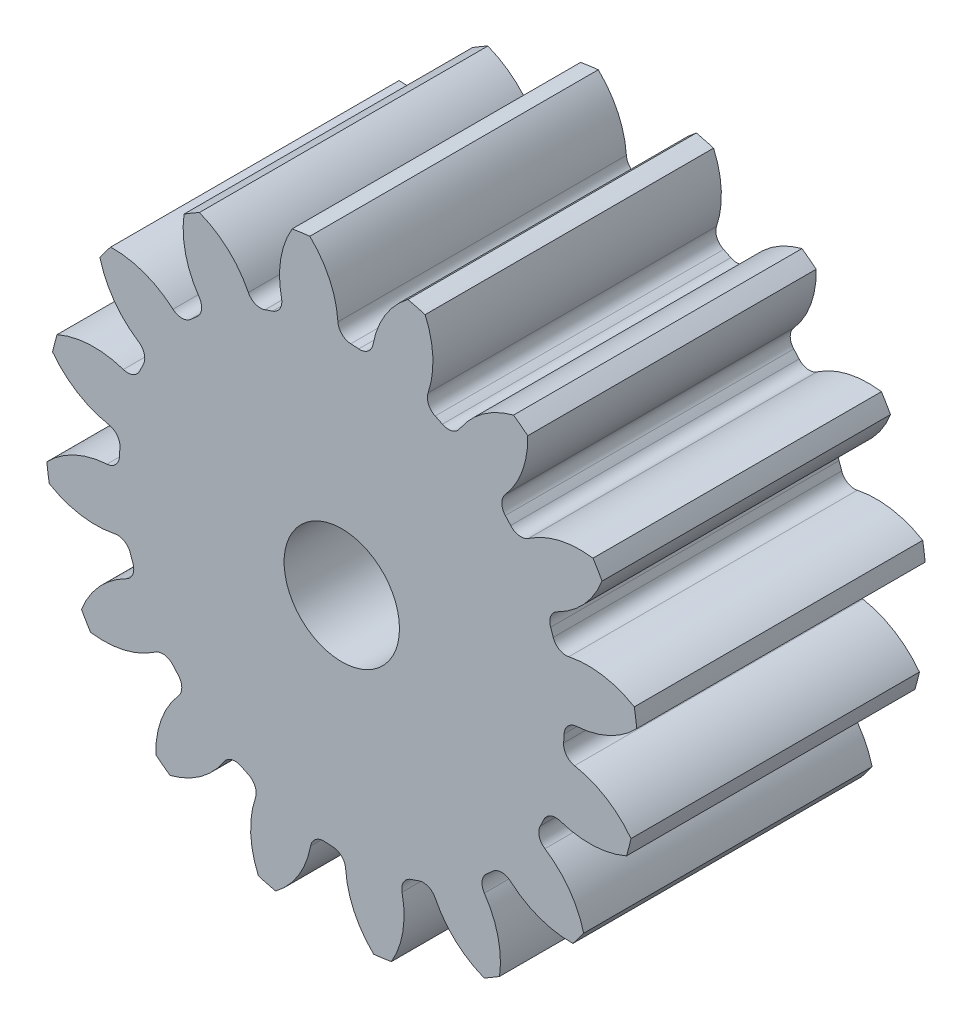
ISO-10303-21;
HEADER;
FILE_DESCRIPTION(('STEP AP214'),'2;1');
FILE_NAME('part.step','',(''),(''),'','','');
FILE_SCHEMA(('AUTOMOTIVE_DESIGN { 1 0 10303 214 1 1 1 1 }'));
ENDSEC;
DATA;
#1=APPLICATION_CONTEXT('core data for automotive mechanical design processes');
#2=APPLICATION_PROTOCOL_DEFINITION('international standard','automotive_design',2000,#1);
#3=PRODUCT_CONTEXT('',#1,'mechanical');
#4=PRODUCT('Part','Part','',(#3));
#5=PRODUCT_RELATED_PRODUCT_CATEGORY('part','',(#4));
#6=PRODUCT_DEFINITION_FORMATION('','',#4);
#7=PRODUCT_DEFINITION_CONTEXT('part definition',#1,'design');
#8=PRODUCT_DEFINITION('design','',#6,#7);
#9=PRODUCT_DEFINITION_SHAPE('','',#8);
#10=(LENGTH_UNIT() NAMED_UNIT(*) SI_UNIT(.MILLI.,.METRE.));
#11=(NAMED_UNIT(*) PLANE_ANGLE_UNIT() SI_UNIT($,.RADIAN.));
#12=(NAMED_UNIT(*) SI_UNIT($,.STERADIAN.) SOLID_ANGLE_UNIT());
#13=UNCERTAINTY_MEASURE_WITH_UNIT(LENGTH_MEASURE(1.E-05),#10,'distance_accuracy_value','');
#14=(GEOMETRIC_REPRESENTATION_CONTEXT(3) GLOBAL_UNCERTAINTY_ASSIGNED_CONTEXT((#13)) GLOBAL_UNIT_ASSIGNED_CONTEXT((#10,
#11,#12)) REPRESENTATION_CONTEXT('',''));
#15=CARTESIAN_POINT('',(0.,0.,0.));
#16=DIRECTION('',(0.,0.,1.));
#17=DIRECTION('',(1.,0.,0.));
#18=AXIS2_PLACEMENT_3D('',#15,#16,#17);
#19=CARTESIAN_POINT('',(0.,0.,88.9));
#20=DIRECTION('',(0.,0.,-1.));
#21=DIRECTION('',(-1.,0.,0.));
#22=AXIS2_PLACEMENT_3D('',#19,#20,#21);
#23=CYLINDRICAL_SURFACE('',#22,91.44);
#24=DIRECTION('',(0.,0.,-1.));
#25=VECTOR('',#24,1.);
#26=CARTESIAN_POINT('',(90.1524607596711,15.2907625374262,44.45));
#27=LINE('',#26,#25);
#28=CARTESIAN_POINT('',(90.1524607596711,15.2907625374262,88.9));
#29=VERTEX_POINT('',#28);
#30=CARTESIAN_POINT('',(90.1524607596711,15.2907625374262,0.));
#31=VERTEX_POINT('',#30);
#32=EDGE_CURVE('E672',#29,#31,#27,.T.);
#33=ORIENTED_EDGE('',*,*,#32,.F.);
#34=CARTESIAN_POINT('',(0.,0.,88.9));
#35=DIRECTION('',(0.,0.,1.));
#36=DIRECTION('',(1.,0.,0.));
#37=AXIS2_PLACEMENT_3D('',#34,#35,#36);
#38=CIRCLE('',#37,91.44);
#39=CARTESIAN_POINT('',(90.9086391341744,9.8434206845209,88.9));
#40=VERTEX_POINT('',#39);
#41=EDGE_CURVE('E1241',#40,#29,#38,.T.);
#42=ORIENTED_EDGE('',*,*,#41,.F.);
#43=DIRECTION('',(0.,0.,-1.));
#44=VECTOR('',#43,1.);
#45=CARTESIAN_POINT('',(90.9086391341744,9.8434206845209,44.45));
#46=LINE('',#45,#44);
#47=CARTESIAN_POINT('',(90.9086391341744,9.8434206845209,0.));
#48=VERTEX_POINT('',#47);
#49=EDGE_CURVE('E1235',#48,#40,#46,.F.);
#50=ORIENTED_EDGE('',*,*,#49,.F.);
#51=CARTESIAN_POINT('',(0.,0.,0.));
#52=DIRECTION('',(0.,0.,1.));
#53=DIRECTION('',(1.,0.,0.));
#54=AXIS2_PLACEMENT_3D('',#51,#52,#53);
#55=CIRCLE('',#54,91.44);
#56=EDGE_CURVE('E1246',#48,#31,#55,.T.);
#57=ORIENTED_EDGE('',*,*,#56,.T.);
#58=EDGE_LOOP('',(#33,#42,#50,#57));
#59=FACE_BOUND('',#58,.T.);
#60=ADVANCED_FACE('F33',(#59),#23,.T.);
#61=DIRECTION('',(0.,0.,-1.));
#62=VECTOR('',#61,1.);
#63=CARTESIAN_POINT('',(80.2217170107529,43.8833649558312,44.45));
#64=LINE('',#63,#62);
#65=CARTESIAN_POINT('',(80.2217170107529,43.8833649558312,0.));
#66=VERTEX_POINT('',#65);
#67=CARTESIAN_POINT('',(80.2217170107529,43.8833649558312,88.9));
#68=VERTEX_POINT('',#67);
#69=EDGE_CURVE('E643',#66,#68,#64,.F.);
#70=ORIENTED_EDGE('',*,*,#69,.F.);
#71=CARTESIAN_POINT('',(77.4384918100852,48.6266756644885,0.));
#72=VERTEX_POINT('',#71);
#73=EDGE_CURVE('E1249',#66,#72,#55,.T.);
#74=ORIENTED_EDGE('',*,*,#73,.T.);
#75=DIRECTION('',(0.,0.,-1.));
#76=VECTOR('',#75,1.);
#77=CARTESIAN_POINT('',(77.4384918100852,48.6266756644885,44.45));
#78=LINE('',#77,#76);
#79=CARTESIAN_POINT('',(77.4384918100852,48.6266756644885,88.9));
#80=VERTEX_POINT('',#79);
#81=EDGE_CURVE('E705',#80,#72,#78,.T.);
#82=ORIENTED_EDGE('',*,*,#81,.F.);
#83=EDGE_CURVE('E1244',#68,#80,#38,.T.);
#84=ORIENTED_EDGE('',*,*,#83,.F.);
#85=EDGE_LOOP('',(#70,#74,#82,#84));
#86=FACE_BOUND('',#85,.T.);
#87=ADVANCED_FACE('F1431',(#86),#23,.T.);
#88=CARTESIAN_POINT('',(0.,0.,88.9));
#89=DIRECTION('',(0.,0.,1.));
#90=DIRECTION('',(1.,0.,0.));
#91=AXIS2_PLACEMENT_3D('',#88,#89,#90);
#92=PLANE('',#91);
#93=CARTESIAN_POINT('',(0.,0.,88.9000000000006));
#94=DIRECTION('',(0.,0.,1.));
#95=DIRECTION('',(1.,0.,0.));
#96=AXIS2_PLACEMENT_3D('',#93,#94,#95);
#97=CIRCLE('',#96,17.78);
#98=CARTESIAN_POINT('',(17.78,0.,88.9000000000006));
#99=VERTEX_POINT('',#98);
#100=EDGE_CURVE('E660',#99,#99,#97,.T.);
#101=ORIENTED_EDGE('',*,*,#100,.F.);
#102=EDGE_LOOP('',(#101));
#103=FACE_BOUND('',#102,.T.);
#104=ORIENTED_EDGE('',*,*,#41,.T.);
#105=CARTESIAN_POINT('',(75.8575562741,-8.90298088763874,88.9));
#106=DIRECTION('',(0.,0.,-1.));
#107=DIRECTION('',(0.923879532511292,0.382683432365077,0.));
#108=AXIS2_PLACEMENT_3D('',#105,#106,#107);
#109=CIRCLE('',#108,28.1012724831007);
#110=CARTESIAN_POINT('',(69.973555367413,18.5753751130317,88.9));
#111=VERTEX_POINT('',#110);
#112=EDGE_CURVE('E652',#111,#29,#109,.T.);
#113=ORIENTED_EDGE('',*,*,#112,.F.);
#114=CARTESIAN_POINT('',(69.1077209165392,22.6188325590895,88.9));
#115=DIRECTION('',(0.,0.,1.));
#116=DIRECTION('',(-0.923879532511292,-0.382683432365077,0.));
#117=AXIS2_PLACEMENT_3D('',#114,#115,#116);
#118=CIRCLE('',#117,4.13511999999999);
#119=CARTESIAN_POINT('',(65.1777443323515,21.3325583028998,88.9));
#120=VERTEX_POINT('',#119);
#121=EDGE_CURVE('E650',#120,#111,#118,.T.);
#122=ORIENTED_EDGE('',*,*,#121,.F.);
#123=CARTESIAN_POINT('',(0.,0.,88.9));
#124=DIRECTION('',(0.,0.,-1.));
#125=DIRECTION('',(0.923879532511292,0.382683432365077,0.));
#126=AXIS2_PLACEMENT_3D('',#123,#124,#125);
#127=CIRCLE('',#126,68.58);
#128=CARTESIAN_POINT('',(64.3688930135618,23.6614034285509,88.9));
#129=VERTEX_POINT('',#128);
#130=EDGE_CURVE('E635',#129,#120,#127,.T.);
#131=ORIENTED_EDGE('',*,*,#130,.F.);
#132=CARTESIAN_POINT('',(68.2500988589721,25.0880984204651,88.9));
#133=DIRECTION('',(0.,0.,1.));
#134=DIRECTION('',(-0.923879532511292,-0.382683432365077,0.));
#135=AXIS2_PLACEMENT_3D('',#132,#133,#134);
#136=CIRCLE('',#135,4.13511999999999);
#137=CARTESIAN_POINT('',(66.4231379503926,28.7977387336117,88.9));
#138=VERTEX_POINT('',#137);
#139=EDGE_CURVE('E627',#138,#129,#136,.T.);
#140=ORIENTED_EDGE('',*,*,#139,.F.);
#141=CARTESIAN_POINT('',(54.0075547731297,54.0075544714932,88.9));
#142=DIRECTION('',(0.,0.,-1.));
#143=DIRECTION('',(-0.923879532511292,-0.382683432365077,0.));
#144=AXIS2_PLACEMENT_3D('',#141,#142,#143);
#145=CIRCLE('',#144,28.1012724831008);
#146=EDGE_CURVE('E657',#68,#138,#145,.T.);
#147=ORIENTED_EDGE('',*,*,#146,.F.);
#148=ORIENTED_EDGE('',*,*,#83,.T.);
#149=CARTESIAN_POINT('',(73.4902669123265,20.804148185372,88.9));
#150=DIRECTION('',(0.,0.,-1.));
#151=DIRECTION('',(0.707106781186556,0.707106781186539,0.));
#152=AXIS2_PLACEMENT_3D('',#149,#150,#151);
#153=CIRCLE('',#152,28.1012724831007);
#154=CARTESIAN_POINT('',(57.5386473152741,43.9391292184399,88.9));
#155=VERTEX_POINT('',#154);
#156=EDGE_CURVE('E681',#155,#80,#153,.T.);
#157=ORIENTED_EDGE('',*,*,#156,.F.);
#158=CARTESIAN_POINT('',(55.1913564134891,47.3434562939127,88.9));
#159=DIRECTION('',(0.,0.,1.));
#160=DIRECTION('',(-0.707106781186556,-0.707106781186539,0.));
#161=AXIS2_PLACEMENT_3D('',#158,#159,#160);
#162=CIRCLE('',#161,4.13511999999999);
#163=CARTESIAN_POINT('',(52.0527673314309,44.6511569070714,88.9));
#164=VERTEX_POINT('',#163);
#165=EDGE_CURVE('E679',#164,#155,#162,.T.);
#166=ORIENTED_EDGE('',*,*,#165,.F.);
#167=CARTESIAN_POINT('',(0.,0.,88.9));
#168=DIRECTION('',(0.,0.,-1.));
#169=DIRECTION('',(0.707106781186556,0.707106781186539,0.));
#170=AXIS2_PLACEMENT_3D('',#167,#168,#169);
#171=CIRCLE('',#170,68.58);
#172=CARTESIAN_POINT('',(50.4142757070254,46.4931952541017,88.9));
#173=VERTEX_POINT('',#172);
#174=EDGE_CURVE('E676',#173,#164,#171,.T.);
#175=ORIENTED_EDGE('',*,*,#174,.F.);
#176=CARTESIAN_POINT('',(53.4540698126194,49.2965627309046,88.9));
#177=DIRECTION('',(0.,0.,1.));
#178=DIRECTION('',(-0.707106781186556,-0.707106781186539,0.));
#179=AXIS2_PLACEMENT_3D('',#176,#177,#178);
#180=CIRCLE('',#179,4.13511999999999);
#181=CARTESIAN_POINT('',(50.3465601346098,52.0246758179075,88.9));
#182=VERTEX_POINT('',#181);
#183=EDGE_CURVE('E674',#182,#173,#180,.T.);
#184=ORIENTED_EDGE('',*,*,#183,.F.);
#185=CARTESIAN_POINT('',(29.2286781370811,70.5642706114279,88.9));
#186=DIRECTION('',(0.,0.,-1.));
#187=DIRECTION('',(-0.707106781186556,-0.707106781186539,0.));
#188=AXIS2_PLACEMENT_3D('',#185,#186,#187);
#189=CIRCLE('',#188,28.1012724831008);
#190=CARTESIAN_POINT('',(57.3217656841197,71.2424647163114,88.9));
#191=VERTEX_POINT('',#190);
#192=EDGE_CURVE('E684',#191,#182,#189,.T.);
#193=ORIENTED_EDGE('',*,*,#192,.F.);
#194=CARTESIAN_POINT('',(52.9352144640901,74.559618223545,88.9));
#195=VERTEX_POINT('',#194);
#196=EDGE_CURVE('E1289',#191,#195,#38,.T.);
#197=ORIENTED_EDGE('',*,*,#196,.T.);
#198=CARTESIAN_POINT('',(59.9347506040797,47.3440342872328,88.9));
#199=DIRECTION('',(0.,0.,-1.));
#200=DIRECTION('',(0.3826834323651,0.923879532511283,0.));
#201=AXIS2_PLACEMENT_3D('',#198,#199,#200);
#202=CIRCLE('',#201,28.1012724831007);
#203=CARTESIAN_POINT('',(36.3440017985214,62.6135492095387,88.9));
#204=VERTEX_POINT('',#203);
#205=EDGE_CURVE('E716',#204,#195,#202,.T.);
#206=ORIENTED_EDGE('',*,*,#205,.F.);
#207=CARTESIAN_POINT('',(32.8726082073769,64.8604679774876,88.9));
#208=DIRECTION('',(0.,0.,1.));
#209=DIRECTION('',(-0.3826834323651,-0.923879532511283,0.));
#210=AXIS2_PLACEMENT_3D('',#207,#208,#209);
#211=CIRCLE('',#210,4.13511999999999);
#212=CARTESIAN_POINT('',(31.0032283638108,61.1720216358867,88.9));
#213=VERTEX_POINT('',#212);
#214=EDGE_CURVE('E714',#213,#204,#211,.T.);
#215=ORIENTED_EDGE('',*,*,#214,.F.);
#216=CARTESIAN_POINT('',(0.,0.,88.9));
#217=DIRECTION('',(0.,0.,-1.));
#218=DIRECTION('',(0.3826834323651,0.923879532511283,0.));
#219=AXIS2_PLACEMENT_3D('',#216,#217,#218);
#220=CIRCLE('',#219,68.58);
#221=CARTESIAN_POINT('',(28.7845419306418,62.24681956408,88.9));
#222=VERTEX_POINT('',#221);
#223=EDGE_CURVE('E711',#222,#213,#220,.T.);
#224=ORIENTED_EDGE('',*,*,#223,.F.);
#225=CARTESIAN_POINT('',(30.5201431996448,66.0000722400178,88.9));
#226=DIRECTION('',(0.,0.,1.));
#227=DIRECTION('',(-0.3826834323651,-0.923879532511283,0.));
#228=AXIS2_PLACEMENT_3D('',#225,#226,#227);
#229=CIRCLE('',#228,4.13511999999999);
#230=CARTESIAN_POINT('',(26.6051749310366,67.3313276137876,88.9));
#231=VERTEX_POINT('',#230);
#232=EDGE_CURVE('E709',#231,#222,#229,.T.);
#233=ORIENTED_EDGE('',*,*,#232,.F.);
#234=CARTESIAN_POINT('',(2.13288955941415E-07,76.3782162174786,88.9));
#235=DIRECTION('',(0.,0.,-1.));
#236=DIRECTION('',(-0.3826834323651,-0.923879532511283,0.));
#237=AXIS2_PLACEMENT_3D('',#234,#235,#236);
#238=CIRCLE('',#237,28.1012724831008);
#239=CARTESIAN_POINT('',(25.695095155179,87.755545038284,88.9));
#240=VERTEX_POINT('',#239);
#241=EDGE_CURVE('E719',#240,#231,#238,.T.);
#242=ORIENTED_EDGE('',*,*,#241,.F.);
#243=CARTESIAN_POINT('',(20.3730305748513,89.1415347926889,88.9));
#244=VERTEX_POINT('',#243);
#245=EDGE_CURVE('E1413',#240,#244,#38,.T.);
#246=ORIENTED_EDGE('',*,*,#245,.T.);
#247=CARTESIAN_POINT('',(37.2547118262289,66.6762203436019,88.9));
#248=DIRECTION('',(0.,0.,-1.));
#249=DIRECTION('',(0.,1.,0.));
#250=AXIS2_PLACEMENT_3D('',#247,#248,#249);
#251=CIRCLE('',#250,28.1012724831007);
#252=CARTESIAN_POINT('',(9.61631146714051,71.7556239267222,88.9));
#253=VERTEX_POINT('',#252);
#254=EDGE_CURVE('E754',#253,#244,#251,.T.);
#255=ORIENTED_EDGE('',*,*,#254,.F.);
#256=CARTESIAN_POINT('',(5.54930339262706,72.5030613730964,88.9));
#257=DIRECTION('',(0.,0.,1.));
#258=DIRECTION('',(0.,-1.,0.));
#259=AXIS2_PLACEMENT_3D('',#256,#257,#258);
#260=CIRCLE('',#259,4.13511999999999);
#261=CARTESIAN_POINT('',(5.23372892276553,68.3800005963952,88.9));
#262=VERTEX_POINT('',#261);
#263=EDGE_CURVE('E752',#262,#253,#260,.T.);
#264=ORIENTED_EDGE('',*,*,#263,.F.);
#265=CARTESIAN_POINT('',(0.,0.,88.9));
#266=DIRECTION('',(0.,0.,-1.));
#267=DIRECTION('',(0.,1.,0.));
#268=AXIS2_PLACEMENT_3D('',#265,#266,#267);
#269=CIRCLE('',#268,68.58);
#270=CARTESIAN_POINT('',(2.77262257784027,68.5239298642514,88.9));
#271=VERTEX_POINT('',#270);
#272=EDGE_CURVE('E749',#271,#262,#269,.T.);
#273=ORIENTED_EDGE('',*,*,#272,.F.);
#274=CARTESIAN_POINT('',(2.93980145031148,72.655669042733,88.9));
#275=DIRECTION('',(0.,0.,1.));
#276=DIRECTION('',(0.,-1.,0.));
#277=AXIS2_PLACEMENT_3D('',#274,#275,#276);
#278=CIRCLE('',#277,4.13511999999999);
#279=CARTESIAN_POINT('',(-1.18660697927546,72.3873951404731,88.9));
#280=VERTEX_POINT('',#279);
#281=EDGE_CURVE('E747',#280,#271,#278,.T.);
#282=ORIENTED_EDGE('',*,*,#281,.F.);
#283=CARTESIAN_POINT('',(-29.2286777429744,70.5642707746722,88.9));
#284=DIRECTION('',(0.,0.,-1.));
#285=DIRECTION('',(0.,-1.,0.));
#286=AXIS2_PLACEMENT_3D('',#283,#284,#285);
#287=CIRCLE('',#286,28.1012724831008);
#288=CARTESIAN_POINT('',(-9.84342068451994,90.9086391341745,88.9));
#289=VERTEX_POINT('',#288);
#290=EDGE_CURVE('E757',#289,#280,#287,.T.);
#291=ORIENTED_EDGE('',*,*,#290,.F.);
#292=CARTESIAN_POINT('',(-15.2907625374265,90.1524607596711,88.9));
#293=VERTEX_POINT('',#292);
#294=EDGE_CURVE('E1409',#289,#293,#38,.T.);
#295=ORIENTED_EDGE('',*,*,#294,.T.);
#296=CARTESIAN_POINT('',(8.90298088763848,75.8575562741,88.9));
#297=DIRECTION('',(0.,0.,-1.));
#298=DIRECTION('',(-0.382683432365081,0.923879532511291,0.));
#299=AXIS2_PLACEMENT_3D('',#296,#297,#298);
#300=CIRCLE('',#299,28.1012724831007);
#301=CARTESIAN_POINT('',(-18.5753751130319,69.9735553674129,88.9));
#302=VERTEX_POINT('',#301);
#303=EDGE_CURVE('E792',#302,#293,#300,.T.);
#304=ORIENTED_EDGE('',*,*,#303,.F.);
#305=CARTESIAN_POINT('',(-22.6188325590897,69.1077209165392,88.9));
#306=DIRECTION('',(0.,0.,1.));
#307=DIRECTION('',(0.382683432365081,-0.923879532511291,0.));
#308=AXIS2_PLACEMENT_3D('',#305,#306,#307);
#309=CIRCLE('',#308,4.13511999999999);
#310=CARTESIAN_POINT('',(-21.3325583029,65.1777443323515,88.9));
#311=VERTEX_POINT('',#310);
#312=EDGE_CURVE('E790',#311,#302,#309,.T.);
#313=ORIENTED_EDGE('',*,*,#312,.F.);
#314=CARTESIAN_POINT('',(0.,0.,88.9));
#315=DIRECTION('',(0.,0.,-1.));
#316=DIRECTION('',(-0.382683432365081,0.923879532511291,0.));
#317=AXIS2_PLACEMENT_3D('',#314,#315,#316);
#318=CIRCLE('',#317,68.58);
#319=CARTESIAN_POINT('',(-23.6614034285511,64.3688930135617,88.9));
#320=VERTEX_POINT('',#319);
#321=EDGE_CURVE('E787',#320,#311,#318,.T.);
#322=ORIENTED_EDGE('',*,*,#321,.F.);
#323=CARTESIAN_POINT('',(-25.0880984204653,68.250098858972,88.9));
#324=DIRECTION('',(0.,0.,1.));
#325=DIRECTION('',(0.382683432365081,-0.923879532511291,0.));
#326=AXIS2_PLACEMENT_3D('',#323,#324,#325);
#327=CIRCLE('',#326,4.13511999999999);
#328=CARTESIAN_POINT('',(-28.7977387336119,66.4231379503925,88.9));
#329=VERTEX_POINT('',#328);
#330=EDGE_CURVE('E785',#329,#320,#327,.T.);
#331=ORIENTED_EDGE('',*,*,#330,.F.);
#332=CARTESIAN_POINT('',(-54.0075544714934,54.0075547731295,88.9));
#333=DIRECTION('',(0.,0.,-1.));
#334=DIRECTION('',(0.382683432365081,-0.923879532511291,0.));
#335=AXIS2_PLACEMENT_3D('',#332,#333,#334);
#336=CIRCLE('',#335,28.1012724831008);
#337=CARTESIAN_POINT('',(-43.8833649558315,80.2217170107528,88.9));
#338=VERTEX_POINT('',#337);
#339=EDGE_CURVE('E795',#338,#329,#336,.T.);
#340=ORIENTED_EDGE('',*,*,#339,.F.);
#341=CARTESIAN_POINT('',(-48.6266756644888,77.4384918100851,88.9));
#342=VERTEX_POINT('',#341);
#343=EDGE_CURVE('E1405',#338,#342,#38,.T.);
#344=ORIENTED_EDGE('',*,*,#343,.T.);
#345=CARTESIAN_POINT('',(-20.8041481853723,73.4902669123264,88.9));
#346=DIRECTION('',(0.,0.,-1.));
#347=DIRECTION('',(-0.707106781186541,0.707106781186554,0.));
#348=AXIS2_PLACEMENT_3D('',#345,#346,#347);
#349=CIRCLE('',#348,28.1012724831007);
#350=CARTESIAN_POINT('',(-43.9391292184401,57.5386473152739,88.9));
#351=VERTEX_POINT('',#350);
#352=EDGE_CURVE('E830',#351,#342,#349,.T.);
#353=ORIENTED_EDGE('',*,*,#352,.F.);
#354=CARTESIAN_POINT('',(-47.3434562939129,55.1913564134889,88.9));
#355=DIRECTION('',(0.,0.,1.));
#356=DIRECTION('',(0.707106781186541,-0.707106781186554,0.));
#357=AXIS2_PLACEMENT_3D('',#354,#355,#356);
#358=CIRCLE('',#357,4.13511999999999);
#359=CARTESIAN_POINT('',(-44.6511569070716,52.0527673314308,88.9));
#360=VERTEX_POINT('',#359);
#361=EDGE_CURVE('E828',#360,#351,#358,.T.);
#362=ORIENTED_EDGE('',*,*,#361,.F.);
#363=CARTESIAN_POINT('',(0.,0.,88.9));
#364=DIRECTION('',(0.,0.,-1.));
#365=DIRECTION('',(-0.707106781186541,0.707106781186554,0.));
#366=AXIS2_PLACEMENT_3D('',#363,#364,#365);
#367=CIRCLE('',#366,68.58);
#368=CARTESIAN_POINT('',(-46.4931952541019,50.4142757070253,88.9));
#369=VERTEX_POINT('',#368);
#370=EDGE_CURVE('E825',#369,#360,#367,.T.);
#371=ORIENTED_EDGE('',*,*,#370,.F.);
#372=CARTESIAN_POINT('',(-49.2965627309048,53.4540698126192,88.9));
#373=DIRECTION('',(0.,0.,1.));
#374=DIRECTION('',(0.707106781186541,-0.707106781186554,0.));
#375=AXIS2_PLACEMENT_3D('',#372,#373,#374);
#376=CIRCLE('',#375,4.13511999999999);
#377=CARTESIAN_POINT('',(-52.0246758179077,50.3465601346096,88.9));
#378=VERTEX_POINT('',#377);
#379=EDGE_CURVE('E823',#378,#369,#376,.T.);
#380=ORIENTED_EDGE('',*,*,#379,.F.);
#381=CARTESIAN_POINT('',(-70.564270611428,29.2286781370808,88.9));
#382=DIRECTION('',(0.,0.,-1.));
#383=DIRECTION('',(0.707106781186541,-0.707106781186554,0.));
#384=AXIS2_PLACEMENT_3D('',#381,#382,#383);
#385=CIRCLE('',#384,28.1012724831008);
#386=CARTESIAN_POINT('',(-71.2424647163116,57.3217656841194,88.9));
#387=VERTEX_POINT('',#386);
#388=EDGE_CURVE('E833',#387,#378,#385,.T.);
#389=ORIENTED_EDGE('',*,*,#388,.F.);
#390=CARTESIAN_POINT('',(-74.5596182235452,52.9352144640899,88.9));
#391=VERTEX_POINT('',#390);
#392=EDGE_CURVE('E1401',#387,#391,#38,.T.);
#393=ORIENTED_EDGE('',*,*,#392,.T.);
#394=CARTESIAN_POINT('',(-47.344034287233,59.9347506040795,88.9));
#395=DIRECTION('',(0.,0.,-1.));
#396=DIRECTION('',(-0.923879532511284,0.382683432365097,0.));
#397=AXIS2_PLACEMENT_3D('',#394,#395,#396);
#398=CIRCLE('',#397,28.1012724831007);
#399=CARTESIAN_POINT('',(-62.6135492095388,36.3440017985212,88.9));
#400=VERTEX_POINT('',#399);
#401=EDGE_CURVE('E868',#400,#391,#398,.T.);
#402=ORIENTED_EDGE('',*,*,#401,.F.);
#403=CARTESIAN_POINT('',(-64.8604679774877,32.8726082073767,88.9));
#404=DIRECTION('',(0.,0.,1.));
#405=DIRECTION('',(0.923879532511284,-0.382683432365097,0.));
#406=AXIS2_PLACEMENT_3D('',#403,#404,#405);
#407=CIRCLE('',#406,4.13511999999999);
#408=CARTESIAN_POINT('',(-61.1720216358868,31.0032283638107,88.9));
#409=VERTEX_POINT('',#408);
#410=EDGE_CURVE('E866',#409,#400,#407,.T.);
#411=ORIENTED_EDGE('',*,*,#410,.F.);
#412=CARTESIAN_POINT('',(0.,0.,88.9));
#413=DIRECTION('',(0.,0.,-1.));
#414=DIRECTION('',(-0.923879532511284,0.382683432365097,0.));
#415=AXIS2_PLACEMENT_3D('',#412,#413,#414);
#416=CIRCLE('',#415,68.58);
#417=CARTESIAN_POINT('',(-62.24681956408,28.7845419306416,88.9));
#418=VERTEX_POINT('',#417);
#419=EDGE_CURVE('E863',#418,#409,#416,.T.);
#420=ORIENTED_EDGE('',*,*,#419,.F.);
#421=CARTESIAN_POINT('',(-66.0000722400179,30.5201431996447,88.9));
#422=DIRECTION('',(0.,0.,1.));
#423=DIRECTION('',(0.923879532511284,-0.382683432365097,0.));
#424=AXIS2_PLACEMENT_3D('',#421,#422,#423);
#425=CIRCLE('',#424,4.13511999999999);
#426=CARTESIAN_POINT('',(-67.3313276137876,26.6051749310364,88.9));
#427=VERTEX_POINT('',#426);
#428=EDGE_CURVE('E861',#427,#418,#425,.T.);
#429=ORIENTED_EDGE('',*,*,#428,.F.);
#430=CARTESIAN_POINT('',(-76.3782162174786,2.1328872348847E-07,88.9));
#431=DIRECTION('',(0.,0.,-1.));
#432=DIRECTION('',(0.923879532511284,-0.382683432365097,0.));
#433=AXIS2_PLACEMENT_3D('',#430,#431,#432);
#434=CIRCLE('',#433,28.1012724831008);
#435=CARTESIAN_POINT('',(-87.7555450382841,25.6950951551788,88.9));
#436=VERTEX_POINT('',#435);
#437=EDGE_CURVE('E871',#436,#427,#434,.T.);
#438=ORIENTED_EDGE('',*,*,#437,.F.);
#439=CARTESIAN_POINT('',(-89.141534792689,20.373030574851,88.9));
#440=VERTEX_POINT('',#439);
#441=EDGE_CURVE('E1397',#436,#440,#38,.T.);
#442=ORIENTED_EDGE('',*,*,#441,.T.);
#443=CARTESIAN_POINT('',(-66.676220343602,37.2547118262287,88.9));
#444=DIRECTION('',(0.,0.,-1.));
#445=DIRECTION('',(-1.,0.,0.));
#446=AXIS2_PLACEMENT_3D('',#443,#444,#445);
#447=CIRCLE('',#446,28.1012724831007);
#448=CARTESIAN_POINT('',(-71.7556239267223,9.61631146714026,88.9));
#449=VERTEX_POINT('',#448);
#450=EDGE_CURVE('E906',#449,#440,#447,.T.);
#451=ORIENTED_EDGE('',*,*,#450,.F.);
#452=CARTESIAN_POINT('',(-72.5030613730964,5.5493033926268,88.9));
#453=DIRECTION('',(0.,0.,1.));
#454=DIRECTION('',(1.,0.,0.));
#455=AXIS2_PLACEMENT_3D('',#452,#453,#454);
#456=CIRCLE('',#455,4.13511999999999);
#457=CARTESIAN_POINT('',(-68.3800005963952,5.23372892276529,88.9));
#458=VERTEX_POINT('',#457);
#459=EDGE_CURVE('E904',#458,#449,#456,.T.);
#460=ORIENTED_EDGE('',*,*,#459,.F.);
#461=CARTESIAN_POINT('',(0.,0.,88.9));
#462=DIRECTION('',(0.,0.,-1.));
#463=DIRECTION('',(-1.,0.,0.));
#464=AXIS2_PLACEMENT_3D('',#461,#462,#463);
#465=CIRCLE('',#464,68.58);
#466=CARTESIAN_POINT('',(-68.5239298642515,2.77262257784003,88.9));
#467=VERTEX_POINT('',#466);
#468=EDGE_CURVE('E901',#467,#458,#465,.T.);
#469=ORIENTED_EDGE('',*,*,#468,.F.);
#470=CARTESIAN_POINT('',(-72.655669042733,2.93980145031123,88.9));
#471=DIRECTION('',(0.,0.,1.));
#472=DIRECTION('',(1.,0.,0.));
#473=AXIS2_PLACEMENT_3D('',#470,#471,#472);
#474=CIRCLE('',#473,4.13511999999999);
#475=CARTESIAN_POINT('',(-72.3873951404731,-1.18660697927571,88.9));
#476=VERTEX_POINT('',#475);
#477=EDGE_CURVE('E899',#476,#467,#474,.T.);
#478=ORIENTED_EDGE('',*,*,#477,.F.);
#479=CARTESIAN_POINT('',(-70.5642707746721,-29.2286777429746,88.9));
#480=DIRECTION('',(0.,0.,-1.));
#481=DIRECTION('',(1.,0.,0.));
#482=AXIS2_PLACEMENT_3D('',#479,#480,#481);
#483=CIRCLE('',#482,28.1012724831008);
#484=CARTESIAN_POINT('',(-90.9086391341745,-9.84342068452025,88.9));
#485=VERTEX_POINT('',#484);
#486=EDGE_CURVE('E909',#485,#476,#483,.T.);
#487=ORIENTED_EDGE('',*,*,#486,.F.);
#488=CARTESIAN_POINT('',(-90.152460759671,-15.2907625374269,88.9));
#489=VERTEX_POINT('',#488);
#490=EDGE_CURVE('E1393',#485,#489,#38,.T.);
#491=ORIENTED_EDGE('',*,*,#490,.T.);
#492=CARTESIAN_POINT('',(-75.8575562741,8.90298088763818,88.9));
#493=DIRECTION('',(0.,0.,-1.));
#494=DIRECTION('',(-0.923879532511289,-0.382683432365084,0.));
#495=AXIS2_PLACEMENT_3D('',#492,#493,#494);
#496=CIRCLE('',#495,28.1012724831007);
#497=CARTESIAN_POINT('',(-69.9735553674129,-18.5753751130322,88.9));
#498=VERTEX_POINT('',#497);
#499=EDGE_CURVE('E944',#498,#489,#496,.T.);
#500=ORIENTED_EDGE('',*,*,#499,.F.);
#501=CARTESIAN_POINT('',(-69.1077209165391,-22.61883255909,88.9));
#502=DIRECTION('',(0.,0.,1.));
#503=DIRECTION('',(0.923879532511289,0.382683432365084,0.));
#504=AXIS2_PLACEMENT_3D('',#501,#502,#503);
#505=CIRCLE('',#504,4.13511999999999);
#506=CARTESIAN_POINT('',(-65.1777443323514,-21.3325583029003,88.9));
#507=VERTEX_POINT('',#506);
#508=EDGE_CURVE('E942',#507,#498,#505,.T.);
#509=ORIENTED_EDGE('',*,*,#508,.F.);
#510=CARTESIAN_POINT('',(0.,0.,88.9));
#511=DIRECTION('',(0.,0.,-1.));
#512=DIRECTION('',(-0.923879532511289,-0.382683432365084,0.));
#513=AXIS2_PLACEMENT_3D('',#510,#511,#512);
#514=CIRCLE('',#513,68.58);
#515=CARTESIAN_POINT('',(-64.3688930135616,-23.6614034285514,88.9));
#516=VERTEX_POINT('',#515);
#517=EDGE_CURVE('E939',#516,#507,#514,.T.);
#518=ORIENTED_EDGE('',*,*,#517,.F.);
#519=CARTESIAN_POINT('',(-68.2500988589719,-25.0880984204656,88.9));
#520=DIRECTION('',(0.,0.,1.));
#521=DIRECTION('',(0.923879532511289,0.382683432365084,0.));
#522=AXIS2_PLACEMENT_3D('',#519,#520,#521);
#523=CIRCLE('',#522,4.13511999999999);
#524=CARTESIAN_POINT('',(-66.4231379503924,-28.7977387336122,88.9));
#525=VERTEX_POINT('',#524);
#526=EDGE_CURVE('E937',#525,#516,#523,.T.);
#527=ORIENTED_EDGE('',*,*,#526,.F.);
#528=CARTESIAN_POINT('',(-54.0075547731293,-54.0075544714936,88.9));
#529=DIRECTION('',(0.,0.,-1.));
#530=DIRECTION('',(0.923879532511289,0.382683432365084,0.));
#531=AXIS2_PLACEMENT_3D('',#528,#529,#530);
#532=CIRCLE('',#531,28.1012724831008);
#533=CARTESIAN_POINT('',(-80.2217170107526,-43.8833649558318,88.9));
#534=VERTEX_POINT('',#533);
#535=EDGE_CURVE('E947',#534,#525,#532,.T.);
#536=ORIENTED_EDGE('',*,*,#535,.F.);
#537=CARTESIAN_POINT('',(-77.4384918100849,-48.6266756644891,88.9));
#538=VERTEX_POINT('',#537);
#539=EDGE_CURVE('E1389',#534,#538,#38,.T.);
#540=ORIENTED_EDGE('',*,*,#539,.T.);
#541=CARTESIAN_POINT('',(-73.4902669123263,-20.8041481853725,88.9));
#542=DIRECTION('',(0.,0.,-1.));
#543=DIRECTION('',(-0.707106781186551,-0.707106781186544,0.));
#544=AXIS2_PLACEMENT_3D('',#541,#542,#543);
#545=CIRCLE('',#544,28.1012724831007);
#546=CARTESIAN_POINT('',(-57.5386473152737,-43.9391292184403,88.9));
#547=VERTEX_POINT('',#546);
#548=EDGE_CURVE('E982',#547,#538,#545,.T.);
#549=ORIENTED_EDGE('',*,*,#548,.F.);
#550=CARTESIAN_POINT('',(-55.1913564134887,-47.3434562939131,88.9));
#551=DIRECTION('',(0.,0.,1.));
#552=DIRECTION('',(0.707106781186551,0.707106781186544,0.));
#553=AXIS2_PLACEMENT_3D('',#550,#551,#552);
#554=CIRCLE('',#553,4.13511999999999);
#555=CARTESIAN_POINT('',(-52.0527673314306,-44.6511569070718,88.9));
#556=VERTEX_POINT('',#555);
#557=EDGE_CURVE('E980',#556,#547,#554,.T.);
#558=ORIENTED_EDGE('',*,*,#557,.F.);
#559=CARTESIAN_POINT('',(0.,0.,88.9));
#560=DIRECTION('',(0.,0.,-1.));
#561=DIRECTION('',(-0.707106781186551,-0.707106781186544,0.));
#562=AXIS2_PLACEMENT_3D('',#559,#560,#561);
#563=CIRCLE('',#562,68.58);
#564=CARTESIAN_POINT('',(-50.4142757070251,-46.4931952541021,88.9));
#565=VERTEX_POINT('',#564);
#566=EDGE_CURVE('E977',#565,#556,#563,.T.);
#567=ORIENTED_EDGE('',*,*,#566,.F.);
#568=CARTESIAN_POINT('',(-53.454069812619,-49.296562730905,88.9));
#569=DIRECTION('',(0.,0.,1.));
#570=DIRECTION('',(0.707106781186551,0.707106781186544,0.));
#571=AXIS2_PLACEMENT_3D('',#568,#569,#570);
#572=CIRCLE('',#571,4.13511999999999);
#573=CARTESIAN_POINT('',(-50.3465601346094,-52.0246758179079,88.9));
#574=VERTEX_POINT('',#573);
#575=EDGE_CURVE('E975',#574,#565,#572,.T.);
#576=ORIENTED_EDGE('',*,*,#575,.F.);
#577=CARTESIAN_POINT('',(-29.2286781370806,-70.5642706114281,88.9));
#578=DIRECTION('',(0.,0.,-1.));
#579=DIRECTION('',(0.707106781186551,0.707106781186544,0.));
#580=AXIS2_PLACEMENT_3D('',#577,#578,#579);
#581=CIRCLE('',#580,28.1012724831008);
#582=CARTESIAN_POINT('',(-57.3217656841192,-71.2424647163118,88.9));
#583=VERTEX_POINT('',#582);
#584=EDGE_CURVE('E985',#583,#574,#581,.T.);
#585=ORIENTED_EDGE('',*,*,#584,.F.);
#586=CARTESIAN_POINT('',(-52.9352144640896,-74.5596182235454,88.9));
#587=VERTEX_POINT('',#586);
#588=EDGE_CURVE('E1385',#583,#587,#38,.T.);
#589=ORIENTED_EDGE('',*,*,#588,.T.);
#590=CARTESIAN_POINT('',(-59.9347506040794,-47.3440342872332,88.9));
#591=DIRECTION('',(0.,0.,-1.));
#592=DIRECTION('',(-0.382683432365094,-0.923879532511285,0.));
#593=AXIS2_PLACEMENT_3D('',#590,#591,#592);
#594=CIRCLE('',#593,28.1012724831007);
#595=CARTESIAN_POINT('',(-36.3440017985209,-62.613549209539,88.9));
#596=VERTEX_POINT('',#595);
#597=EDGE_CURVE('E1020',#596,#587,#594,.T.);
#598=ORIENTED_EDGE('',*,*,#597,.F.);
#599=CARTESIAN_POINT('',(-32.8726082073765,-64.8604679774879,88.9));
#600=DIRECTION('',(0.,0.,1.));
#601=DIRECTION('',(0.382683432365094,0.923879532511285,0.));
#602=AXIS2_PLACEMENT_3D('',#599,#600,#601);
#603=CIRCLE('',#602,4.13511999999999);
#604=CARTESIAN_POINT('',(-31.0032283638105,-61.1720216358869,88.9));
#605=VERTEX_POINT('',#604);
#606=EDGE_CURVE('E1018',#605,#596,#603,.T.);
#607=ORIENTED_EDGE('',*,*,#606,.F.);
#608=CARTESIAN_POINT('',(0.,0.,88.9));
#609=DIRECTION('',(0.,0.,-1.));
#610=DIRECTION('',(-0.382683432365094,-0.923879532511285,0.));
#611=AXIS2_PLACEMENT_3D('',#608,#609,#610);
#612=CIRCLE('',#611,68.58);
#613=CARTESIAN_POINT('',(-28.7845419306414,-62.2468195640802,88.9));
#614=VERTEX_POINT('',#613);
#615=EDGE_CURVE('E1015',#614,#605,#612,.T.);
#616=ORIENTED_EDGE('',*,*,#615,.F.);
#617=CARTESIAN_POINT('',(-30.5201431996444,-66.000072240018,88.9));
#618=DIRECTION('',(0.,0.,1.));
#619=DIRECTION('',(0.382683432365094,0.923879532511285,0.));
#620=AXIS2_PLACEMENT_3D('',#617,#618,#619);
#621=CIRCLE('',#620,4.13511999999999);
#622=CARTESIAN_POINT('',(-26.6051749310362,-67.3313276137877,88.9));
#623=VERTEX_POINT('',#622);
#624=EDGE_CURVE('E1013',#623,#614,#621,.T.);
#625=ORIENTED_EDGE('',*,*,#624,.F.);
#626=CARTESIAN_POINT('',(-2.13288456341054E-07,-76.3782162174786,88.9));
#627=DIRECTION('',(0.,0.,-1.));
#628=DIRECTION('',(0.382683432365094,0.923879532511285,0.));
#629=AXIS2_PLACEMENT_3D('',#626,#627,#628);
#630=CIRCLE('',#629,28.1012724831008);
#631=CARTESIAN_POINT('',(-25.6950951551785,-87.7555450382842,88.9));
#632=VERTEX_POINT('',#631);
#633=EDGE_CURVE('E1023',#632,#623,#630,.T.);
#634=ORIENTED_EDGE('',*,*,#633,.F.);
#635=CARTESIAN_POINT('',(-20.3730305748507,-89.1415347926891,88.9));
#636=VERTEX_POINT('',#635);
#637=EDGE_CURVE('E1381',#632,#636,#38,.T.);
#638=ORIENTED_EDGE('',*,*,#637,.T.);
#639=CARTESIAN_POINT('',(-37.2547118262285,-66.6762203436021,88.9));
#640=DIRECTION('',(0.,0.,-1.));
#641=DIRECTION('',(0.,-1.,0.));
#642=AXIS2_PLACEMENT_3D('',#639,#640,#641);
#643=CIRCLE('',#642,28.1012724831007);
#644=CARTESIAN_POINT('',(-9.61631146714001,-71.7556239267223,88.9));
#645=VERTEX_POINT('',#644);
#646=EDGE_CURVE('E1058',#645,#636,#643,.T.);
#647=ORIENTED_EDGE('',*,*,#646,.F.);
#648=CARTESIAN_POINT('',(-5.54930339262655,-72.5030613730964,88.9));
#649=DIRECTION('',(0.,0.,1.));
#650=DIRECTION('',(0.,1.,0.));
#651=AXIS2_PLACEMENT_3D('',#648,#649,#650);
#652=CIRCLE('',#651,4.13511999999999);
#653=CARTESIAN_POINT('',(-5.23372892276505,-68.3800005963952,88.9));
#654=VERTEX_POINT('',#653);
#655=EDGE_CURVE('E1056',#654,#645,#652,.T.);
#656=ORIENTED_EDGE('',*,*,#655,.F.);
#657=CARTESIAN_POINT('',(0.,0.,88.9));
#658=DIRECTION('',(0.,0.,-1.));
#659=DIRECTION('',(0.,-1.,0.));
#660=AXIS2_PLACEMENT_3D('',#657,#658,#659);
#661=CIRCLE('',#660,68.58);
#662=CARTESIAN_POINT('',(-2.77262257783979,-68.5239298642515,88.9));
#663=VERTEX_POINT('',#662);
#664=EDGE_CURVE('E1053',#663,#654,#661,.T.);
#665=ORIENTED_EDGE('',*,*,#664,.F.);
#666=CARTESIAN_POINT('',(-2.93980145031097,-72.655669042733,88.9));
#667=DIRECTION('',(0.,0.,1.));
#668=DIRECTION('',(0.,1.,0.));
#669=AXIS2_PLACEMENT_3D('',#666,#667,#668);
#670=CIRCLE('',#669,4.13511999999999);
#671=CARTESIAN_POINT('',(1.18660697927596,-72.3873951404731,88.9));
#672=VERTEX_POINT('',#671);
#673=EDGE_CURVE('E1051',#672,#663,#670,.T.);
#674=ORIENTED_EDGE('',*,*,#673,.F.);
#675=CARTESIAN_POINT('',(29.2286777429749,-70.564270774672,88.9));
#676=DIRECTION('',(0.,0.,-1.));
#677=DIRECTION('',(0.,1.,0.));
#678=AXIS2_PLACEMENT_3D('',#675,#676,#677);
#679=CIRCLE('',#678,28.1012724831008);
#680=CARTESIAN_POINT('',(9.84342068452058,-90.9086391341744,88.9));
#681=VERTEX_POINT('',#680);
#682=EDGE_CURVE('E1061',#681,#672,#679,.T.);
#683=ORIENTED_EDGE('',*,*,#682,.F.);
#684=CARTESIAN_POINT('',(15.2907625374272,-90.152460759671,88.9));
#685=VERTEX_POINT('',#684);
#686=EDGE_CURVE('E1377',#681,#685,#38,.T.);
#687=ORIENTED_EDGE('',*,*,#686,.T.);
#688=CARTESIAN_POINT('',(-8.90298088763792,-75.8575562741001,88.9));
#689=DIRECTION('',(0.,0.,-1.));
#690=DIRECTION('',(0.382683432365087,-0.923879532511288,0.));
#691=AXIS2_PLACEMENT_3D('',#688,#689,#690);
#692=CIRCLE('',#691,28.1012724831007);
#693=CARTESIAN_POINT('',(18.5753751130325,-69.9735553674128,88.9));
#694=VERTEX_POINT('',#693);
#695=EDGE_CURVE('E1096',#694,#685,#692,.T.);
#696=ORIENTED_EDGE('',*,*,#695,.F.);
#697=CARTESIAN_POINT('',(22.6188325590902,-69.107720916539,88.9));
#698=DIRECTION('',(0.,0.,1.));
#699=DIRECTION('',(-0.382683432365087,0.923879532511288,0.));
#700=AXIS2_PLACEMENT_3D('',#697,#698,#699);
#701=CIRCLE('',#700,4.13511999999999);
#702=CARTESIAN_POINT('',(21.3325583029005,-65.1777443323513,88.9));
#703=VERTEX_POINT('',#702);
#704=EDGE_CURVE('E1094',#703,#694,#701,.T.);
#705=ORIENTED_EDGE('',*,*,#704,.F.);
#706=CARTESIAN_POINT('',(0.,0.,88.9));
#707=DIRECTION('',(0.,0.,-1.));
#708=DIRECTION('',(0.382683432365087,-0.923879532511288,0.));
#709=AXIS2_PLACEMENT_3D('',#706,#707,#708);
#710=CIRCLE('',#709,68.58);
#711=CARTESIAN_POINT('',(23.6614034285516,-64.3688930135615,88.9));
#712=VERTEX_POINT('',#711);
#713=EDGE_CURVE('E1091',#712,#703,#710,.T.);
#714=ORIENTED_EDGE('',*,*,#713,.F.);
#715=CARTESIAN_POINT('',(25.0880984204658,-68.2500988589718,88.9));
#716=DIRECTION('',(0.,0.,1.));
#717=DIRECTION('',(-0.382683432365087,0.923879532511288,0.));
#718=AXIS2_PLACEMENT_3D('',#715,#716,#717);
#719=CIRCLE('',#718,4.13511999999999);
#720=CARTESIAN_POINT('',(28.7977387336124,-66.4231379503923,88.9));
#721=VERTEX_POINT('',#720);
#722=EDGE_CURVE('E1089',#721,#712,#719,.T.);
#723=ORIENTED_EDGE('',*,*,#722,.F.);
#724=CARTESIAN_POINT('',(54.0075544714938,-54.0075547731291,88.9));
#725=DIRECTION('',(0.,0.,-1.));
#726=DIRECTION('',(-0.382683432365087,0.923879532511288,0.));
#727=AXIS2_PLACEMENT_3D('',#724,#725,#726);
#728=CIRCLE('',#727,28.1012724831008);
#729=CARTESIAN_POINT('',(43.8833649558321,-80.2217170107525,88.9));
#730=VERTEX_POINT('',#729);
#731=EDGE_CURVE('E1099',#730,#721,#728,.T.);
#732=ORIENTED_EDGE('',*,*,#731,.F.);
#733=CARTESIAN_POINT('',(48.6266756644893,-77.4384918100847,88.9));
#734=VERTEX_POINT('',#733);
#735=EDGE_CURVE('E1373',#730,#734,#38,.T.);
#736=ORIENTED_EDGE('',*,*,#735,.T.);
#737=CARTESIAN_POINT('',(20.8041481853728,-73.4902669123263,88.9));
#738=DIRECTION('',(0.,0.,-1.));
#739=DIRECTION('',(0.707106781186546,-0.707106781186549,0.));
#740=AXIS2_PLACEMENT_3D('',#737,#738,#739);
#741=CIRCLE('',#740,28.1012724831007);
#742=CARTESIAN_POINT('',(43.9391292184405,-57.5386473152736,88.9));
#743=VERTEX_POINT('',#742);
#744=EDGE_CURVE('E1134',#743,#734,#741,.T.);
#745=ORIENTED_EDGE('',*,*,#744,.F.);
#746=CARTESIAN_POINT('',(47.3434562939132,-55.1913564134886,88.9));
#747=DIRECTION('',(0.,0.,1.));
#748=DIRECTION('',(-0.707106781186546,0.707106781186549,0.));
#749=AXIS2_PLACEMENT_3D('',#746,#747,#748);
#750=CIRCLE('',#749,4.13511999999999);
#751=CARTESIAN_POINT('',(44.651156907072,-52.0527673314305,88.9));
#752=VERTEX_POINT('',#751);
#753=EDGE_CURVE('E1132',#752,#743,#750,.T.);
#754=ORIENTED_EDGE('',*,*,#753,.F.);
#755=CARTESIAN_POINT('',(0.,0.,88.9));
#756=DIRECTION('',(0.,0.,-1.));
#757=DIRECTION('',(0.707106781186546,-0.707106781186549,0.));
#758=AXIS2_PLACEMENT_3D('',#755,#756,#757);
#759=CIRCLE('',#758,68.58);
#760=CARTESIAN_POINT('',(46.4931952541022,-50.414275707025,88.9));
#761=VERTEX_POINT('',#760);
#762=EDGE_CURVE('E1129',#761,#752,#759,.T.);
#763=ORIENTED_EDGE('',*,*,#762,.F.);
#764=CARTESIAN_POINT('',(49.2965627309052,-53.4540698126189,88.9));
#765=DIRECTION('',(0.,0.,1.));
#766=DIRECTION('',(-0.707106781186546,0.707106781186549,0.));
#767=AXIS2_PLACEMENT_3D('',#764,#765,#766);
#768=CIRCLE('',#767,4.13511999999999);
#769=CARTESIAN_POINT('',(52.024675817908,-50.3465601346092,88.9));
#770=VERTEX_POINT('',#769);
#771=EDGE_CURVE('E1127',#770,#761,#768,.T.);
#772=ORIENTED_EDGE('',*,*,#771,.F.);
#773=CARTESIAN_POINT('',(70.5642706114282,-29.2286781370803,88.9));
#774=DIRECTION('',(0.,0.,-1.));
#775=DIRECTION('',(-0.707106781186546,0.707106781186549,0.));
#776=AXIS2_PLACEMENT_3D('',#773,#774,#775);
#777=CIRCLE('',#776,28.1012724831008);
#778=CARTESIAN_POINT('',(71.242464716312,-57.3217656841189,88.9));
#779=VERTEX_POINT('',#778);
#780=EDGE_CURVE('E1137',#779,#770,#777,.T.);
#781=ORIENTED_EDGE('',*,*,#780,.F.);
#782=CARTESIAN_POINT('',(74.5596182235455,-52.9352144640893,88.9));
#783=VERTEX_POINT('',#782);
#784=EDGE_CURVE('E1372',#779,#783,#38,.T.);
#785=ORIENTED_EDGE('',*,*,#784,.T.);
#786=CARTESIAN_POINT('',(47.3440342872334,-59.9347506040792,88.9));
#787=DIRECTION('',(0.,0.,-1.));
#788=DIRECTION('',(0.923879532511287,-0.382683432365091,0.));
#789=AXIS2_PLACEMENT_3D('',#786,#787,#788);
#790=CIRCLE('',#789,28.1012724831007);
#791=CARTESIAN_POINT('',(62.6135492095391,-36.3440017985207,88.9));
#792=VERTEX_POINT('',#791);
#793=EDGE_CURVE('E1172',#792,#783,#790,.T.);
#794=ORIENTED_EDGE('',*,*,#793,.F.);
#795=CARTESIAN_POINT('',(64.860467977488,-32.8726082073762,88.9));
#796=DIRECTION('',(0.,0.,1.));
#797=DIRECTION('',(-0.923879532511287,0.382683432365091,0.));
#798=AXIS2_PLACEMENT_3D('',#795,#796,#797);
#799=CIRCLE('',#798,4.13511999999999);
#800=CARTESIAN_POINT('',(61.1720216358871,-31.0032283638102,88.9));
#801=VERTEX_POINT('',#800);
#802=EDGE_CURVE('E1170',#801,#792,#799,.T.);
#803=ORIENTED_EDGE('',*,*,#802,.F.);
#804=CARTESIAN_POINT('',(0.,0.,88.9));
#805=DIRECTION('',(0.,0.,-1.));
#806=DIRECTION('',(0.923879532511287,-0.382683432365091,0.));
#807=AXIS2_PLACEMENT_3D('',#804,#805,#806);
#808=CIRCLE('',#807,68.58);
#809=CARTESIAN_POINT('',(62.2468195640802,-28.7845419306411,88.9));
#810=VERTEX_POINT('',#809);
#811=EDGE_CURVE('E1167',#810,#801,#808,.T.);
#812=ORIENTED_EDGE('',*,*,#811,.F.);
#813=CARTESIAN_POINT('',(66.0000722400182,-30.5201431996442,88.9));
#814=DIRECTION('',(0.,0.,1.));
#815=DIRECTION('',(-0.923879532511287,0.382683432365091,0.));
#816=AXIS2_PLACEMENT_3D('',#813,#814,#815);
#817=CIRCLE('',#816,4.13511999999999);
#818=CARTESIAN_POINT('',(67.3313276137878,-26.605174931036,88.9));
#819=VERTEX_POINT('',#818);
#820=EDGE_CURVE('E1165',#819,#810,#817,.T.);
#821=ORIENTED_EDGE('',*,*,#820,.F.);
#822=CARTESIAN_POINT('',(76.3782162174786,-2.13288192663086E-07,88.9));
#823=DIRECTION('',(0.,0.,-1.));
#824=DIRECTION('',(-0.923879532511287,0.382683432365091,0.));
#825=AXIS2_PLACEMENT_3D('',#822,#823,#824);
#826=CIRCLE('',#825,28.1012724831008);
#827=CARTESIAN_POINT('',(87.7555450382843,-25.6950951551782,88.9));
#828=VERTEX_POINT('',#827);
#829=EDGE_CURVE('E1175',#828,#819,#826,.T.);
#830=ORIENTED_EDGE('',*,*,#829,.F.);
#831=CARTESIAN_POINT('',(89.1415347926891,-20.3730305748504,88.9));
#832=VERTEX_POINT('',#831);
#833=EDGE_CURVE('E1245',#828,#832,#38,.T.);
#834=ORIENTED_EDGE('',*,*,#833,.T.);
#835=CARTESIAN_POINT('',(66.6762203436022,-37.2547118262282,88.9));
#836=DIRECTION('',(0.,0.,-1.));
#837=DIRECTION('',(1.,0.,0.));
#838=AXIS2_PLACEMENT_3D('',#835,#836,#837);
#839=CIRCLE('',#838,28.1012724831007);
#840=CARTESIAN_POINT('',(71.7556239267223,-9.61631146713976,88.9));
#841=VERTEX_POINT('',#840);
#842=EDGE_CURVE('E1210',#841,#832,#839,.T.);
#843=ORIENTED_EDGE('',*,*,#842,.F.);
#844=CARTESIAN_POINT('',(72.5030613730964,-5.5493033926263,88.9));
#845=DIRECTION('',(0.,0.,1.));
#846=DIRECTION('',(-1.,0.,0.));
#847=AXIS2_PLACEMENT_3D('',#844,#845,#846);
#848=CIRCLE('',#847,4.13511999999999);
#849=CARTESIAN_POINT('',(68.3800005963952,-5.23372892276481,88.9));
#850=VERTEX_POINT('',#849);
#851=EDGE_CURVE('E1208',#850,#841,#848,.T.);
#852=ORIENTED_EDGE('',*,*,#851,.F.);
#853=CARTESIAN_POINT('',(0.,0.,88.9));
#854=DIRECTION('',(0.,0.,-1.));
#855=DIRECTION('',(1.,0.,0.));
#856=AXIS2_PLACEMENT_3D('',#853,#854,#855);
#857=CIRCLE('',#856,68.58);
#858=CARTESIAN_POINT('',(68.5239298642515,-2.77262257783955,88.9));
#859=VERTEX_POINT('',#858);
#860=EDGE_CURVE('E1205',#859,#850,#857,.T.);
#861=ORIENTED_EDGE('',*,*,#860,.F.);
#862=CARTESIAN_POINT('',(72.655669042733,-2.93980145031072,88.9));
#863=DIRECTION('',(0.,0.,1.));
#864=DIRECTION('',(-1.,0.,0.));
#865=AXIS2_PLACEMENT_3D('',#862,#863,#864);
#866=CIRCLE('',#865,4.13511999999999);
#867=CARTESIAN_POINT('',(72.3873951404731,1.18660697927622,88.9));
#868=VERTEX_POINT('',#867);
#869=EDGE_CURVE('E1203',#868,#859,#866,.T.);
#870=ORIENTED_EDGE('',*,*,#869,.F.);
#871=CARTESIAN_POINT('',(70.5642707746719,29.2286777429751,88.9));
#872=DIRECTION('',(0.,0.,-1.));
#873=DIRECTION('',(-1.,0.,0.));
#874=AXIS2_PLACEMENT_3D('',#871,#872,#873);
#875=CIRCLE('',#874,28.1012724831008);
#876=EDGE_CURVE('E1213',#40,#868,#875,.T.);
#877=ORIENTED_EDGE('',*,*,#876,.F.);
#878=EDGE_LOOP('',(#104,#113,#122,#131,#140,#147,#148,#157,#166,#175,#184,#193,#197,#206,#215,
#224,#233,#242,#246,#255,#264,#273,#282,#291,#295,#304,#313,#322,#331,#340,#344,#353,#362,#371,
#380,#389,#393,#402,#411,#420,#429,#438,#442,#451,#460,#469,#478,#487,#491,#500,#509,#518,#527,
#536,#540,#549,#558,#567,#576,#585,#589,#598,#607,#616,#625,#634,#638,#647,#656,#665,#674,#683,
#687,#696,#705,#714,#723,#732,#736,#745,#754,#763,#772,#781,#785,#794,#803,#812,#821,#830,#834,
#843,#852,#861,#870,#877));
#879=FACE_BOUND('',#878,.T.);
#880=ADVANCED_FACE('F648',(#103,#879),#92,.T.);
#881=CARTESIAN_POINT('',(0.,0.,0.));
#882=DIRECTION('',(0.,0.,1.));
#883=DIRECTION('',(1.,0.,0.));
#884=AXIS2_PLACEMENT_3D('',#881,#882,#883);
#885=PLANE('',#884);
#886=CARTESIAN_POINT('',(0.,0.,0.));
#887=DIRECTION('',(0.,0.,1.));
#888=DIRECTION('',(1.,0.,0.));
#889=AXIS2_PLACEMENT_3D('',#886,#887,#888);
#890=CIRCLE('',#889,17.78);
#891=CARTESIAN_POINT('',(17.78,0.,-1.77635683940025E-12));
#892=VERTEX_POINT('',#891);
#893=EDGE_CURVE('E36',#892,#892,#890,.T.);
#894=ORIENTED_EDGE('',*,*,#893,.T.);
#895=EDGE_LOOP('',(#894));
#896=FACE_BOUND('',#895,.T.);
#897=CARTESIAN_POINT('',(75.8575562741,-8.90298088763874,0.));
#898=DIRECTION('',(0.,0.,-1.));
#899=DIRECTION('',(0.923879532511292,0.382683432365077,0.));
#900=AXIS2_PLACEMENT_3D('',#897,#898,#899);
#901=CIRCLE('',#900,28.1012724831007);
#902=CARTESIAN_POINT('',(69.973555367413,18.5753751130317,0.));
#903=VERTEX_POINT('',#902);
#904=EDGE_CURVE('E636',#903,#31,#901,.T.);
#905=ORIENTED_EDGE('',*,*,#904,.T.);
#906=ORIENTED_EDGE('',*,*,#56,.F.);
#907=CARTESIAN_POINT('',(70.5642707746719,29.2286777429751,0.));
#908=DIRECTION('',(0.,0.,1.));
#909=DIRECTION('',(1.,0.,0.));
#910=AXIS2_PLACEMENT_3D('',#907,#908,#909);
#911=CIRCLE('',#910,28.1012724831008);
#912=CARTESIAN_POINT('',(72.3873951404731,1.18660697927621,0.));
#913=VERTEX_POINT('',#912);
#914=EDGE_CURVE('E1243',#913,#48,#911,.T.);
#915=ORIENTED_EDGE('',*,*,#914,.F.);
#916=CARTESIAN_POINT('',(72.655669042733,-2.93980145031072,0.));
#917=DIRECTION('',(0.,0.,1.));
#918=DIRECTION('',(-1.,0.,0.));
#919=AXIS2_PLACEMENT_3D('',#916,#917,#918);
#920=CIRCLE('',#919,4.13511999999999);
#921=CARTESIAN_POINT('',(68.5239298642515,-2.77262257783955,0.));
#922=VERTEX_POINT('',#921);
#923=EDGE_CURVE('E1202',#913,#922,#920,.T.);
#924=ORIENTED_EDGE('',*,*,#923,.T.);
#925=CARTESIAN_POINT('',(0.,0.,0.));
#926=DIRECTION('',(0.,0.,-1.));
#927=DIRECTION('',(1.,0.,0.));
#928=AXIS2_PLACEMENT_3D('',#925,#926,#927);
#929=CIRCLE('',#928,68.58);
#930=CARTESIAN_POINT('',(68.3800005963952,-5.23372892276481,0.));
#931=VERTEX_POINT('',#930);
#932=EDGE_CURVE('E1218',#922,#931,#929,.T.);
#933=ORIENTED_EDGE('',*,*,#932,.T.);
#934=CARTESIAN_POINT('',(72.5030613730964,-5.5493033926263,0.));
#935=DIRECTION('',(0.,0.,1.));
#936=DIRECTION('',(-1.,0.,0.));
#937=AXIS2_PLACEMENT_3D('',#934,#935,#936);
#938=CIRCLE('',#937,4.13511999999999);
#939=CARTESIAN_POINT('',(71.7556239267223,-9.61631146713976,0.));
#940=VERTEX_POINT('',#939);
#941=EDGE_CURVE('E1221',#931,#940,#938,.T.);
#942=ORIENTED_EDGE('',*,*,#941,.T.);
#943=CARTESIAN_POINT('',(66.6762203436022,-37.2547118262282,0.));
#944=DIRECTION('',(0.,0.,-1.));
#945=DIRECTION('',(1.,0.,0.));
#946=AXIS2_PLACEMENT_3D('',#943,#944,#945);
#947=CIRCLE('',#946,28.1012724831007);
#948=CARTESIAN_POINT('',(89.1415347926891,-20.3730305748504,0.));
#949=VERTEX_POINT('',#948);
#950=EDGE_CURVE('E1206',#940,#949,#947,.T.);
#951=ORIENTED_EDGE('',*,*,#950,.T.);
#952=CARTESIAN_POINT('',(87.7555450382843,-25.6950951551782,0.));
#953=VERTEX_POINT('',#952);
#954=EDGE_CURVE('E1240',#953,#949,#55,.T.);
#955=ORIENTED_EDGE('',*,*,#954,.F.);
#956=CARTESIAN_POINT('',(76.3782162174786,-2.13288192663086E-07,0.));
#957=DIRECTION('',(0.,0.,1.));
#958=DIRECTION('',(1.,0.,0.));
#959=AXIS2_PLACEMENT_3D('',#956,#957,#958);
#960=CIRCLE('',#959,28.1012724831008);
#961=CARTESIAN_POINT('',(67.3313276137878,-26.605174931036,0.));
#962=VERTEX_POINT('',#961);
#963=EDGE_CURVE('E1251',#962,#953,#960,.T.);
#964=ORIENTED_EDGE('',*,*,#963,.F.);
#965=CARTESIAN_POINT('',(66.0000722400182,-30.5201431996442,0.));
#966=DIRECTION('',(0.,0.,1.));
#967=DIRECTION('',(-0.923879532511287,0.382683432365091,0.));
#968=AXIS2_PLACEMENT_3D('',#965,#966,#967);
#969=CIRCLE('',#968,4.13511999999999);
#970=CARTESIAN_POINT('',(62.2468195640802,-28.7845419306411,0.));
#971=VERTEX_POINT('',#970);
#972=EDGE_CURVE('E1164',#962,#971,#969,.T.);
#973=ORIENTED_EDGE('',*,*,#972,.T.);
#974=CARTESIAN_POINT('',(0.,0.,0.));
#975=DIRECTION('',(0.,0.,-1.));
#976=DIRECTION('',(0.923879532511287,-0.382683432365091,0.));
#977=AXIS2_PLACEMENT_3D('',#974,#975,#976);
#978=CIRCLE('',#977,68.58);
#979=CARTESIAN_POINT('',(61.1720216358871,-31.0032283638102,0.));
#980=VERTEX_POINT('',#979);
#981=EDGE_CURVE('E1180',#971,#980,#978,.T.);
#982=ORIENTED_EDGE('',*,*,#981,.T.);
#983=CARTESIAN_POINT('',(64.860467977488,-32.8726082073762,0.));
#984=DIRECTION('',(0.,0.,1.));
#985=DIRECTION('',(-0.923879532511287,0.382683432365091,0.));
#986=AXIS2_PLACEMENT_3D('',#983,#984,#985);
#987=CIRCLE('',#986,4.13511999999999);
#988=CARTESIAN_POINT('',(62.6135492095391,-36.3440017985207,0.));
#989=VERTEX_POINT('',#988);
#990=EDGE_CURVE('E1183',#980,#989,#987,.T.);
#991=ORIENTED_EDGE('',*,*,#990,.T.);
#992=CARTESIAN_POINT('',(47.3440342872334,-59.9347506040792,0.));
#993=DIRECTION('',(0.,0.,-1.));
#994=DIRECTION('',(0.923879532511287,-0.382683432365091,0.));
#995=AXIS2_PLACEMENT_3D('',#992,#993,#994);
#996=CIRCLE('',#995,28.1012724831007);
#997=CARTESIAN_POINT('',(74.5596182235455,-52.9352144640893,0.));
#998=VERTEX_POINT('',#997);
#999=EDGE_CURVE('E1168',#989,#998,#996,.T.);
#1000=ORIENTED_EDGE('',*,*,#999,.T.);
#1001=CARTESIAN_POINT('',(71.242464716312,-57.3217656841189,0.));
#1002=VERTEX_POINT('',#1001);
#1003=EDGE_CURVE('E1343',#1002,#998,#55,.T.);
#1004=ORIENTED_EDGE('',*,*,#1003,.F.);
#1005=CARTESIAN_POINT('',(70.5642706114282,-29.2286781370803,0.));
#1006=DIRECTION('',(0.,0.,1.));
#1007=DIRECTION('',(1.,0.,0.));
#1008=AXIS2_PLACEMENT_3D('',#1005,#1006,#1007);
#1009=CIRCLE('',#1008,28.1012724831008);
#1010=CARTESIAN_POINT('',(52.024675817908,-50.3465601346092,0.));
#1011=VERTEX_POINT('',#1010);
#1012=EDGE_CURVE('E1253',#1011,#1002,#1009,.T.);
#1013=ORIENTED_EDGE('',*,*,#1012,.F.);
#1014=CARTESIAN_POINT('',(49.2965627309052,-53.4540698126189,0.));
#1015=DIRECTION('',(0.,0.,1.));
#1016=DIRECTION('',(-0.707106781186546,0.707106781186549,0.));
#1017=AXIS2_PLACEMENT_3D('',#1014,#1015,#1016);
#1018=CIRCLE('',#1017,4.13511999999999);
#1019=CARTESIAN_POINT('',(46.4931952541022,-50.414275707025,0.));
#1020=VERTEX_POINT('',#1019);
#1021=EDGE_CURVE('E1126',#1011,#1020,#1018,.T.);
#1022=ORIENTED_EDGE('',*,*,#1021,.T.);
#1023=CARTESIAN_POINT('',(0.,0.,0.));
#1024=DIRECTION('',(0.,0.,-1.));
#1025=DIRECTION('',(0.707106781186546,-0.707106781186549,0.));
#1026=AXIS2_PLACEMENT_3D('',#1023,#1024,#1025);
#1027=CIRCLE('',#1026,68.58);
#1028=CARTESIAN_POINT('',(44.651156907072,-52.0527673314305,0.));
#1029=VERTEX_POINT('',#1028);
#1030=EDGE_CURVE('E1142',#1020,#1029,#1027,.T.);
#1031=ORIENTED_EDGE('',*,*,#1030,.T.);
#1032=CARTESIAN_POINT('',(47.3434562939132,-55.1913564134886,0.));
#1033=DIRECTION('',(0.,0.,1.));
#1034=DIRECTION('',(-0.707106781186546,0.707106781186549,0.));
#1035=AXIS2_PLACEMENT_3D('',#1032,#1033,#1034);
#1036=CIRCLE('',#1035,4.13511999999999);
#1037=CARTESIAN_POINT('',(43.9391292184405,-57.5386473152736,0.));
#1038=VERTEX_POINT('',#1037);
#1039=EDGE_CURVE('E1145',#1029,#1038,#1036,.T.);
#1040=ORIENTED_EDGE('',*,*,#1039,.T.);
#1041=CARTESIAN_POINT('',(20.8041481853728,-73.4902669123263,0.));
#1042=DIRECTION('',(0.,0.,-1.));
#1043=DIRECTION('',(0.707106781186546,-0.707106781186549,0.));
#1044=AXIS2_PLACEMENT_3D('',#1041,#1042,#1043);
#1045=CIRCLE('',#1044,28.1012724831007);
#1046=CARTESIAN_POINT('',(48.6266756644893,-77.4384918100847,0.));
#1047=VERTEX_POINT('',#1046);
#1048=EDGE_CURVE('E1130',#1038,#1047,#1045,.T.);
#1049=ORIENTED_EDGE('',*,*,#1048,.T.);
#1050=CARTESIAN_POINT('',(43.8833649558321,-80.2217170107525,0.));
#1051=VERTEX_POINT('',#1050);
#1052=EDGE_CURVE('E1338',#1051,#1047,#55,.T.);
#1053=ORIENTED_EDGE('',*,*,#1052,.F.);
#1054=CARTESIAN_POINT('',(54.0075544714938,-54.0075547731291,0.));
#1055=DIRECTION('',(0.,0.,1.));
#1056=DIRECTION('',(1.,0.,0.));
#1057=AXIS2_PLACEMENT_3D('',#1054,#1055,#1056);
#1058=CIRCLE('',#1057,28.1012724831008);
#1059=CARTESIAN_POINT('',(28.7977387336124,-66.4231379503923,0.));
#1060=VERTEX_POINT('',#1059);
#1061=EDGE_CURVE('E1255',#1060,#1051,#1058,.T.);
#1062=ORIENTED_EDGE('',*,*,#1061,.F.);
#1063=CARTESIAN_POINT('',(25.0880984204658,-68.2500988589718,0.));
#1064=DIRECTION('',(0.,0.,1.));
#1065=DIRECTION('',(-0.382683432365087,0.923879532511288,0.));
#1066=AXIS2_PLACEMENT_3D('',#1063,#1064,#1065);
#1067=CIRCLE('',#1066,4.13511999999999);
#1068=CARTESIAN_POINT('',(23.6614034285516,-64.3688930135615,0.));
#1069=VERTEX_POINT('',#1068);
#1070=EDGE_CURVE('E1088',#1060,#1069,#1067,.T.);
#1071=ORIENTED_EDGE('',*,*,#1070,.T.);
#1072=CARTESIAN_POINT('',(0.,0.,0.));
#1073=DIRECTION('',(0.,0.,-1.));
#1074=DIRECTION('',(0.382683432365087,-0.923879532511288,0.));
#1075=AXIS2_PLACEMENT_3D('',#1072,#1073,#1074);
#1076=CIRCLE('',#1075,68.58);
#1077=CARTESIAN_POINT('',(21.3325583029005,-65.1777443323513,0.));
#1078=VERTEX_POINT('',#1077);
#1079=EDGE_CURVE('E1104',#1069,#1078,#1076,.T.);
#1080=ORIENTED_EDGE('',*,*,#1079,.T.);
#1081=CARTESIAN_POINT('',(22.6188325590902,-69.107720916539,0.));
#1082=DIRECTION('',(0.,0.,1.));
#1083=DIRECTION('',(-0.382683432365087,0.923879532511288,0.));
#1084=AXIS2_PLACEMENT_3D('',#1081,#1082,#1083);
#1085=CIRCLE('',#1084,4.13511999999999);
#1086=CARTESIAN_POINT('',(18.5753751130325,-69.9735553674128,0.));
#1087=VERTEX_POINT('',#1086);
#1088=EDGE_CURVE('E1107',#1078,#1087,#1085,.T.);
#1089=ORIENTED_EDGE('',*,*,#1088,.T.);
#1090=CARTESIAN_POINT('',(-8.90298088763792,-75.8575562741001,0.));
#1091=DIRECTION('',(0.,0.,-1.));
#1092=DIRECTION('',(0.382683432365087,-0.923879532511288,0.));
#1093=AXIS2_PLACEMENT_3D('',#1090,#1091,#1092);
#1094=CIRCLE('',#1093,28.1012724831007);
#1095=CARTESIAN_POINT('',(15.2907625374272,-90.152460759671,0.));
#1096=VERTEX_POINT('',#1095);
#1097=EDGE_CURVE('E1092',#1087,#1096,#1094,.T.);
#1098=ORIENTED_EDGE('',*,*,#1097,.T.);
#1099=CARTESIAN_POINT('',(9.84342068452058,-90.9086391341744,0.));
#1100=VERTEX_POINT('',#1099);
#1101=EDGE_CURVE('E1333',#1100,#1096,#55,.T.);
#1102=ORIENTED_EDGE('',*,*,#1101,.F.);
#1103=CARTESIAN_POINT('',(29.2286777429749,-70.564270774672,0.));
#1104=DIRECTION('',(0.,0.,1.));
#1105=DIRECTION('',(1.,0.,0.));
#1106=AXIS2_PLACEMENT_3D('',#1103,#1104,#1105);
#1107=CIRCLE('',#1106,28.1012724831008);
#1108=CARTESIAN_POINT('',(1.18660697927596,-72.3873951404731,0.));
#1109=VERTEX_POINT('',#1108);
#1110=EDGE_CURVE('E1257',#1109,#1100,#1107,.T.);
#1111=ORIENTED_EDGE('',*,*,#1110,.F.);
#1112=CARTESIAN_POINT('',(-2.93980145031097,-72.655669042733,0.));
#1113=DIRECTION('',(0.,0.,1.));
#1114=DIRECTION('',(0.,1.,0.));
#1115=AXIS2_PLACEMENT_3D('',#1112,#1113,#1114);
#1116=CIRCLE('',#1115,4.13511999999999);
#1117=CARTESIAN_POINT('',(-2.77262257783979,-68.5239298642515,0.));
#1118=VERTEX_POINT('',#1117);
#1119=EDGE_CURVE('E1050',#1109,#1118,#1116,.T.);
#1120=ORIENTED_EDGE('',*,*,#1119,.T.);
#1121=CARTESIAN_POINT('',(0.,0.,0.));
#1122=DIRECTION('',(0.,0.,-1.));
#1123=DIRECTION('',(0.,-1.,0.));
#1124=AXIS2_PLACEMENT_3D('',#1121,#1122,#1123);
#1125=CIRCLE('',#1124,68.58);
#1126=CARTESIAN_POINT('',(-5.23372892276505,-68.3800005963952,0.));
#1127=VERTEX_POINT('',#1126);
#1128=EDGE_CURVE('E1066',#1118,#1127,#1125,.T.);
#1129=ORIENTED_EDGE('',*,*,#1128,.T.);
#1130=CARTESIAN_POINT('',(-5.54930339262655,-72.5030613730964,0.));
#1131=DIRECTION('',(0.,0.,1.));
#1132=DIRECTION('',(0.,1.,0.));
#1133=AXIS2_PLACEMENT_3D('',#1130,#1131,#1132);
#1134=CIRCLE('',#1133,4.13511999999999);
#1135=CARTESIAN_POINT('',(-9.61631146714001,-71.7556239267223,0.));
#1136=VERTEX_POINT('',#1135);
#1137=EDGE_CURVE('E1069',#1127,#1136,#1134,.T.);
#1138=ORIENTED_EDGE('',*,*,#1137,.T.);
#1139=CARTESIAN_POINT('',(-37.2547118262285,-66.6762203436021,0.));
#1140=DIRECTION('',(0.,0.,-1.));
#1141=DIRECTION('',(0.,-1.,0.));
#1142=AXIS2_PLACEMENT_3D('',#1139,#1140,#1141);
#1143=CIRCLE('',#1142,28.1012724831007);
#1144=CARTESIAN_POINT('',(-20.3730305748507,-89.1415347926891,0.));
#1145=VERTEX_POINT('',#1144);
#1146=EDGE_CURVE('E1054',#1136,#1145,#1143,.T.);
#1147=ORIENTED_EDGE('',*,*,#1146,.T.);
#1148=CARTESIAN_POINT('',(-25.6950951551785,-87.7555450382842,0.));
#1149=VERTEX_POINT('',#1148);
#1150=EDGE_CURVE('E1328',#1149,#1145,#55,.T.);
#1151=ORIENTED_EDGE('',*,*,#1150,.F.);
#1152=CARTESIAN_POINT('',(-2.13288456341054E-07,-76.3782162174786,0.));
#1153=DIRECTION('',(0.,0.,1.));
#1154=DIRECTION('',(1.,0.,0.));
#1155=AXIS2_PLACEMENT_3D('',#1152,#1153,#1154);
#1156=CIRCLE('',#1155,28.1012724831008);
#1157=CARTESIAN_POINT('',(-26.6051749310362,-67.3313276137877,0.));
#1158=VERTEX_POINT('',#1157);
#1159=EDGE_CURVE('E1259',#1158,#1149,#1156,.T.);
#1160=ORIENTED_EDGE('',*,*,#1159,.F.);
#1161=CARTESIAN_POINT('',(-30.5201431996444,-66.000072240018,0.));
#1162=DIRECTION('',(0.,0.,1.));
#1163=DIRECTION('',(0.382683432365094,0.923879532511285,0.));
#1164=AXIS2_PLACEMENT_3D('',#1161,#1162,#1163);
#1165=CIRCLE('',#1164,4.13511999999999);
#1166=CARTESIAN_POINT('',(-28.7845419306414,-62.2468195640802,0.));
#1167=VERTEX_POINT('',#1166);
#1168=EDGE_CURVE('E1012',#1158,#1167,#1165,.T.);
#1169=ORIENTED_EDGE('',*,*,#1168,.T.);
#1170=CARTESIAN_POINT('',(0.,0.,0.));
#1171=DIRECTION('',(0.,0.,-1.));
#1172=DIRECTION('',(-0.382683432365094,-0.923879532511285,0.));
#1173=AXIS2_PLACEMENT_3D('',#1170,#1171,#1172);
#1174=CIRCLE('',#1173,68.58);
#1175=CARTESIAN_POINT('',(-31.0032283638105,-61.1720216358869,0.));
#1176=VERTEX_POINT('',#1175);
#1177=EDGE_CURVE('E1028',#1167,#1176,#1174,.T.);
#1178=ORIENTED_EDGE('',*,*,#1177,.T.);
#1179=CARTESIAN_POINT('',(-32.8726082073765,-64.8604679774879,0.));
#1180=DIRECTION('',(0.,0.,1.));
#1181=DIRECTION('',(0.382683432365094,0.923879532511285,0.));
#1182=AXIS2_PLACEMENT_3D('',#1179,#1180,#1181);
#1183=CIRCLE('',#1182,4.13511999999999);
#1184=CARTESIAN_POINT('',(-36.3440017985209,-62.613549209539,0.));
#1185=VERTEX_POINT('',#1184);
#1186=EDGE_CURVE('E1031',#1176,#1185,#1183,.T.);
#1187=ORIENTED_EDGE('',*,*,#1186,.T.);
#1188=CARTESIAN_POINT('',(-59.9347506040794,-47.3440342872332,0.));
#1189=DIRECTION('',(0.,0.,-1.));
#1190=DIRECTION('',(-0.382683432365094,-0.923879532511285,0.));
#1191=AXIS2_PLACEMENT_3D('',#1188,#1189,#1190);
#1192=CIRCLE('',#1191,28.1012724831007);
#1193=CARTESIAN_POINT('',(-52.9352144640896,-74.5596182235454,0.));
#1194=VERTEX_POINT('',#1193);
#1195=EDGE_CURVE('E1016',#1185,#1194,#1192,.T.);
#1196=ORIENTED_EDGE('',*,*,#1195,.T.);
#1197=CARTESIAN_POINT('',(-57.3217656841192,-71.2424647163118,0.));
#1198=VERTEX_POINT('',#1197);
#1199=EDGE_CURVE('E1323',#1198,#1194,#55,.T.);
#1200=ORIENTED_EDGE('',*,*,#1199,.F.);
#1201=CARTESIAN_POINT('',(-29.2286781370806,-70.5642706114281,0.));
#1202=DIRECTION('',(0.,0.,1.));
#1203=DIRECTION('',(1.,0.,0.));
#1204=AXIS2_PLACEMENT_3D('',#1201,#1202,#1203);
#1205=CIRCLE('',#1204,28.1012724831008);
#1206=CARTESIAN_POINT('',(-50.3465601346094,-52.0246758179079,0.));
#1207=VERTEX_POINT('',#1206);
#1208=EDGE_CURVE('E1261',#1207,#1198,#1205,.T.);
#1209=ORIENTED_EDGE('',*,*,#1208,.F.);
#1210=CARTESIAN_POINT('',(-53.454069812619,-49.296562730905,0.));
#1211=DIRECTION('',(0.,0.,1.));
#1212=DIRECTION('',(0.707106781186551,0.707106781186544,0.));
#1213=AXIS2_PLACEMENT_3D('',#1210,#1211,#1212);
#1214=CIRCLE('',#1213,4.13511999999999);
#1215=CARTESIAN_POINT('',(-50.4142757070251,-46.4931952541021,0.));
#1216=VERTEX_POINT('',#1215);
#1217=EDGE_CURVE('E974',#1207,#1216,#1214,.T.);
#1218=ORIENTED_EDGE('',*,*,#1217,.T.);
#1219=CARTESIAN_POINT('',(0.,0.,0.));
#1220=DIRECTION('',(0.,0.,-1.));
#1221=DIRECTION('',(-0.707106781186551,-0.707106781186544,0.));
#1222=AXIS2_PLACEMENT_3D('',#1219,#1220,#1221);
#1223=CIRCLE('',#1222,68.58);
#1224=CARTESIAN_POINT('',(-52.0527673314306,-44.6511569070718,0.));
#1225=VERTEX_POINT('',#1224);
#1226=EDGE_CURVE('E990',#1216,#1225,#1223,.T.);
#1227=ORIENTED_EDGE('',*,*,#1226,.T.);
#1228=CARTESIAN_POINT('',(-55.1913564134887,-47.3434562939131,0.));
#1229=DIRECTION('',(0.,0.,1.));
#1230=DIRECTION('',(0.707106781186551,0.707106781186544,0.));
#1231=AXIS2_PLACEMENT_3D('',#1228,#1229,#1230);
#1232=CIRCLE('',#1231,4.13511999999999);
#1233=CARTESIAN_POINT('',(-57.5386473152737,-43.9391292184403,0.));
#1234=VERTEX_POINT('',#1233);
#1235=EDGE_CURVE('E993',#1225,#1234,#1232,.T.);
#1236=ORIENTED_EDGE('',*,*,#1235,.T.);
#1237=CARTESIAN_POINT('',(-73.4902669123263,-20.8041481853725,0.));
#1238=DIRECTION('',(0.,0.,-1.));
#1239=DIRECTION('',(-0.707106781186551,-0.707106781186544,0.));
#1240=AXIS2_PLACEMENT_3D('',#1237,#1238,#1239);
#1241=CIRCLE('',#1240,28.1012724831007);
#1242=CARTESIAN_POINT('',(-77.4384918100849,-48.6266756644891,0.));
#1243=VERTEX_POINT('',#1242);
#1244=EDGE_CURVE('E978',#1234,#1243,#1241,.T.);
#1245=ORIENTED_EDGE('',*,*,#1244,.T.);
#1246=CARTESIAN_POINT('',(-80.2217170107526,-43.8833649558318,0.));
#1247=VERTEX_POINT('',#1246);
#1248=EDGE_CURVE('E1318',#1247,#1243,#55,.T.);
#1249=ORIENTED_EDGE('',*,*,#1248,.F.);
#1250=CARTESIAN_POINT('',(-54.0075547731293,-54.0075544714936,0.));
#1251=DIRECTION('',(0.,0.,1.));
#1252=DIRECTION('',(1.,0.,0.));
#1253=AXIS2_PLACEMENT_3D('',#1250,#1251,#1252);
#1254=CIRCLE('',#1253,28.1012724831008);
#1255=CARTESIAN_POINT('',(-66.4231379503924,-28.7977387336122,0.));
#1256=VERTEX_POINT('',#1255);
#1257=EDGE_CURVE('E1263',#1256,#1247,#1254,.T.);
#1258=ORIENTED_EDGE('',*,*,#1257,.F.);
#1259=CARTESIAN_POINT('',(-68.2500988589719,-25.0880984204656,0.));
#1260=DIRECTION('',(0.,0.,1.));
#1261=DIRECTION('',(0.923879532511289,0.382683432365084,0.));
#1262=AXIS2_PLACEMENT_3D('',#1259,#1260,#1261);
#1263=CIRCLE('',#1262,4.13511999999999);
#1264=CARTESIAN_POINT('',(-64.3688930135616,-23.6614034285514,0.));
#1265=VERTEX_POINT('',#1264);
#1266=EDGE_CURVE('E936',#1256,#1265,#1263,.T.);
#1267=ORIENTED_EDGE('',*,*,#1266,.T.);
#1268=CARTESIAN_POINT('',(0.,0.,0.));
#1269=DIRECTION('',(0.,0.,-1.));
#1270=DIRECTION('',(-0.923879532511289,-0.382683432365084,0.));
#1271=AXIS2_PLACEMENT_3D('',#1268,#1269,#1270);
#1272=CIRCLE('',#1271,68.58);
#1273=CARTESIAN_POINT('',(-65.1777443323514,-21.3325583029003,0.));
#1274=VERTEX_POINT('',#1273);
#1275=EDGE_CURVE('E952',#1265,#1274,#1272,.T.);
#1276=ORIENTED_EDGE('',*,*,#1275,.T.);
#1277=CARTESIAN_POINT('',(-69.1077209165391,-22.61883255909,0.));
#1278=DIRECTION('',(0.,0.,1.));
#1279=DIRECTION('',(0.923879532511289,0.382683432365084,0.));
#1280=AXIS2_PLACEMENT_3D('',#1277,#1278,#1279);
#1281=CIRCLE('',#1280,4.13511999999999);
#1282=CARTESIAN_POINT('',(-69.9735553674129,-18.5753751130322,0.));
#1283=VERTEX_POINT('',#1282);
#1284=EDGE_CURVE('E955',#1274,#1283,#1281,.T.);
#1285=ORIENTED_EDGE('',*,*,#1284,.T.);
#1286=CARTESIAN_POINT('',(-75.8575562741,8.90298088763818,0.));
#1287=DIRECTION('',(0.,0.,-1.));
#1288=DIRECTION('',(-0.923879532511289,-0.382683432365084,0.));
#1289=AXIS2_PLACEMENT_3D('',#1286,#1287,#1288);
#1290=CIRCLE('',#1289,28.1012724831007);
#1291=CARTESIAN_POINT('',(-90.152460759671,-15.2907625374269,0.));
#1292=VERTEX_POINT('',#1291);
#1293=EDGE_CURVE('E940',#1283,#1292,#1290,.T.);
#1294=ORIENTED_EDGE('',*,*,#1293,.T.);
#1295=CARTESIAN_POINT('',(-90.9086391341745,-9.84342068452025,0.));
#1296=VERTEX_POINT('',#1295);
#1297=EDGE_CURVE('E1313',#1296,#1292,#55,.T.);
#1298=ORIENTED_EDGE('',*,*,#1297,.F.);
#1299=CARTESIAN_POINT('',(-70.5642707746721,-29.2286777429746,0.));
#1300=DIRECTION('',(0.,0.,1.));
#1301=DIRECTION('',(1.,0.,0.));
#1302=AXIS2_PLACEMENT_3D('',#1299,#1300,#1301);
#1303=CIRCLE('',#1302,28.1012724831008);
#1304=CARTESIAN_POINT('',(-72.3873951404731,-1.18660697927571,0.));
#1305=VERTEX_POINT('',#1304);
#1306=EDGE_CURVE('E1265',#1305,#1296,#1303,.T.);
#1307=ORIENTED_EDGE('',*,*,#1306,.F.);
#1308=CARTESIAN_POINT('',(-72.655669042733,2.93980145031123,0.));
#1309=DIRECTION('',(0.,0.,1.));
#1310=DIRECTION('',(1.,0.,0.));
#1311=AXIS2_PLACEMENT_3D('',#1308,#1309,#1310);
#1312=CIRCLE('',#1311,4.13511999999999);
#1313=CARTESIAN_POINT('',(-68.5239298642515,2.77262257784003,0.));
#1314=VERTEX_POINT('',#1313);
#1315=EDGE_CURVE('E898',#1305,#1314,#1312,.T.);
#1316=ORIENTED_EDGE('',*,*,#1315,.T.);
#1317=CARTESIAN_POINT('',(0.,0.,0.));
#1318=DIRECTION('',(0.,0.,-1.));
#1319=DIRECTION('',(-1.,0.,0.));
#1320=AXIS2_PLACEMENT_3D('',#1317,#1318,#1319);
#1321=CIRCLE('',#1320,68.58);
#1322=CARTESIAN_POINT('',(-68.3800005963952,5.23372892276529,0.));
#1323=VERTEX_POINT('',#1322);
#1324=EDGE_CURVE('E914',#1314,#1323,#1321,.T.);
#1325=ORIENTED_EDGE('',*,*,#1324,.T.);
#1326=CARTESIAN_POINT('',(-72.5030613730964,5.5493033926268,0.));
#1327=DIRECTION('',(0.,0.,1.));
#1328=DIRECTION('',(1.,0.,0.));
#1329=AXIS2_PLACEMENT_3D('',#1326,#1327,#1328);
#1330=CIRCLE('',#1329,4.13511999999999);
#1331=CARTESIAN_POINT('',(-71.7556239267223,9.61631146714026,0.));
#1332=VERTEX_POINT('',#1331);
#1333=EDGE_CURVE('E917',#1323,#1332,#1330,.T.);
#1334=ORIENTED_EDGE('',*,*,#1333,.T.);
#1335=CARTESIAN_POINT('',(-66.676220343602,37.2547118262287,0.));
#1336=DIRECTION('',(0.,0.,-1.));
#1337=DIRECTION('',(-1.,0.,0.));
#1338=AXIS2_PLACEMENT_3D('',#1335,#1336,#1337);
#1339=CIRCLE('',#1338,28.1012724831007);
#1340=CARTESIAN_POINT('',(-89.141534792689,20.373030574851,0.));
#1341=VERTEX_POINT('',#1340);
#1342=EDGE_CURVE('E902',#1332,#1341,#1339,.T.);
#1343=ORIENTED_EDGE('',*,*,#1342,.T.);
#1344=CARTESIAN_POINT('',(-87.7555450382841,25.6950951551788,0.));
#1345=VERTEX_POINT('',#1344);
#1346=EDGE_CURVE('E1308',#1345,#1341,#55,.T.);
#1347=ORIENTED_EDGE('',*,*,#1346,.F.);
#1348=CARTESIAN_POINT('',(-76.3782162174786,2.1328872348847E-07,0.));
#1349=DIRECTION('',(0.,0.,1.));
#1350=DIRECTION('',(1.,0.,0.));
#1351=AXIS2_PLACEMENT_3D('',#1348,#1349,#1350);
#1352=CIRCLE('',#1351,28.1012724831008);
#1353=CARTESIAN_POINT('',(-67.3313276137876,26.6051749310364,0.));
#1354=VERTEX_POINT('',#1353);
#1355=EDGE_CURVE('E1267',#1354,#1345,#1352,.T.);
#1356=ORIENTED_EDGE('',*,*,#1355,.F.);
#1357=CARTESIAN_POINT('',(-66.0000722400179,30.5201431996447,0.));
#1358=DIRECTION('',(0.,0.,1.));
#1359=DIRECTION('',(0.923879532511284,-0.382683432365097,0.));
#1360=AXIS2_PLACEMENT_3D('',#1357,#1358,#1359);
#1361=CIRCLE('',#1360,4.13511999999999);
#1362=CARTESIAN_POINT('',(-62.24681956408,28.7845419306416,0.));
#1363=VERTEX_POINT('',#1362);
#1364=EDGE_CURVE('E860',#1354,#1363,#1361,.T.);
#1365=ORIENTED_EDGE('',*,*,#1364,.T.);
#1366=CARTESIAN_POINT('',(0.,0.,0.));
#1367=DIRECTION('',(0.,0.,-1.));
#1368=DIRECTION('',(-0.923879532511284,0.382683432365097,0.));
#1369=AXIS2_PLACEMENT_3D('',#1366,#1367,#1368);
#1370=CIRCLE('',#1369,68.58);
#1371=CARTESIAN_POINT('',(-61.1720216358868,31.0032283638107,0.));
#1372=VERTEX_POINT('',#1371);
#1373=EDGE_CURVE('E876',#1363,#1372,#1370,.T.);
#1374=ORIENTED_EDGE('',*,*,#1373,.T.);
#1375=CARTESIAN_POINT('',(-64.8604679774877,32.8726082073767,0.));
#1376=DIRECTION('',(0.,0.,1.));
#1377=DIRECTION('',(0.923879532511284,-0.382683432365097,0.));
#1378=AXIS2_PLACEMENT_3D('',#1375,#1376,#1377);
#1379=CIRCLE('',#1378,4.13511999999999);
#1380=CARTESIAN_POINT('',(-62.6135492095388,36.3440017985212,0.));
#1381=VERTEX_POINT('',#1380);
#1382=EDGE_CURVE('E879',#1372,#1381,#1379,.T.);
#1383=ORIENTED_EDGE('',*,*,#1382,.T.);
#1384=CARTESIAN_POINT('',(-47.344034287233,59.9347506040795,0.));
#1385=DIRECTION('',(0.,0.,-1.));
#1386=DIRECTION('',(-0.923879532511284,0.382683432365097,0.));
#1387=AXIS2_PLACEMENT_3D('',#1384,#1385,#1386);
#1388=CIRCLE('',#1387,28.1012724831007);
#1389=CARTESIAN_POINT('',(-74.5596182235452,52.9352144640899,0.));
#1390=VERTEX_POINT('',#1389);
#1391=EDGE_CURVE('E864',#1381,#1390,#1388,.T.);
#1392=ORIENTED_EDGE('',*,*,#1391,.T.);
#1393=CARTESIAN_POINT('',(-71.2424647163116,57.3217656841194,0.));
#1394=VERTEX_POINT('',#1393);
#1395=EDGE_CURVE('E1303',#1394,#1390,#55,.T.);
#1396=ORIENTED_EDGE('',*,*,#1395,.F.);
#1397=CARTESIAN_POINT('',(-70.564270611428,29.2286781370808,0.));
#1398=DIRECTION('',(0.,0.,1.));
#1399=DIRECTION('',(1.,0.,0.));
#1400=AXIS2_PLACEMENT_3D('',#1397,#1398,#1399);
#1401=CIRCLE('',#1400,28.1012724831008);
#1402=CARTESIAN_POINT('',(-52.0246758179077,50.3465601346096,0.));
#1403=VERTEX_POINT('',#1402);
#1404=EDGE_CURVE('E1269',#1403,#1394,#1401,.T.);
#1405=ORIENTED_EDGE('',*,*,#1404,.F.);
#1406=CARTESIAN_POINT('',(-49.2965627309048,53.4540698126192,0.));
#1407=DIRECTION('',(0.,0.,1.));
#1408=DIRECTION('',(0.707106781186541,-0.707106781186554,0.));
#1409=AXIS2_PLACEMENT_3D('',#1406,#1407,#1408);
#1410=CIRCLE('',#1409,4.13511999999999);
#1411=CARTESIAN_POINT('',(-46.4931952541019,50.4142757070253,0.));
#1412=VERTEX_POINT('',#1411);
#1413=EDGE_CURVE('E822',#1403,#1412,#1410,.T.);
#1414=ORIENTED_EDGE('',*,*,#1413,.T.);
#1415=CARTESIAN_POINT('',(0.,0.,0.));
#1416=DIRECTION('',(0.,0.,-1.));
#1417=DIRECTION('',(-0.707106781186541,0.707106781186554,0.));
#1418=AXIS2_PLACEMENT_3D('',#1415,#1416,#1417);
#1419=CIRCLE('',#1418,68.58);
#1420=CARTESIAN_POINT('',(-44.6511569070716,52.0527673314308,0.));
#1421=VERTEX_POINT('',#1420);
#1422=EDGE_CURVE('E838',#1412,#1421,#1419,.T.);
#1423=ORIENTED_EDGE('',*,*,#1422,.T.);
#1424=CARTESIAN_POINT('',(-47.3434562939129,55.1913564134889,0.));
#1425=DIRECTION('',(0.,0.,1.));
#1426=DIRECTION('',(0.707106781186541,-0.707106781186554,0.));
#1427=AXIS2_PLACEMENT_3D('',#1424,#1425,#1426);
#1428=CIRCLE('',#1427,4.13511999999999);
#1429=CARTESIAN_POINT('',(-43.9391292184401,57.5386473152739,0.));
#1430=VERTEX_POINT('',#1429);
#1431=EDGE_CURVE('E841',#1421,#1430,#1428,.T.);
#1432=ORIENTED_EDGE('',*,*,#1431,.T.);
#1433=CARTESIAN_POINT('',(-20.8041481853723,73.4902669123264,0.));
#1434=DIRECTION('',(0.,0.,-1.));
#1435=DIRECTION('',(-0.707106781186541,0.707106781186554,0.));
#1436=AXIS2_PLACEMENT_3D('',#1433,#1434,#1435);
#1437=CIRCLE('',#1436,28.1012724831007);
#1438=CARTESIAN_POINT('',(-48.6266756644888,77.4384918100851,0.));
#1439=VERTEX_POINT('',#1438);
#1440=EDGE_CURVE('E826',#1430,#1439,#1437,.T.);
#1441=ORIENTED_EDGE('',*,*,#1440,.T.);
#1442=CARTESIAN_POINT('',(-43.8833649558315,80.2217170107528,0.));
#1443=VERTEX_POINT('',#1442);
#1444=EDGE_CURVE('E1298',#1443,#1439,#55,.T.);
#1445=ORIENTED_EDGE('',*,*,#1444,.F.);
#1446=CARTESIAN_POINT('',(-54.0075544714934,54.0075547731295,0.));
#1447=DIRECTION('',(0.,0.,1.));
#1448=DIRECTION('',(1.,0.,0.));
#1449=AXIS2_PLACEMENT_3D('',#1446,#1447,#1448);
#1450=CIRCLE('',#1449,28.1012724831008);
#1451=CARTESIAN_POINT('',(-28.7977387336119,66.4231379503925,0.));
#1452=VERTEX_POINT('',#1451);
#1453=EDGE_CURVE('E1271',#1452,#1443,#1450,.T.);
#1454=ORIENTED_EDGE('',*,*,#1453,.F.);
#1455=CARTESIAN_POINT('',(-25.0880984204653,68.250098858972,0.));
#1456=DIRECTION('',(0.,0.,1.));
#1457=DIRECTION('',(0.382683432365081,-0.923879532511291,0.));
#1458=AXIS2_PLACEMENT_3D('',#1455,#1456,#1457);
#1459=CIRCLE('',#1458,4.13511999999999);
#1460=CARTESIAN_POINT('',(-23.6614034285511,64.3688930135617,0.));
#1461=VERTEX_POINT('',#1460);
#1462=EDGE_CURVE('E784',#1452,#1461,#1459,.T.);
#1463=ORIENTED_EDGE('',*,*,#1462,.T.);
#1464=CARTESIAN_POINT('',(0.,0.,0.));
#1465=DIRECTION('',(0.,0.,-1.));
#1466=DIRECTION('',(-0.382683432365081,0.923879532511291,0.));
#1467=AXIS2_PLACEMENT_3D('',#1464,#1465,#1466);
#1468=CIRCLE('',#1467,68.58);
#1469=CARTESIAN_POINT('',(-21.3325583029,65.1777443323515,0.));
#1470=VERTEX_POINT('',#1469);
#1471=EDGE_CURVE('E800',#1461,#1470,#1468,.T.);
#1472=ORIENTED_EDGE('',*,*,#1471,.T.);
#1473=CARTESIAN_POINT('',(-22.6188325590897,69.1077209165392,0.));
#1474=DIRECTION('',(0.,0.,1.));
#1475=DIRECTION('',(0.382683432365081,-0.923879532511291,0.));
#1476=AXIS2_PLACEMENT_3D('',#1473,#1474,#1475);
#1477=CIRCLE('',#1476,4.13511999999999);
#1478=CARTESIAN_POINT('',(-18.5753751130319,69.9735553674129,0.));
#1479=VERTEX_POINT('',#1478);
#1480=EDGE_CURVE('E803',#1470,#1479,#1477,.T.);
#1481=ORIENTED_EDGE('',*,*,#1480,.T.);
#1482=CARTESIAN_POINT('',(8.90298088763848,75.8575562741,0.));
#1483=DIRECTION('',(0.,0.,-1.));
#1484=DIRECTION('',(-0.382683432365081,0.923879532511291,0.));
#1485=AXIS2_PLACEMENT_3D('',#1482,#1483,#1484);
#1486=CIRCLE('',#1485,28.1012724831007);
#1487=CARTESIAN_POINT('',(-15.2907625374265,90.1524607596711,0.));
#1488=VERTEX_POINT('',#1487);
#1489=EDGE_CURVE('E788',#1479,#1488,#1486,.T.);
#1490=ORIENTED_EDGE('',*,*,#1489,.T.);
#1491=CARTESIAN_POINT('',(-9.84342068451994,90.9086391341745,0.));
#1492=VERTEX_POINT('',#1491);
#1493=EDGE_CURVE('E1293',#1492,#1488,#55,.T.);
#1494=ORIENTED_EDGE('',*,*,#1493,.F.);
#1495=CARTESIAN_POINT('',(-29.2286777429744,70.5642707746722,0.));
#1496=DIRECTION('',(0.,0.,1.));
#1497=DIRECTION('',(1.,0.,0.));
#1498=AXIS2_PLACEMENT_3D('',#1495,#1496,#1497);
#1499=CIRCLE('',#1498,28.1012724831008);
#1500=CARTESIAN_POINT('',(-1.18660697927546,72.3873951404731,0.));
#1501=VERTEX_POINT('',#1500);
#1502=EDGE_CURVE('E1273',#1501,#1492,#1499,.T.);
#1503=ORIENTED_EDGE('',*,*,#1502,.F.);
#1504=CARTESIAN_POINT('',(2.93980145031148,72.655669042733,0.));
#1505=DIRECTION('',(0.,0.,1.));
#1506=DIRECTION('',(0.,-1.,0.));
#1507=AXIS2_PLACEMENT_3D('',#1504,#1505,#1506);
#1508=CIRCLE('',#1507,4.13511999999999);
#1509=CARTESIAN_POINT('',(2.77262257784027,68.5239298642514,0.));
#1510=VERTEX_POINT('',#1509);
#1511=EDGE_CURVE('E746',#1501,#1510,#1508,.T.);
#1512=ORIENTED_EDGE('',*,*,#1511,.T.);
#1513=CARTESIAN_POINT('',(0.,0.,0.));
#1514=DIRECTION('',(0.,0.,-1.));
#1515=DIRECTION('',(0.,1.,0.));
#1516=AXIS2_PLACEMENT_3D('',#1513,#1514,#1515);
#1517=CIRCLE('',#1516,68.58);
#1518=CARTESIAN_POINT('',(5.23372892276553,68.3800005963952,0.));
#1519=VERTEX_POINT('',#1518);
#1520=EDGE_CURVE('E762',#1510,#1519,#1517,.T.);
#1521=ORIENTED_EDGE('',*,*,#1520,.T.);
#1522=CARTESIAN_POINT('',(5.54930339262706,72.5030613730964,0.));
#1523=DIRECTION('',(0.,0.,1.));
#1524=DIRECTION('',(0.,-1.,0.));
#1525=AXIS2_PLACEMENT_3D('',#1522,#1523,#1524);
#1526=CIRCLE('',#1525,4.13511999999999);
#1527=CARTESIAN_POINT('',(9.61631146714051,71.7556239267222,0.));
#1528=VERTEX_POINT('',#1527);
#1529=EDGE_CURVE('E765',#1519,#1528,#1526,.T.);
#1530=ORIENTED_EDGE('',*,*,#1529,.T.);
#1531=CARTESIAN_POINT('',(37.2547118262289,66.6762203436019,0.));
#1532=DIRECTION('',(0.,0.,-1.));
#1533=DIRECTION('',(0.,1.,0.));
#1534=AXIS2_PLACEMENT_3D('',#1531,#1532,#1533);
#1535=CIRCLE('',#1534,28.1012724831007);
#1536=CARTESIAN_POINT('',(20.3730305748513,89.1415347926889,0.));
#1537=VERTEX_POINT('',#1536);
#1538=EDGE_CURVE('E750',#1528,#1537,#1535,.T.);
#1539=ORIENTED_EDGE('',*,*,#1538,.T.);
#1540=CARTESIAN_POINT('',(25.695095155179,87.755545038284,0.));
#1541=VERTEX_POINT('',#1540);
#1542=EDGE_CURVE('E1292',#1541,#1537,#55,.T.);
#1543=ORIENTED_EDGE('',*,*,#1542,.F.);
#1544=CARTESIAN_POINT('',(2.13288955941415E-07,76.3782162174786,0.));
#1545=DIRECTION('',(0.,0.,1.));
#1546=DIRECTION('',(1.,0.,0.));
#1547=AXIS2_PLACEMENT_3D('',#1544,#1545,#1546);
#1548=CIRCLE('',#1547,28.1012724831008);
#1549=CARTESIAN_POINT('',(26.6051749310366,67.3313276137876,0.));
#1550=VERTEX_POINT('',#1549);
#1551=EDGE_CURVE('E1275',#1550,#1541,#1548,.T.);
#1552=ORIENTED_EDGE('',*,*,#1551,.F.);
#1553=CARTESIAN_POINT('',(30.5201431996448,66.0000722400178,0.));
#1554=DIRECTION('',(0.,0.,1.));
#1555=DIRECTION('',(-0.3826834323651,-0.923879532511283,0.));
#1556=AXIS2_PLACEMENT_3D('',#1553,#1554,#1555);
#1557=CIRCLE('',#1556,4.13511999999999);
#1558=CARTESIAN_POINT('',(28.7845419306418,62.24681956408,0.));
#1559=VERTEX_POINT('',#1558);
#1560=EDGE_CURVE('E708',#1550,#1559,#1557,.T.);
#1561=ORIENTED_EDGE('',*,*,#1560,.T.);
#1562=CARTESIAN_POINT('',(0.,0.,0.));
#1563=DIRECTION('',(0.,0.,-1.));
#1564=DIRECTION('',(0.3826834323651,0.923879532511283,0.));
#1565=AXIS2_PLACEMENT_3D('',#1562,#1563,#1564);
#1566=CIRCLE('',#1565,68.58);
#1567=CARTESIAN_POINT('',(31.0032283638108,61.1720216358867,0.));
#1568=VERTEX_POINT('',#1567);
#1569=EDGE_CURVE('E724',#1559,#1568,#1566,.T.);
#1570=ORIENTED_EDGE('',*,*,#1569,.T.);
#1571=CARTESIAN_POINT('',(32.8726082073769,64.8604679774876,0.));
#1572=DIRECTION('',(0.,0.,1.));
#1573=DIRECTION('',(-0.3826834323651,-0.923879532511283,0.));
#1574=AXIS2_PLACEMENT_3D('',#1571,#1572,#1573);
#1575=CIRCLE('',#1574,4.13511999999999);
#1576=CARTESIAN_POINT('',(36.3440017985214,62.6135492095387,0.));
#1577=VERTEX_POINT('',#1576);
#1578=EDGE_CURVE('E727',#1568,#1577,#1575,.T.);
#1579=ORIENTED_EDGE('',*,*,#1578,.T.);
#1580=CARTESIAN_POINT('',(59.9347506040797,47.3440342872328,0.));
#1581=DIRECTION('',(0.,0.,-1.));
#1582=DIRECTION('',(0.3826834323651,0.923879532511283,0.));
#1583=AXIS2_PLACEMENT_3D('',#1580,#1581,#1582);
#1584=CIRCLE('',#1583,28.1012724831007);
#1585=CARTESIAN_POINT('',(52.9352144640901,74.559618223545,0.));
#1586=VERTEX_POINT('',#1585);
#1587=EDGE_CURVE('E712',#1577,#1586,#1584,.T.);
#1588=ORIENTED_EDGE('',*,*,#1587,.T.);
#1589=CARTESIAN_POINT('',(57.3217656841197,71.2424647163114,0.));
#1590=VERTEX_POINT('',#1589);
#1591=EDGE_CURVE('E1288',#1590,#1586,#55,.T.);
#1592=ORIENTED_EDGE('',*,*,#1591,.F.);
#1593=CARTESIAN_POINT('',(29.2286781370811,70.5642706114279,0.));
#1594=DIRECTION('',(0.,0.,1.));
#1595=DIRECTION('',(1.,0.,0.));
#1596=AXIS2_PLACEMENT_3D('',#1593,#1594,#1595);
#1597=CIRCLE('',#1596,28.1012724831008);
#1598=CARTESIAN_POINT('',(50.3465601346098,52.0246758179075,0.));
#1599=VERTEX_POINT('',#1598);
#1600=EDGE_CURVE('E41',#1599,#1590,#1597,.T.);
#1601=ORIENTED_EDGE('',*,*,#1600,.F.);
#1602=CARTESIAN_POINT('',(53.4540698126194,49.2965627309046,0.));
#1603=DIRECTION('',(0.,0.,1.));
#1604=DIRECTION('',(-0.707106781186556,-0.707106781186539,0.));
#1605=AXIS2_PLACEMENT_3D('',#1602,#1603,#1604);
#1606=CIRCLE('',#1605,4.13511999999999);
#1607=CARTESIAN_POINT('',(50.4142757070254,46.4931952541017,0.));
#1608=VERTEX_POINT('',#1607);
#1609=EDGE_CURVE('E56',#1599,#1608,#1606,.T.);
#1610=ORIENTED_EDGE('',*,*,#1609,.T.);
#1611=CARTESIAN_POINT('',(0.,0.,0.));
#1612=DIRECTION('',(0.,0.,-1.));
#1613=DIRECTION('',(0.707106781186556,0.707106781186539,0.));
#1614=AXIS2_PLACEMENT_3D('',#1611,#1612,#1613);
#1615=CIRCLE('',#1614,68.58);
#1616=CARTESIAN_POINT('',(52.0527673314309,44.6511569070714,0.));
#1617=VERTEX_POINT('',#1616);
#1618=EDGE_CURVE('E688',#1608,#1617,#1615,.T.);
#1619=ORIENTED_EDGE('',*,*,#1618,.T.);
#1620=CARTESIAN_POINT('',(55.1913564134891,47.3434562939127,0.));
#1621=DIRECTION('',(0.,0.,1.));
#1622=DIRECTION('',(-0.707106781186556,-0.707106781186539,0.));
#1623=AXIS2_PLACEMENT_3D('',#1620,#1621,#1622);
#1624=CIRCLE('',#1623,4.13511999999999);
#1625=CARTESIAN_POINT('',(57.5386473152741,43.9391292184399,0.));
#1626=VERTEX_POINT('',#1625);
#1627=EDGE_CURVE('E691',#1617,#1626,#1624,.T.);
#1628=ORIENTED_EDGE('',*,*,#1627,.T.);
#1629=CARTESIAN_POINT('',(73.4902669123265,20.804148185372,0.));
#1630=DIRECTION('',(0.,0.,-1.));
#1631=DIRECTION('',(0.707106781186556,0.707106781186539,0.));
#1632=AXIS2_PLACEMENT_3D('',#1629,#1630,#1631);
#1633=CIRCLE('',#1632,28.1012724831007);
#1634=EDGE_CURVE('E677',#1626,#72,#1633,.T.);
#1635=ORIENTED_EDGE('',*,*,#1634,.T.);
#1636=ORIENTED_EDGE('',*,*,#73,.F.);
#1637=CARTESIAN_POINT('',(54.0075547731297,54.0075544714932,0.));
#1638=DIRECTION('',(0.,0.,1.));
#1639=DIRECTION('',(1.,0.,0.));
#1640=AXIS2_PLACEMENT_3D('',#1637,#1638,#1639);
#1641=CIRCLE('',#1640,28.1012724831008);
#1642=CARTESIAN_POINT('',(66.4231379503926,28.7977387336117,0.));
#1643=VERTEX_POINT('',#1642);
#1644=EDGE_CURVE('E11',#1643,#66,#1641,.T.);
#1645=ORIENTED_EDGE('',*,*,#1644,.F.);
#1646=CARTESIAN_POINT('',(68.2500988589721,25.0880984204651,0.));
#1647=DIRECTION('',(0.,0.,1.));
#1648=DIRECTION('',(-0.923879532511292,-0.382683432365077,0.));
#1649=AXIS2_PLACEMENT_3D('',#1646,#1647,#1648);
#1650=CIRCLE('',#1649,4.13511999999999);
#1651=CARTESIAN_POINT('',(64.3688930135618,23.6614034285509,0.));
#1652=VERTEX_POINT('',#1651);
#1653=EDGE_CURVE('E48',#1643,#1652,#1650,.T.);
#1654=ORIENTED_EDGE('',*,*,#1653,.T.);
#1655=CARTESIAN_POINT('',(0.,0.,0.));
#1656=DIRECTION('',(0.,0.,-1.));
#1657=DIRECTION('',(0.923879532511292,0.382683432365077,0.));
#1658=AXIS2_PLACEMENT_3D('',#1655,#1656,#1657);
#1659=CIRCLE('',#1658,68.58);
#1660=CARTESIAN_POINT('',(65.1777443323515,21.3325583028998,0.));
#1661=VERTEX_POINT('',#1660);
#1662=EDGE_CURVE('E642',#1652,#1661,#1659,.T.);
#1663=ORIENTED_EDGE('',*,*,#1662,.T.);
#1664=CARTESIAN_POINT('',(69.1077209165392,22.6188325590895,0.));
#1665=DIRECTION('',(0.,0.,1.));
#1666=DIRECTION('',(-0.923879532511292,-0.382683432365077,0.));
#1667=AXIS2_PLACEMENT_3D('',#1664,#1665,#1666);
#1668=CIRCLE('',#1667,4.13511999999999);
#1669=EDGE_CURVE('E662',#1661,#903,#1668,.T.);
#1670=ORIENTED_EDGE('',*,*,#1669,.T.);
#1671=EDGE_LOOP('',(#905,#906,#915,#924,#933,#942,#951,#955,#964,#973,#982,#991,#1000,#1004,
#1013,#1022,#1031,#1040,#1049,#1053,#1062,#1071,#1080,#1089,#1098,#1102,#1111,#1120,#1129,#1138,
#1147,#1151,#1160,#1169,#1178,#1187,#1196,#1200,#1209,#1218,#1227,#1236,#1245,#1249,#1258,#1267,
#1276,#1285,#1294,#1298,#1307,#1316,#1325,#1334,#1343,#1347,#1356,#1365,#1374,#1383,#1392,#1396,
#1405,#1414,#1423,#1432,#1441,#1445,#1454,#1463,#1472,#1481,#1490,#1494,#1503,#1512,#1521,#1530,
#1539,#1543,#1552,#1561,#1570,#1579,#1588,#1592,#1601,#1610,#1619,#1628,#1635,#1636,#1645,#1654,
#1663,#1670));
#1672=FACE_BOUND('',#1671,.T.);
#1673=ADVANCED_FACE('F1290',(#896,#1672),#885,.F.);
#1674=DIRECTION('',(0.,0.,-1.));
#1675=VECTOR('',#1674,1.);
#1676=CARTESIAN_POINT('',(57.3217656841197,71.2424647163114,44.45));
#1677=LINE('',#1676,#1675);
#1678=EDGE_CURVE('E703',#1590,#191,#1677,.F.);
#1679=ORIENTED_EDGE('',*,*,#1678,.F.);
#1680=ORIENTED_EDGE('',*,*,#1591,.T.);
#1681=DIRECTION('',(0.,0.,-1.));
#1682=VECTOR('',#1681,1.);
#1683=CARTESIAN_POINT('',(52.9352144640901,74.559618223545,44.45));
#1684=LINE('',#1683,#1682);
#1685=EDGE_CURVE('E743',#195,#1586,#1684,.T.);
#1686=ORIENTED_EDGE('',*,*,#1685,.F.);
#1687=ORIENTED_EDGE('',*,*,#196,.F.);
#1688=EDGE_LOOP('',(#1679,#1680,#1686,#1687));
#1689=FACE_BOUND('',#1688,.T.);
#1690=ADVANCED_FACE('F1286',(#1689),#23,.T.);
#1691=DIRECTION('',(0.,0.,-1.));
#1692=VECTOR('',#1691,1.);
#1693=CARTESIAN_POINT('',(25.695095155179,87.755545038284,44.45));
#1694=LINE('',#1693,#1692);
#1695=EDGE_CURVE('E741',#1541,#240,#1694,.F.);
#1696=ORIENTED_EDGE('',*,*,#1695,.F.);
#1697=ORIENTED_EDGE('',*,*,#1542,.T.);
#1698=DIRECTION('',(0.,0.,-1.));
#1699=VECTOR('',#1698,1.);
#1700=CARTESIAN_POINT('',(20.3730305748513,89.1415347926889,44.45));
#1701=LINE('',#1700,#1699);
#1702=EDGE_CURVE('E781',#244,#1537,#1701,.T.);
#1703=ORIENTED_EDGE('',*,*,#1702,.F.);
#1704=ORIENTED_EDGE('',*,*,#245,.F.);
#1705=EDGE_LOOP('',(#1696,#1697,#1703,#1704));
#1706=FACE_BOUND('',#1705,.T.);
#1707=ADVANCED_FACE('F1529',(#1706),#23,.T.);
#1708=DIRECTION('',(0.,0.,-1.));
#1709=VECTOR('',#1708,1.);
#1710=CARTESIAN_POINT('',(-9.84342068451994,90.9086391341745,44.45));
#1711=LINE('',#1710,#1709);
#1712=EDGE_CURVE('E779',#1492,#289,#1711,.F.);
#1713=ORIENTED_EDGE('',*,*,#1712,.F.);
#1714=ORIENTED_EDGE('',*,*,#1493,.T.);
#1715=DIRECTION('',(0.,0.,-1.));
#1716=VECTOR('',#1715,1.);
#1717=CARTESIAN_POINT('',(-15.2907625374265,90.1524607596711,44.45));
#1718=LINE('',#1717,#1716);
#1719=EDGE_CURVE('E819',#293,#1488,#1718,.T.);
#1720=ORIENTED_EDGE('',*,*,#1719,.F.);
#1721=ORIENTED_EDGE('',*,*,#294,.F.);
#1722=EDGE_LOOP('',(#1713,#1714,#1720,#1721));
#1723=FACE_BOUND('',#1722,.T.);
#1724=ADVANCED_FACE('F1617',(#1723),#23,.T.);
#1725=DIRECTION('',(0.,0.,-1.));
#1726=VECTOR('',#1725,1.);
#1727=CARTESIAN_POINT('',(-43.8833649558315,80.2217170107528,44.45));
#1728=LINE('',#1727,#1726);
#1729=EDGE_CURVE('E817',#1443,#338,#1728,.F.);
#1730=ORIENTED_EDGE('',*,*,#1729,.F.);
#1731=ORIENTED_EDGE('',*,*,#1444,.T.);
#1732=DIRECTION('',(0.,0.,-1.));
#1733=VECTOR('',#1732,1.);
#1734=CARTESIAN_POINT('',(-48.6266756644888,77.4384918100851,44.45));
#1735=LINE('',#1734,#1733);
#1736=EDGE_CURVE('E857',#342,#1439,#1735,.T.);
#1737=ORIENTED_EDGE('',*,*,#1736,.F.);
#1738=ORIENTED_EDGE('',*,*,#343,.F.);
#1739=EDGE_LOOP('',(#1730,#1731,#1737,#1738));
#1740=FACE_BOUND('',#1739,.T.);
#1741=ADVANCED_FACE('F1624',(#1740),#23,.T.);
#1742=DIRECTION('',(0.,0.,-1.));
#1743=VECTOR('',#1742,1.);
#1744=CARTESIAN_POINT('',(-71.2424647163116,57.3217656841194,44.45));
#1745=LINE('',#1744,#1743);
#1746=EDGE_CURVE('E855',#1394,#387,#1745,.F.);
#1747=ORIENTED_EDGE('',*,*,#1746,.F.);
#1748=ORIENTED_EDGE('',*,*,#1395,.T.);
#1749=DIRECTION('',(0.,0.,-1.));
#1750=VECTOR('',#1749,1.);
#1751=CARTESIAN_POINT('',(-74.5596182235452,52.9352144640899,44.45));
#1752=LINE('',#1751,#1750);
#1753=EDGE_CURVE('E895',#391,#1390,#1752,.T.);
#1754=ORIENTED_EDGE('',*,*,#1753,.F.);
#1755=ORIENTED_EDGE('',*,*,#392,.F.);
#1756=EDGE_LOOP('',(#1747,#1748,#1754,#1755));
#1757=FACE_BOUND('',#1756,.T.);
#1758=ADVANCED_FACE('F1631',(#1757),#23,.T.);
#1759=DIRECTION('',(0.,0.,-1.));
#1760=VECTOR('',#1759,1.);
#1761=CARTESIAN_POINT('',(-87.7555450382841,25.6950951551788,44.45));
#1762=LINE('',#1761,#1760);
#1763=EDGE_CURVE('E893',#1345,#436,#1762,.F.);
#1764=ORIENTED_EDGE('',*,*,#1763,.F.);
#1765=ORIENTED_EDGE('',*,*,#1346,.T.);
#1766=DIRECTION('',(0.,0.,-1.));
#1767=VECTOR('',#1766,1.);
#1768=CARTESIAN_POINT('',(-89.141534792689,20.373030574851,44.45));
#1769=LINE('',#1768,#1767);
#1770=EDGE_CURVE('E933',#440,#1341,#1769,.T.);
#1771=ORIENTED_EDGE('',*,*,#1770,.F.);
#1772=ORIENTED_EDGE('',*,*,#441,.F.);
#1773=EDGE_LOOP('',(#1764,#1765,#1771,#1772));
#1774=FACE_BOUND('',#1773,.T.);
#1775=ADVANCED_FACE('F1638',(#1774),#23,.T.);
#1776=DIRECTION('',(0.,0.,-1.));
#1777=VECTOR('',#1776,1.);
#1778=CARTESIAN_POINT('',(-90.9086391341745,-9.84342068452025,44.45));
#1779=LINE('',#1778,#1777);
#1780=EDGE_CURVE('E931',#1296,#485,#1779,.F.);
#1781=ORIENTED_EDGE('',*,*,#1780,.F.);
#1782=ORIENTED_EDGE('',*,*,#1297,.T.);
#1783=DIRECTION('',(0.,0.,-1.));
#1784=VECTOR('',#1783,1.);
#1785=CARTESIAN_POINT('',(-90.152460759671,-15.2907625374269,44.45));
#1786=LINE('',#1785,#1784);
#1787=EDGE_CURVE('E971',#489,#1292,#1786,.T.);
#1788=ORIENTED_EDGE('',*,*,#1787,.F.);
#1789=ORIENTED_EDGE('',*,*,#490,.F.);
#1790=EDGE_LOOP('',(#1781,#1782,#1788,#1789));
#1791=FACE_BOUND('',#1790,.T.);
#1792=ADVANCED_FACE('F1645',(#1791),#23,.T.);
#1793=DIRECTION('',(0.,0.,-1.));
#1794=VECTOR('',#1793,1.);
#1795=CARTESIAN_POINT('',(-80.2217170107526,-43.8833649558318,44.45));
#1796=LINE('',#1795,#1794);
#1797=EDGE_CURVE('E969',#1247,#534,#1796,.F.);
#1798=ORIENTED_EDGE('',*,*,#1797,.F.);
#1799=ORIENTED_EDGE('',*,*,#1248,.T.);
#1800=DIRECTION('',(0.,0.,-1.));
#1801=VECTOR('',#1800,1.);
#1802=CARTESIAN_POINT('',(-77.4384918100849,-48.6266756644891,44.45));
#1803=LINE('',#1802,#1801);
#1804=EDGE_CURVE('E1009',#538,#1243,#1803,.T.);
#1805=ORIENTED_EDGE('',*,*,#1804,.F.);
#1806=ORIENTED_EDGE('',*,*,#539,.F.);
#1807=EDGE_LOOP('',(#1798,#1799,#1805,#1806));
#1808=FACE_BOUND('',#1807,.T.);
#1809=ADVANCED_FACE('F1652',(#1808),#23,.T.);
#1810=DIRECTION('',(0.,0.,-1.));
#1811=VECTOR('',#1810,1.);
#1812=CARTESIAN_POINT('',(-57.3217656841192,-71.2424647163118,44.45));
#1813=LINE('',#1812,#1811);
#1814=EDGE_CURVE('E1007',#1198,#583,#1813,.F.);
#1815=ORIENTED_EDGE('',*,*,#1814,.F.);
#1816=ORIENTED_EDGE('',*,*,#1199,.T.);
#1817=DIRECTION('',(0.,0.,-1.));
#1818=VECTOR('',#1817,1.);
#1819=CARTESIAN_POINT('',(-52.9352144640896,-74.5596182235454,44.45));
#1820=LINE('',#1819,#1818);
#1821=EDGE_CURVE('E1047',#587,#1194,#1820,.T.);
#1822=ORIENTED_EDGE('',*,*,#1821,.F.);
#1823=ORIENTED_EDGE('',*,*,#588,.F.);
#1824=EDGE_LOOP('',(#1815,#1816,#1822,#1823));
#1825=FACE_BOUND('',#1824,.T.);
#1826=ADVANCED_FACE('F1659',(#1825),#23,.T.);
#1827=DIRECTION('',(0.,0.,-1.));
#1828=VECTOR('',#1827,1.);
#1829=CARTESIAN_POINT('',(-25.6950951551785,-87.7555450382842,44.45));
#1830=LINE('',#1829,#1828);
#1831=EDGE_CURVE('E1045',#1149,#632,#1830,.F.);
#1832=ORIENTED_EDGE('',*,*,#1831,.F.);
#1833=ORIENTED_EDGE('',*,*,#1150,.T.);
#1834=DIRECTION('',(0.,0.,-1.));
#1835=VECTOR('',#1834,1.);
#1836=CARTESIAN_POINT('',(-20.3730305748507,-89.1415347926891,44.45));
#1837=LINE('',#1836,#1835);
#1838=EDGE_CURVE('E1085',#636,#1145,#1837,.T.);
#1839=ORIENTED_EDGE('',*,*,#1838,.F.);
#1840=ORIENTED_EDGE('',*,*,#637,.F.);
#1841=EDGE_LOOP('',(#1832,#1833,#1839,#1840));
#1842=FACE_BOUND('',#1841,.T.);
#1843=ADVANCED_FACE('F1666',(#1842),#23,.T.);
#1844=DIRECTION('',(0.,0.,-1.));
#1845=VECTOR('',#1844,1.);
#1846=CARTESIAN_POINT('',(9.84342068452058,-90.9086391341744,44.45));
#1847=LINE('',#1846,#1845);
#1848=EDGE_CURVE('E1083',#1100,#681,#1847,.F.);
#1849=ORIENTED_EDGE('',*,*,#1848,.F.);
#1850=ORIENTED_EDGE('',*,*,#1101,.T.);
#1851=DIRECTION('',(0.,0.,-1.));
#1852=VECTOR('',#1851,1.);
#1853=CARTESIAN_POINT('',(15.2907625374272,-90.152460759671,44.45));
#1854=LINE('',#1853,#1852);
#1855=EDGE_CURVE('E1123',#685,#1096,#1854,.T.);
#1856=ORIENTED_EDGE('',*,*,#1855,.F.);
#1857=ORIENTED_EDGE('',*,*,#686,.F.);
#1858=EDGE_LOOP('',(#1849,#1850,#1856,#1857));
#1859=FACE_BOUND('',#1858,.T.);
#1860=ADVANCED_FACE('F1471',(#1859),#23,.T.);
#1861=DIRECTION('',(0.,0.,-1.));
#1862=VECTOR('',#1861,1.);
#1863=CARTESIAN_POINT('',(43.8833649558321,-80.2217170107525,44.45));
#1864=LINE('',#1863,#1862);
#1865=EDGE_CURVE('E1121',#1051,#730,#1864,.F.);
#1866=ORIENTED_EDGE('',*,*,#1865,.F.);
#1867=ORIENTED_EDGE('',*,*,#1052,.T.);
#1868=DIRECTION('',(0.,0.,-1.));
#1869=VECTOR('',#1868,1.);
#1870=CARTESIAN_POINT('',(48.6266756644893,-77.4384918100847,44.45));
#1871=LINE('',#1870,#1869);
#1872=EDGE_CURVE('E1161',#734,#1047,#1871,.T.);
#1873=ORIENTED_EDGE('',*,*,#1872,.F.);
#1874=ORIENTED_EDGE('',*,*,#735,.F.);
#1875=EDGE_LOOP('',(#1866,#1867,#1873,#1874));
#1876=FACE_BOUND('',#1875,.T.);
#1877=ADVANCED_FACE('F1467',(#1876),#23,.T.);
#1878=DIRECTION('',(0.,0.,-1.));
#1879=VECTOR('',#1878,1.);
#1880=CARTESIAN_POINT('',(71.242464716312,-57.3217656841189,44.45));
#1881=LINE('',#1880,#1879);
#1882=EDGE_CURVE('E1159',#1002,#779,#1881,.F.);
#1883=ORIENTED_EDGE('',*,*,#1882,.F.);
#1884=ORIENTED_EDGE('',*,*,#1003,.T.);
#1885=DIRECTION('',(0.,0.,-1.));
#1886=VECTOR('',#1885,1.);
#1887=CARTESIAN_POINT('',(74.5596182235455,-52.9352144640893,44.45));
#1888=LINE('',#1887,#1886);
#1889=EDGE_CURVE('E1199',#783,#998,#1888,.T.);
#1890=ORIENTED_EDGE('',*,*,#1889,.F.);
#1891=ORIENTED_EDGE('',*,*,#784,.F.);
#1892=EDGE_LOOP('',(#1883,#1884,#1890,#1891));
#1893=FACE_BOUND('',#1892,.T.);
#1894=ADVANCED_FACE('F1460',(#1893),#23,.T.);
#1895=DIRECTION('',(0.,0.,-1.));
#1896=VECTOR('',#1895,1.);
#1897=CARTESIAN_POINT('',(87.7555450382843,-25.6950951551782,44.45));
#1898=LINE('',#1897,#1896);
#1899=EDGE_CURVE('E1197',#953,#828,#1898,.F.);
#1900=ORIENTED_EDGE('',*,*,#1899,.F.);
#1901=ORIENTED_EDGE('',*,*,#954,.T.);
#1902=DIRECTION('',(0.,0.,-1.));
#1903=VECTOR('',#1902,1.);
#1904=CARTESIAN_POINT('',(89.1415347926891,-20.3730305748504,44.45));
#1905=LINE('',#1904,#1903);
#1906=EDGE_CURVE('E1237',#832,#949,#1905,.T.);
#1907=ORIENTED_EDGE('',*,*,#1906,.F.);
#1908=ORIENTED_EDGE('',*,*,#833,.F.);
#1909=EDGE_LOOP('',(#1900,#1901,#1907,#1908));
#1910=FACE_BOUND('',#1909,.T.);
#1911=ADVANCED_FACE('F1356',(#1910),#23,.T.);
#1912=CARTESIAN_POINT('',(66.6762203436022,-37.2547118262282,88.9));
#1913=DIRECTION('',(0.,0.,-1.));
#1914=DIRECTION('',(-1.,0.,0.));
#1915=AXIS2_PLACEMENT_3D('',#1912,#1913,#1914);
#1916=CYLINDRICAL_SURFACE('',#1915,28.1012724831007);
#1917=ORIENTED_EDGE('',*,*,#1906,.T.);
#1918=ORIENTED_EDGE('',*,*,#950,.F.);
#1919=DIRECTION('',(0.,0.,-1.));
#1920=VECTOR('',#1919,1.);
#1921=CARTESIAN_POINT('',(71.7556239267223,-9.61631146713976,88.9));
#1922=LINE('',#1921,#1920);
#1923=EDGE_CURVE('E1228',#841,#940,#1922,.T.);
#1924=ORIENTED_EDGE('',*,*,#1923,.F.);
#1925=ORIENTED_EDGE('',*,*,#842,.T.);
#1926=EDGE_LOOP('',(#1917,#1918,#1924,#1925));
#1927=FACE_BOUND('',#1926,.T.);
#1928=ADVANCED_FACE('F1361',(#1927),#1916,.T.);
#1929=CARTESIAN_POINT('',(70.5642707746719,29.2286777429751,88.9));
#1930=DIRECTION('',(0.,0.,-1.));
#1931=DIRECTION('',(-1.,0.,0.));
#1932=AXIS2_PLACEMENT_3D('',#1929,#1930,#1931);
#1933=CYLINDRICAL_SURFACE('',#1932,28.1012724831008);
#1934=ORIENTED_EDGE('',*,*,#49,.T.);
#1935=ORIENTED_EDGE('',*,*,#876,.T.);
#1936=DIRECTION('',(0.,0.,-1.));
#1937=VECTOR('',#1936,1.);
#1938=CARTESIAN_POINT('',(72.3873951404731,1.18660697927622,88.9));
#1939=LINE('',#1938,#1937);
#1940=EDGE_CURVE('E1215',#868,#913,#1939,.T.);
#1941=ORIENTED_EDGE('',*,*,#1940,.T.);
#1942=ORIENTED_EDGE('',*,*,#914,.T.);
#1943=EDGE_LOOP('',(#1934,#1935,#1941,#1942));
#1944=FACE_BOUND('',#1943,.T.);
#1945=ADVANCED_FACE('F1465',(#1944),#1933,.T.);
#1946=CARTESIAN_POINT('',(72.655669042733,-2.93980145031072,88.9));
#1947=DIRECTION('',(0.,0.,-1.));
#1948=DIRECTION('',(-1.,0.,0.));
#1949=AXIS2_PLACEMENT_3D('',#1946,#1947,#1948);
#1950=CYLINDRICAL_SURFACE('',#1949,4.13511999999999);
#1951=ORIENTED_EDGE('',*,*,#923,.F.);
#1952=ORIENTED_EDGE('',*,*,#1940,.F.);
#1953=ORIENTED_EDGE('',*,*,#869,.T.);
#1954=DIRECTION('',(0.,0.,-1.));
#1955=VECTOR('',#1954,1.);
#1956=CARTESIAN_POINT('',(68.5239298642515,-2.77262257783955,88.9));
#1957=LINE('',#1956,#1955);
#1958=EDGE_CURVE('E1232',#859,#922,#1957,.T.);
#1959=ORIENTED_EDGE('',*,*,#1958,.T.);
#1960=EDGE_LOOP('',(#1951,#1952,#1953,#1959));
#1961=FACE_BOUND('',#1960,.T.);
#1962=ADVANCED_FACE('F1510',(#1961),#1950,.F.);
#1963=CARTESIAN_POINT('',(0.,0.,88.9));
#1964=DIRECTION('',(0.,0.,-1.));
#1965=DIRECTION('',(-1.,0.,0.));
#1966=AXIS2_PLACEMENT_3D('',#1963,#1964,#1965);
#1967=CYLINDRICAL_SURFACE('',#1966,68.58);
#1968=ORIENTED_EDGE('',*,*,#932,.F.);
#1969=ORIENTED_EDGE('',*,*,#1958,.F.);
#1970=ORIENTED_EDGE('',*,*,#860,.T.);
#1971=DIRECTION('',(0.,0.,-1.));
#1972=VECTOR('',#1971,1.);
#1973=CARTESIAN_POINT('',(68.3800005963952,-5.23372892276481,88.9));
#1974=LINE('',#1973,#1972);
#1975=EDGE_CURVE('E1230',#850,#931,#1974,.T.);
#1976=ORIENTED_EDGE('',*,*,#1975,.T.);
#1977=EDGE_LOOP('',(#1968,#1969,#1970,#1976));
#1978=FACE_BOUND('',#1977,.T.);
#1979=ADVANCED_FACE('F1515',(#1978),#1967,.T.);
#1980=CARTESIAN_POINT('',(72.5030613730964,-5.5493033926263,88.9));
#1981=DIRECTION('',(0.,0.,-1.));
#1982=DIRECTION('',(-1.,0.,0.));
#1983=AXIS2_PLACEMENT_3D('',#1980,#1981,#1982);
#1984=CYLINDRICAL_SURFACE('',#1983,4.13511999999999);
#1985=ORIENTED_EDGE('',*,*,#941,.F.);
#1986=ORIENTED_EDGE('',*,*,#1975,.F.);
#1987=ORIENTED_EDGE('',*,*,#851,.T.);
#1988=ORIENTED_EDGE('',*,*,#1923,.T.);
#1989=EDGE_LOOP('',(#1985,#1986,#1987,#1988));
#1990=FACE_BOUND('',#1989,.T.);
#1991=ADVANCED_FACE('F1367',(#1990),#1984,.F.);
#1992=CARTESIAN_POINT('',(47.3440342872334,-59.9347506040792,88.9));
#1993=DIRECTION('',(0.,0.,-1.));
#1994=DIRECTION('',(-1.,0.,0.));
#1995=AXIS2_PLACEMENT_3D('',#1992,#1993,#1994);
#1996=CYLINDRICAL_SURFACE('',#1995,28.1012724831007);
#1997=ORIENTED_EDGE('',*,*,#1889,.T.);
#1998=ORIENTED_EDGE('',*,*,#999,.F.);
#1999=DIRECTION('',(0.,0.,-1.));
#2000=VECTOR('',#1999,1.);
#2001=CARTESIAN_POINT('',(62.6135492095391,-36.3440017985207,88.9));
#2002=LINE('',#2001,#2000);
#2003=EDGE_CURVE('E1190',#792,#989,#2002,.T.);
#2004=ORIENTED_EDGE('',*,*,#2003,.F.);
#2005=ORIENTED_EDGE('',*,*,#793,.T.);
#2006=EDGE_LOOP('',(#1997,#1998,#2004,#2005));
#2007=FACE_BOUND('',#2006,.T.);
#2008=ADVANCED_FACE('F1478',(#2007),#1996,.T.);
#2009=CARTESIAN_POINT('',(76.3782162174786,-2.13288192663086E-07,88.9));
#2010=DIRECTION('',(0.,0.,-1.));
#2011=DIRECTION('',(-1.,0.,0.));
#2012=AXIS2_PLACEMENT_3D('',#2009,#2010,#2011);
#2013=CYLINDRICAL_SURFACE('',#2012,28.1012724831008);
#2014=ORIENTED_EDGE('',*,*,#1899,.T.);
#2015=ORIENTED_EDGE('',*,*,#829,.T.);
#2016=DIRECTION('',(0.,0.,-1.));
#2017=VECTOR('',#2016,1.);
#2018=CARTESIAN_POINT('',(67.3313276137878,-26.605174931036,88.9));
#2019=LINE('',#2018,#2017);
#2020=EDGE_CURVE('E1177',#819,#962,#2019,.T.);
#2021=ORIENTED_EDGE('',*,*,#2020,.T.);
#2022=ORIENTED_EDGE('',*,*,#963,.T.);
#2023=EDGE_LOOP('',(#2014,#2015,#2021,#2022));
#2024=FACE_BOUND('',#2023,.T.);
#2025=ADVANCED_FACE('F1491',(#2024),#2013,.T.);
#2026=CARTESIAN_POINT('',(66.0000722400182,-30.5201431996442,88.9));
#2027=DIRECTION('',(0.,0.,-1.));
#2028=DIRECTION('',(-1.,0.,0.));
#2029=AXIS2_PLACEMENT_3D('',#2026,#2027,#2028);
#2030=CYLINDRICAL_SURFACE('',#2029,4.13511999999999);
#2031=ORIENTED_EDGE('',*,*,#972,.F.);
#2032=ORIENTED_EDGE('',*,*,#2020,.F.);
#2033=ORIENTED_EDGE('',*,*,#820,.T.);
#2034=DIRECTION('',(0.,0.,-1.));
#2035=VECTOR('',#2034,1.);
#2036=CARTESIAN_POINT('',(62.2468195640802,-28.7845419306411,88.9));
#2037=LINE('',#2036,#2035);
#2038=EDGE_CURVE('E1194',#810,#971,#2037,.T.);
#2039=ORIENTED_EDGE('',*,*,#2038,.T.);
#2040=EDGE_LOOP('',(#2031,#2032,#2033,#2039));
#2041=FACE_BOUND('',#2040,.T.);
#2042=ADVANCED_FACE('F1488',(#2041),#2030,.F.);
#2043=CARTESIAN_POINT('',(0.,0.,88.9));
#2044=DIRECTION('',(0.,0.,-1.));
#2045=DIRECTION('',(-1.,0.,0.));
#2046=AXIS2_PLACEMENT_3D('',#2043,#2044,#2045);
#2047=CYLINDRICAL_SURFACE('',#2046,68.58);
#2048=ORIENTED_EDGE('',*,*,#981,.F.);
#2049=ORIENTED_EDGE('',*,*,#2038,.F.);
#2050=ORIENTED_EDGE('',*,*,#811,.T.);
#2051=DIRECTION('',(0.,0.,-1.));
#2052=VECTOR('',#2051,1.);
#2053=CARTESIAN_POINT('',(61.1720216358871,-31.0032283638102,88.9));
#2054=LINE('',#2053,#2052);
#2055=EDGE_CURVE('E1192',#801,#980,#2054,.T.);
#2056=ORIENTED_EDGE('',*,*,#2055,.T.);
#2057=EDGE_LOOP('',(#2048,#2049,#2050,#2056));
#2058=FACE_BOUND('',#2057,.T.);
#2059=ADVANCED_FACE('F1485',(#2058),#2047,.T.);
#2060=CARTESIAN_POINT('',(64.860467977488,-32.8726082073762,88.9));
#2061=DIRECTION('',(0.,0.,-1.));
#2062=DIRECTION('',(-1.,0.,0.));
#2063=AXIS2_PLACEMENT_3D('',#2060,#2061,#2062);
#2064=CYLINDRICAL_SURFACE('',#2063,4.13511999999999);
#2065=ORIENTED_EDGE('',*,*,#990,.F.);
#2066=ORIENTED_EDGE('',*,*,#2055,.F.);
#2067=ORIENTED_EDGE('',*,*,#802,.T.);
#2068=ORIENTED_EDGE('',*,*,#2003,.T.);
#2069=EDGE_LOOP('',(#2065,#2066,#2067,#2068));
#2070=FACE_BOUND('',#2069,.T.);
#2071=ADVANCED_FACE('F1483',(#2070),#2064,.F.);
#2072=CARTESIAN_POINT('',(20.8041481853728,-73.4902669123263,88.9));
#2073=DIRECTION('',(0.,0.,-1.));
#2074=DIRECTION('',(-1.,0.,0.));
#2075=AXIS2_PLACEMENT_3D('',#2072,#2073,#2074);
#2076=CYLINDRICAL_SURFACE('',#2075,28.1012724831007);
#2077=ORIENTED_EDGE('',*,*,#1872,.T.);
#2078=ORIENTED_EDGE('',*,*,#1048,.F.);
#2079=DIRECTION('',(0.,0.,-1.));
#2080=VECTOR('',#2079,1.);
#2081=CARTESIAN_POINT('',(43.9391292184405,-57.5386473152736,88.9));
#2082=LINE('',#2081,#2080);
#2083=EDGE_CURVE('E1152',#743,#1038,#2082,.T.);
#2084=ORIENTED_EDGE('',*,*,#2083,.F.);
#2085=ORIENTED_EDGE('',*,*,#744,.T.);
#2086=EDGE_LOOP('',(#2077,#2078,#2084,#2085));
#2087=FACE_BOUND('',#2086,.T.);
#2088=ADVANCED_FACE('F1506',(#2087),#2076,.T.);
#2089=CARTESIAN_POINT('',(70.5642706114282,-29.2286781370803,88.9));
#2090=DIRECTION('',(0.,0.,-1.));
#2091=DIRECTION('',(-1.,0.,0.));
#2092=AXIS2_PLACEMENT_3D('',#2089,#2090,#2091);
#2093=CYLINDRICAL_SURFACE('',#2092,28.1012724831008);
#2094=ORIENTED_EDGE('',*,*,#1882,.T.);
#2095=ORIENTED_EDGE('',*,*,#780,.T.);
#2096=DIRECTION('',(0.,0.,-1.));
#2097=VECTOR('',#2096,1.);
#2098=CARTESIAN_POINT('',(52.024675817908,-50.3465601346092,88.9));
#2099=LINE('',#2098,#2097);
#2100=EDGE_CURVE('E1139',#770,#1011,#2099,.T.);
#2101=ORIENTED_EDGE('',*,*,#2100,.T.);
#2102=ORIENTED_EDGE('',*,*,#1012,.T.);
#2103=EDGE_LOOP('',(#2094,#2095,#2101,#2102));
#2104=FACE_BOUND('',#2103,.T.);
#2105=ADVANCED_FACE('F1756',(#2104),#2093,.T.);
#2106=CARTESIAN_POINT('',(49.2965627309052,-53.4540698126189,88.9));
#2107=DIRECTION('',(0.,0.,-1.));
#2108=DIRECTION('',(-1.,0.,0.));
#2109=AXIS2_PLACEMENT_3D('',#2106,#2107,#2108);
#2110=CYLINDRICAL_SURFACE('',#2109,4.13511999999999);
#2111=ORIENTED_EDGE('',*,*,#1021,.F.);
#2112=ORIENTED_EDGE('',*,*,#2100,.F.);
#2113=ORIENTED_EDGE('',*,*,#771,.T.);
#2114=DIRECTION('',(0.,0.,-1.));
#2115=VECTOR('',#2114,1.);
#2116=CARTESIAN_POINT('',(46.4931952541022,-50.414275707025,88.9));
#2117=LINE('',#2116,#2115);
#2118=EDGE_CURVE('E1156',#761,#1020,#2117,.T.);
#2119=ORIENTED_EDGE('',*,*,#2118,.T.);
#2120=EDGE_LOOP('',(#2111,#2112,#2113,#2119));
#2121=FACE_BOUND('',#2120,.T.);
#2122=ADVANCED_FACE('F1501',(#2121),#2110,.F.);
#2123=CARTESIAN_POINT('',(0.,0.,88.9));
#2124=DIRECTION('',(0.,0.,-1.));
#2125=DIRECTION('',(-1.,0.,0.));
#2126=AXIS2_PLACEMENT_3D('',#2123,#2124,#2125);
#2127=CYLINDRICAL_SURFACE('',#2126,68.58);
#2128=ORIENTED_EDGE('',*,*,#1030,.F.);
#2129=ORIENTED_EDGE('',*,*,#2118,.F.);
#2130=ORIENTED_EDGE('',*,*,#762,.T.);
#2131=DIRECTION('',(0.,0.,-1.));
#2132=VECTOR('',#2131,1.);
#2133=CARTESIAN_POINT('',(44.651156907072,-52.0527673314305,88.9));
#2134=LINE('',#2133,#2132);
#2135=EDGE_CURVE('E1154',#752,#1029,#2134,.T.);
#2136=ORIENTED_EDGE('',*,*,#2135,.T.);
#2137=EDGE_LOOP('',(#2128,#2129,#2130,#2136));
#2138=FACE_BOUND('',#2137,.T.);
#2139=ADVANCED_FACE('F1774',(#2138),#2127,.T.);
#2140=CARTESIAN_POINT('',(47.3434562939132,-55.1913564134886,88.9));
#2141=DIRECTION('',(0.,0.,-1.));
#2142=DIRECTION('',(-1.,0.,0.));
#2143=AXIS2_PLACEMENT_3D('',#2140,#2141,#2142);
#2144=CYLINDRICAL_SURFACE('',#2143,4.13511999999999);
#2145=ORIENTED_EDGE('',*,*,#1039,.F.);
#2146=ORIENTED_EDGE('',*,*,#2135,.F.);
#2147=ORIENTED_EDGE('',*,*,#753,.T.);
#2148=ORIENTED_EDGE('',*,*,#2083,.T.);
#2149=EDGE_LOOP('',(#2145,#2146,#2147,#2148));
#2150=FACE_BOUND('',#2149,.T.);
#2151=ADVANCED_FACE('F1783',(#2150),#2144,.F.);
#2152=CARTESIAN_POINT('',(-8.90298088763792,-75.8575562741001,88.9));
#2153=DIRECTION('',(0.,0.,-1.));
#2154=DIRECTION('',(-1.,0.,0.));
#2155=AXIS2_PLACEMENT_3D('',#2152,#2153,#2154);
#2156=CYLINDRICAL_SURFACE('',#2155,28.1012724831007);
#2157=ORIENTED_EDGE('',*,*,#1855,.T.);
#2158=ORIENTED_EDGE('',*,*,#1097,.F.);
#2159=DIRECTION('',(0.,0.,-1.));
#2160=VECTOR('',#2159,1.);
#2161=CARTESIAN_POINT('',(18.5753751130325,-69.9735553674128,88.9));
#2162=LINE('',#2161,#2160);
#2163=EDGE_CURVE('E1114',#694,#1087,#2162,.T.);
#2164=ORIENTED_EDGE('',*,*,#2163,.F.);
#2165=ORIENTED_EDGE('',*,*,#695,.T.);
#2166=EDGE_LOOP('',(#2157,#2158,#2164,#2165));
#2167=FACE_BOUND('',#2166,.T.);
#2168=ADVANCED_FACE('F1792',(#2167),#2156,.T.);
#2169=CARTESIAN_POINT('',(54.0075544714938,-54.0075547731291,88.9));
#2170=DIRECTION('',(0.,0.,-1.));
#2171=DIRECTION('',(-1.,0.,0.));
#2172=AXIS2_PLACEMENT_3D('',#2169,#2170,#2171);
#2173=CYLINDRICAL_SURFACE('',#2172,28.1012724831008);
#2174=ORIENTED_EDGE('',*,*,#1865,.T.);
#2175=ORIENTED_EDGE('',*,*,#731,.T.);
#2176=DIRECTION('',(0.,0.,-1.));
#2177=VECTOR('',#2176,1.);
#2178=CARTESIAN_POINT('',(28.7977387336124,-66.4231379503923,88.9));
#2179=LINE('',#2178,#2177);
#2180=EDGE_CURVE('E1101',#721,#1060,#2179,.T.);
#2181=ORIENTED_EDGE('',*,*,#2180,.T.);
#2182=ORIENTED_EDGE('',*,*,#1061,.T.);
#2183=EDGE_LOOP('',(#2174,#2175,#2181,#2182));
#2184=FACE_BOUND('',#2183,.T.);
#2185=ADVANCED_FACE('F1802',(#2184),#2173,.T.);
#2186=CARTESIAN_POINT('',(25.0880984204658,-68.2500988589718,88.9));
#2187=DIRECTION('',(0.,0.,-1.));
#2188=DIRECTION('',(-1.,0.,0.));
#2189=AXIS2_PLACEMENT_3D('',#2186,#2187,#2188);
#2190=CYLINDRICAL_SURFACE('',#2189,4.13511999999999);
#2191=ORIENTED_EDGE('',*,*,#1070,.F.);
#2192=ORIENTED_EDGE('',*,*,#2180,.F.);
#2193=ORIENTED_EDGE('',*,*,#722,.T.);
#2194=DIRECTION('',(0.,0.,-1.));
#2195=VECTOR('',#2194,1.);
#2196=CARTESIAN_POINT('',(23.6614034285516,-64.3688930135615,88.9));
#2197=LINE('',#2196,#2195);
#2198=EDGE_CURVE('E1118',#712,#1069,#2197,.T.);
#2199=ORIENTED_EDGE('',*,*,#2198,.T.);
#2200=EDGE_LOOP('',(#2191,#2192,#2193,#2199));
#2201=FACE_BOUND('',#2200,.T.);
#2202=ADVANCED_FACE('F1812',(#2201),#2190,.F.);
#2203=CARTESIAN_POINT('',(0.,0.,88.9));
#2204=DIRECTION('',(0.,0.,-1.));
#2205=DIRECTION('',(-1.,0.,0.));
#2206=AXIS2_PLACEMENT_3D('',#2203,#2204,#2205);
#2207=CYLINDRICAL_SURFACE('',#2206,68.58);
#2208=ORIENTED_EDGE('',*,*,#1079,.F.);
#2209=ORIENTED_EDGE('',*,*,#2198,.F.);
#2210=ORIENTED_EDGE('',*,*,#713,.T.);
#2211=DIRECTION('',(0.,0.,-1.));
#2212=VECTOR('',#2211,1.);
#2213=CARTESIAN_POINT('',(21.3325583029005,-65.1777443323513,88.9));
#2214=LINE('',#2213,#2212);
#2215=EDGE_CURVE('E1116',#703,#1078,#2214,.T.);
#2216=ORIENTED_EDGE('',*,*,#2215,.T.);
#2217=EDGE_LOOP('',(#2208,#2209,#2210,#2216));
#2218=FACE_BOUND('',#2217,.T.);
#2219=ADVANCED_FACE('F1822',(#2218),#2207,.T.);
#2220=CARTESIAN_POINT('',(22.6188325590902,-69.107720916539,88.9));
#2221=DIRECTION('',(0.,0.,-1.));
#2222=DIRECTION('',(-1.,0.,0.));
#2223=AXIS2_PLACEMENT_3D('',#2220,#2221,#2222);
#2224=CYLINDRICAL_SURFACE('',#2223,4.13511999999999);
#2225=ORIENTED_EDGE('',*,*,#1088,.F.);
#2226=ORIENTED_EDGE('',*,*,#2215,.F.);
#2227=ORIENTED_EDGE('',*,*,#704,.T.);
#2228=ORIENTED_EDGE('',*,*,#2163,.T.);
#2229=EDGE_LOOP('',(#2225,#2226,#2227,#2228));
#2230=FACE_BOUND('',#2229,.T.);
#2231=ADVANCED_FACE('F1832',(#2230),#2224,.F.);
#2232=CARTESIAN_POINT('',(-37.2547118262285,-66.6762203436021,88.9));
#2233=DIRECTION('',(0.,0.,-1.));
#2234=DIRECTION('',(-1.,0.,0.));
#2235=AXIS2_PLACEMENT_3D('',#2232,#2233,#2234);
#2236=CYLINDRICAL_SURFACE('',#2235,28.1012724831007);
#2237=ORIENTED_EDGE('',*,*,#1838,.T.);
#2238=ORIENTED_EDGE('',*,*,#1146,.F.);
#2239=DIRECTION('',(0.,0.,-1.));
#2240=VECTOR('',#2239,1.);
#2241=CARTESIAN_POINT('',(-9.61631146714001,-71.7556239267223,88.9));
#2242=LINE('',#2241,#2240);
#2243=EDGE_CURVE('E1076',#645,#1136,#2242,.T.);
#2244=ORIENTED_EDGE('',*,*,#2243,.F.);
#2245=ORIENTED_EDGE('',*,*,#646,.T.);
#2246=EDGE_LOOP('',(#2237,#2238,#2244,#2245));
#2247=FACE_BOUND('',#2246,.T.);
#2248=ADVANCED_FACE('F1842',(#2247),#2236,.T.);
#2249=CARTESIAN_POINT('',(29.2286777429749,-70.564270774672,88.9));
#2250=DIRECTION('',(0.,0.,-1.));
#2251=DIRECTION('',(-1.,0.,0.));
#2252=AXIS2_PLACEMENT_3D('',#2249,#2250,#2251);
#2253=CYLINDRICAL_SURFACE('',#2252,28.1012724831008);
#2254=ORIENTED_EDGE('',*,*,#1848,.T.);
#2255=ORIENTED_EDGE('',*,*,#682,.T.);
#2256=DIRECTION('',(0.,0.,-1.));
#2257=VECTOR('',#2256,1.);
#2258=CARTESIAN_POINT('',(1.18660697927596,-72.3873951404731,88.9));
#2259=LINE('',#2258,#2257);
#2260=EDGE_CURVE('E1063',#672,#1109,#2259,.T.);
#2261=ORIENTED_EDGE('',*,*,#2260,.T.);
#2262=ORIENTED_EDGE('',*,*,#1110,.T.);
#2263=EDGE_LOOP('',(#2254,#2255,#2261,#2262));
#2264=FACE_BOUND('',#2263,.T.);
#2265=ADVANCED_FACE('F1852',(#2264),#2253,.T.);
#2266=CARTESIAN_POINT('',(-2.93980145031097,-72.655669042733,88.9));
#2267=DIRECTION('',(0.,0.,-1.));
#2268=DIRECTION('',(-1.,0.,0.));
#2269=AXIS2_PLACEMENT_3D('',#2266,#2267,#2268);
#2270=CYLINDRICAL_SURFACE('',#2269,4.13511999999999);
#2271=ORIENTED_EDGE('',*,*,#1119,.F.);
#2272=ORIENTED_EDGE('',*,*,#2260,.F.);
#2273=ORIENTED_EDGE('',*,*,#673,.T.);
#2274=DIRECTION('',(0.,0.,-1.));
#2275=VECTOR('',#2274,1.);
#2276=CARTESIAN_POINT('',(-2.77262257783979,-68.5239298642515,88.9));
#2277=LINE('',#2276,#2275);
#2278=EDGE_CURVE('E1080',#663,#1118,#2277,.T.);
#2279=ORIENTED_EDGE('',*,*,#2278,.T.);
#2280=EDGE_LOOP('',(#2271,#2272,#2273,#2279));
#2281=FACE_BOUND('',#2280,.T.);
#2282=ADVANCED_FACE('F1862',(#2281),#2270,.F.);
#2283=CARTESIAN_POINT('',(0.,0.,88.9));
#2284=DIRECTION('',(0.,0.,-1.));
#2285=DIRECTION('',(-1.,0.,0.));
#2286=AXIS2_PLACEMENT_3D('',#2283,#2284,#2285);
#2287=CYLINDRICAL_SURFACE('',#2286,68.58);
#2288=ORIENTED_EDGE('',*,*,#1128,.F.);
#2289=ORIENTED_EDGE('',*,*,#2278,.F.);
#2290=ORIENTED_EDGE('',*,*,#664,.T.);
#2291=DIRECTION('',(0.,0.,-1.));
#2292=VECTOR('',#2291,1.);
#2293=CARTESIAN_POINT('',(-5.23372892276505,-68.3800005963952,88.9));
#2294=LINE('',#2293,#2292);
#2295=EDGE_CURVE('E1078',#654,#1127,#2294,.T.);
#2296=ORIENTED_EDGE('',*,*,#2295,.T.);
#2297=EDGE_LOOP('',(#2288,#2289,#2290,#2296));
#2298=FACE_BOUND('',#2297,.T.);
#2299=ADVANCED_FACE('F1872',(#2298),#2287,.T.);
#2300=CARTESIAN_POINT('',(-5.54930339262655,-72.5030613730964,88.9));
#2301=DIRECTION('',(0.,0.,-1.));
#2302=DIRECTION('',(-1.,0.,0.));
#2303=AXIS2_PLACEMENT_3D('',#2300,#2301,#2302);
#2304=CYLINDRICAL_SURFACE('',#2303,4.13511999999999);
#2305=ORIENTED_EDGE('',*,*,#1137,.F.);
#2306=ORIENTED_EDGE('',*,*,#2295,.F.);
#2307=ORIENTED_EDGE('',*,*,#655,.T.);
#2308=ORIENTED_EDGE('',*,*,#2243,.T.);
#2309=EDGE_LOOP('',(#2305,#2306,#2307,#2308));
#2310=FACE_BOUND('',#2309,.T.);
#2311=ADVANCED_FACE('F1882',(#2310),#2304,.F.);
#2312=CARTESIAN_POINT('',(-59.9347506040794,-47.3440342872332,88.9));
#2313=DIRECTION('',(0.,0.,-1.));
#2314=DIRECTION('',(-1.,0.,0.));
#2315=AXIS2_PLACEMENT_3D('',#2312,#2313,#2314);
#2316=CYLINDRICAL_SURFACE('',#2315,28.1012724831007);
#2317=ORIENTED_EDGE('',*,*,#1821,.T.);
#2318=ORIENTED_EDGE('',*,*,#1195,.F.);
#2319=DIRECTION('',(0.,0.,-1.));
#2320=VECTOR('',#2319,1.);
#2321=CARTESIAN_POINT('',(-36.3440017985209,-62.613549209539,88.9));
#2322=LINE('',#2321,#2320);
#2323=EDGE_CURVE('E1038',#596,#1185,#2322,.T.);
#2324=ORIENTED_EDGE('',*,*,#2323,.F.);
#2325=ORIENTED_EDGE('',*,*,#597,.T.);
#2326=EDGE_LOOP('',(#2317,#2318,#2324,#2325));
#2327=FACE_BOUND('',#2326,.T.);
#2328=ADVANCED_FACE('F1892',(#2327),#2316,.T.);
#2329=CARTESIAN_POINT('',(-2.13288456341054E-07,-76.3782162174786,88.9));
#2330=DIRECTION('',(0.,0.,-1.));
#2331=DIRECTION('',(-1.,0.,0.));
#2332=AXIS2_PLACEMENT_3D('',#2329,#2330,#2331);
#2333=CYLINDRICAL_SURFACE('',#2332,28.1012724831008);
#2334=ORIENTED_EDGE('',*,*,#1831,.T.);
#2335=ORIENTED_EDGE('',*,*,#633,.T.);
#2336=DIRECTION('',(0.,0.,-1.));
#2337=VECTOR('',#2336,1.);
#2338=CARTESIAN_POINT('',(-26.6051749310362,-67.3313276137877,88.9));
#2339=LINE('',#2338,#2337);
#2340=EDGE_CURVE('E1025',#623,#1158,#2339,.T.);
#2341=ORIENTED_EDGE('',*,*,#2340,.T.);
#2342=ORIENTED_EDGE('',*,*,#1159,.T.);
#2343=EDGE_LOOP('',(#2334,#2335,#2341,#2342));
#2344=FACE_BOUND('',#2343,.T.);
#2345=ADVANCED_FACE('F1902',(#2344),#2333,.T.);
#2346=CARTESIAN_POINT('',(-30.5201431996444,-66.000072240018,88.9));
#2347=DIRECTION('',(0.,0.,-1.));
#2348=DIRECTION('',(-1.,0.,0.));
#2349=AXIS2_PLACEMENT_3D('',#2346,#2347,#2348);
#2350=CYLINDRICAL_SURFACE('',#2349,4.13511999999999);
#2351=ORIENTED_EDGE('',*,*,#1168,.F.);
#2352=ORIENTED_EDGE('',*,*,#2340,.F.);
#2353=ORIENTED_EDGE('',*,*,#624,.T.);
#2354=DIRECTION('',(0.,0.,-1.));
#2355=VECTOR('',#2354,1.);
#2356=CARTESIAN_POINT('',(-28.7845419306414,-62.2468195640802,88.9));
#2357=LINE('',#2356,#2355);
#2358=EDGE_CURVE('E1042',#614,#1167,#2357,.T.);
#2359=ORIENTED_EDGE('',*,*,#2358,.T.);
#2360=EDGE_LOOP('',(#2351,#2352,#2353,#2359));
#2361=FACE_BOUND('',#2360,.T.);
#2362=ADVANCED_FACE('F1912',(#2361),#2350,.F.);
#2363=CARTESIAN_POINT('',(0.,0.,88.9));
#2364=DIRECTION('',(0.,0.,-1.));
#2365=DIRECTION('',(-1.,0.,0.));
#2366=AXIS2_PLACEMENT_3D('',#2363,#2364,#2365);
#2367=CYLINDRICAL_SURFACE('',#2366,68.58);
#2368=ORIENTED_EDGE('',*,*,#1177,.F.);
#2369=ORIENTED_EDGE('',*,*,#2358,.F.);
#2370=ORIENTED_EDGE('',*,*,#615,.T.);
#2371=DIRECTION('',(0.,0.,-1.));
#2372=VECTOR('',#2371,1.);
#2373=CARTESIAN_POINT('',(-31.0032283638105,-61.1720216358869,88.9));
#2374=LINE('',#2373,#2372);
#2375=EDGE_CURVE('E1040',#605,#1176,#2374,.T.);
#2376=ORIENTED_EDGE('',*,*,#2375,.T.);
#2377=EDGE_LOOP('',(#2368,#2369,#2370,#2376));
#2378=FACE_BOUND('',#2377,.T.);
#2379=ADVANCED_FACE('F1922',(#2378),#2367,.T.);
#2380=CARTESIAN_POINT('',(-32.8726082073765,-64.8604679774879,88.9));
#2381=DIRECTION('',(0.,0.,-1.));
#2382=DIRECTION('',(-1.,0.,0.));
#2383=AXIS2_PLACEMENT_3D('',#2380,#2381,#2382);
#2384=CYLINDRICAL_SURFACE('',#2383,4.13511999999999);
#2385=ORIENTED_EDGE('',*,*,#1186,.F.);
#2386=ORIENTED_EDGE('',*,*,#2375,.F.);
#2387=ORIENTED_EDGE('',*,*,#606,.T.);
#2388=ORIENTED_EDGE('',*,*,#2323,.T.);
#2389=EDGE_LOOP('',(#2385,#2386,#2387,#2388));
#2390=FACE_BOUND('',#2389,.T.);
#2391=ADVANCED_FACE('F1932',(#2390),#2384,.F.);
#2392=CARTESIAN_POINT('',(-73.4902669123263,-20.8041481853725,88.9));
#2393=DIRECTION('',(0.,0.,-1.));
#2394=DIRECTION('',(-1.,0.,0.));
#2395=AXIS2_PLACEMENT_3D('',#2392,#2393,#2394);
#2396=CYLINDRICAL_SURFACE('',#2395,28.1012724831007);
#2397=ORIENTED_EDGE('',*,*,#1804,.T.);
#2398=ORIENTED_EDGE('',*,*,#1244,.F.);
#2399=DIRECTION('',(0.,0.,-1.));
#2400=VECTOR('',#2399,1.);
#2401=CARTESIAN_POINT('',(-57.5386473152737,-43.9391292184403,88.9));
#2402=LINE('',#2401,#2400);
#2403=EDGE_CURVE('E1000',#547,#1234,#2402,.T.);
#2404=ORIENTED_EDGE('',*,*,#2403,.F.);
#2405=ORIENTED_EDGE('',*,*,#548,.T.);
#2406=EDGE_LOOP('',(#2397,#2398,#2404,#2405));
#2407=FACE_BOUND('',#2406,.T.);
#2408=ADVANCED_FACE('F1942',(#2407),#2396,.T.);
#2409=CARTESIAN_POINT('',(-29.2286781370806,-70.5642706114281,88.9));
#2410=DIRECTION('',(0.,0.,-1.));
#2411=DIRECTION('',(-1.,0.,0.));
#2412=AXIS2_PLACEMENT_3D('',#2409,#2410,#2411);
#2413=CYLINDRICAL_SURFACE('',#2412,28.1012724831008);
#2414=ORIENTED_EDGE('',*,*,#1814,.T.);
#2415=ORIENTED_EDGE('',*,*,#584,.T.);
#2416=DIRECTION('',(0.,0.,-1.));
#2417=VECTOR('',#2416,1.);
#2418=CARTESIAN_POINT('',(-50.3465601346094,-52.0246758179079,88.9));
#2419=LINE('',#2418,#2417);
#2420=EDGE_CURVE('E987',#574,#1207,#2419,.T.);
#2421=ORIENTED_EDGE('',*,*,#2420,.T.);
#2422=ORIENTED_EDGE('',*,*,#1208,.T.);
#2423=EDGE_LOOP('',(#2414,#2415,#2421,#2422));
#2424=FACE_BOUND('',#2423,.T.);
#2425=ADVANCED_FACE('F1952',(#2424),#2413,.T.);
#2426=CARTESIAN_POINT('',(-53.454069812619,-49.296562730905,88.9));
#2427=DIRECTION('',(0.,0.,-1.));
#2428=DIRECTION('',(-1.,0.,0.));
#2429=AXIS2_PLACEMENT_3D('',#2426,#2427,#2428);
#2430=CYLINDRICAL_SURFACE('',#2429,4.13511999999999);
#2431=ORIENTED_EDGE('',*,*,#1217,.F.);
#2432=ORIENTED_EDGE('',*,*,#2420,.F.);
#2433=ORIENTED_EDGE('',*,*,#575,.T.);
#2434=DIRECTION('',(0.,0.,-1.));
#2435=VECTOR('',#2434,1.);
#2436=CARTESIAN_POINT('',(-50.4142757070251,-46.4931952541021,88.9));
#2437=LINE('',#2436,#2435);
#2438=EDGE_CURVE('E1004',#565,#1216,#2437,.T.);
#2439=ORIENTED_EDGE('',*,*,#2438,.T.);
#2440=EDGE_LOOP('',(#2431,#2432,#2433,#2439));
#2441=FACE_BOUND('',#2440,.T.);
#2442=ADVANCED_FACE('F1962',(#2441),#2430,.F.);
#2443=CARTESIAN_POINT('',(0.,0.,88.9));
#2444=DIRECTION('',(0.,0.,-1.));
#2445=DIRECTION('',(-1.,0.,0.));
#2446=AXIS2_PLACEMENT_3D('',#2443,#2444,#2445);
#2447=CYLINDRICAL_SURFACE('',#2446,68.58);
#2448=ORIENTED_EDGE('',*,*,#1226,.F.);
#2449=ORIENTED_EDGE('',*,*,#2438,.F.);
#2450=ORIENTED_EDGE('',*,*,#566,.T.);
#2451=DIRECTION('',(0.,0.,-1.));
#2452=VECTOR('',#2451,1.);
#2453=CARTESIAN_POINT('',(-52.0527673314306,-44.6511569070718,88.9));
#2454=LINE('',#2453,#2452);
#2455=EDGE_CURVE('E1002',#556,#1225,#2454,.T.);
#2456=ORIENTED_EDGE('',*,*,#2455,.T.);
#2457=EDGE_LOOP('',(#2448,#2449,#2450,#2456));
#2458=FACE_BOUND('',#2457,.T.);
#2459=ADVANCED_FACE('F1972',(#2458),#2447,.T.);
#2460=CARTESIAN_POINT('',(-55.1913564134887,-47.3434562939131,88.9));
#2461=DIRECTION('',(0.,0.,-1.));
#2462=DIRECTION('',(-1.,0.,0.));
#2463=AXIS2_PLACEMENT_3D('',#2460,#2461,#2462);
#2464=CYLINDRICAL_SURFACE('',#2463,4.13511999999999);
#2465=ORIENTED_EDGE('',*,*,#1235,.F.);
#2466=ORIENTED_EDGE('',*,*,#2455,.F.);
#2467=ORIENTED_EDGE('',*,*,#557,.T.);
#2468=ORIENTED_EDGE('',*,*,#2403,.T.);
#2469=EDGE_LOOP('',(#2465,#2466,#2467,#2468));
#2470=FACE_BOUND('',#2469,.T.);
#2471=ADVANCED_FACE('F1982',(#2470),#2464,.F.);
#2472=CARTESIAN_POINT('',(-75.8575562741,8.90298088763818,88.9));
#2473=DIRECTION('',(0.,0.,-1.));
#2474=DIRECTION('',(-1.,0.,0.));
#2475=AXIS2_PLACEMENT_3D('',#2472,#2473,#2474);
#2476=CYLINDRICAL_SURFACE('',#2475,28.1012724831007);
#2477=ORIENTED_EDGE('',*,*,#1787,.T.);
#2478=ORIENTED_EDGE('',*,*,#1293,.F.);
#2479=DIRECTION('',(0.,0.,-1.));
#2480=VECTOR('',#2479,1.);
#2481=CARTESIAN_POINT('',(-69.9735553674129,-18.5753751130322,88.9));
#2482=LINE('',#2481,#2480);
#2483=EDGE_CURVE('E962',#498,#1283,#2482,.T.);
#2484=ORIENTED_EDGE('',*,*,#2483,.F.);
#2485=ORIENTED_EDGE('',*,*,#499,.T.);
#2486=EDGE_LOOP('',(#2477,#2478,#2484,#2485));
#2487=FACE_BOUND('',#2486,.T.);
#2488=ADVANCED_FACE('F1992',(#2487),#2476,.T.);
#2489=CARTESIAN_POINT('',(-54.0075547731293,-54.0075544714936,88.9));
#2490=DIRECTION('',(0.,0.,-1.));
#2491=DIRECTION('',(-1.,0.,0.));
#2492=AXIS2_PLACEMENT_3D('',#2489,#2490,#2491);
#2493=CYLINDRICAL_SURFACE('',#2492,28.1012724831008);
#2494=ORIENTED_EDGE('',*,*,#1797,.T.);
#2495=ORIENTED_EDGE('',*,*,#535,.T.);
#2496=DIRECTION('',(0.,0.,-1.));
#2497=VECTOR('',#2496,1.);
#2498=CARTESIAN_POINT('',(-66.4231379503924,-28.7977387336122,88.9));
#2499=LINE('',#2498,#2497);
#2500=EDGE_CURVE('E949',#525,#1256,#2499,.T.);
#2501=ORIENTED_EDGE('',*,*,#2500,.T.);
#2502=ORIENTED_EDGE('',*,*,#1257,.T.);
#2503=EDGE_LOOP('',(#2494,#2495,#2501,#2502));
#2504=FACE_BOUND('',#2503,.T.);
#2505=ADVANCED_FACE('F2002',(#2504),#2493,.T.);
#2506=CARTESIAN_POINT('',(-68.2500988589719,-25.0880984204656,88.9));
#2507=DIRECTION('',(0.,0.,-1.));
#2508=DIRECTION('',(-1.,0.,0.));
#2509=AXIS2_PLACEMENT_3D('',#2506,#2507,#2508);
#2510=CYLINDRICAL_SURFACE('',#2509,4.13511999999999);
#2511=ORIENTED_EDGE('',*,*,#1266,.F.);
#2512=ORIENTED_EDGE('',*,*,#2500,.F.);
#2513=ORIENTED_EDGE('',*,*,#526,.T.);
#2514=DIRECTION('',(0.,0.,-1.));
#2515=VECTOR('',#2514,1.);
#2516=CARTESIAN_POINT('',(-64.3688930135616,-23.6614034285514,88.9));
#2517=LINE('',#2516,#2515);
#2518=EDGE_CURVE('E966',#516,#1265,#2517,.T.);
#2519=ORIENTED_EDGE('',*,*,#2518,.T.);
#2520=EDGE_LOOP('',(#2511,#2512,#2513,#2519));
#2521=FACE_BOUND('',#2520,.T.);
#2522=ADVANCED_FACE('F2012',(#2521),#2510,.F.);
#2523=CARTESIAN_POINT('',(0.,0.,88.9));
#2524=DIRECTION('',(0.,0.,-1.));
#2525=DIRECTION('',(-1.,0.,0.));
#2526=AXIS2_PLACEMENT_3D('',#2523,#2524,#2525);
#2527=CYLINDRICAL_SURFACE('',#2526,68.58);
#2528=ORIENTED_EDGE('',*,*,#1275,.F.);
#2529=ORIENTED_EDGE('',*,*,#2518,.F.);
#2530=ORIENTED_EDGE('',*,*,#517,.T.);
#2531=DIRECTION('',(0.,0.,-1.));
#2532=VECTOR('',#2531,1.);
#2533=CARTESIAN_POINT('',(-65.1777443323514,-21.3325583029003,88.9));
#2534=LINE('',#2533,#2532);
#2535=EDGE_CURVE('E964',#507,#1274,#2534,.T.);
#2536=ORIENTED_EDGE('',*,*,#2535,.T.);
#2537=EDGE_LOOP('',(#2528,#2529,#2530,#2536));
#2538=FACE_BOUND('',#2537,.T.);
#2539=ADVANCED_FACE('F2022',(#2538),#2527,.T.);
#2540=CARTESIAN_POINT('',(-69.1077209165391,-22.61883255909,88.9));
#2541=DIRECTION('',(0.,0.,-1.));
#2542=DIRECTION('',(-1.,0.,0.));
#2543=AXIS2_PLACEMENT_3D('',#2540,#2541,#2542);
#2544=CYLINDRICAL_SURFACE('',#2543,4.13511999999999);
#2545=ORIENTED_EDGE('',*,*,#1284,.F.);
#2546=ORIENTED_EDGE('',*,*,#2535,.F.);
#2547=ORIENTED_EDGE('',*,*,#508,.T.);
#2548=ORIENTED_EDGE('',*,*,#2483,.T.);
#2549=EDGE_LOOP('',(#2545,#2546,#2547,#2548));
#2550=FACE_BOUND('',#2549,.T.);
#2551=ADVANCED_FACE('F2032',(#2550),#2544,.F.);
#2552=CARTESIAN_POINT('',(-66.676220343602,37.2547118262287,88.9));
#2553=DIRECTION('',(0.,0.,-1.));
#2554=DIRECTION('',(-1.,0.,0.));
#2555=AXIS2_PLACEMENT_3D('',#2552,#2553,#2554);
#2556=CYLINDRICAL_SURFACE('',#2555,28.1012724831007);
#2557=ORIENTED_EDGE('',*,*,#1770,.T.);
#2558=ORIENTED_EDGE('',*,*,#1342,.F.);
#2559=DIRECTION('',(0.,0.,-1.));
#2560=VECTOR('',#2559,1.);
#2561=CARTESIAN_POINT('',(-71.7556239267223,9.61631146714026,88.9));
#2562=LINE('',#2561,#2560);
#2563=EDGE_CURVE('E924',#449,#1332,#2562,.T.);
#2564=ORIENTED_EDGE('',*,*,#2563,.F.);
#2565=ORIENTED_EDGE('',*,*,#450,.T.);
#2566=EDGE_LOOP('',(#2557,#2558,#2564,#2565));
#2567=FACE_BOUND('',#2566,.T.);
#2568=ADVANCED_FACE('F2042',(#2567),#2556,.T.);
#2569=CARTESIAN_POINT('',(-70.5642707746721,-29.2286777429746,88.9));
#2570=DIRECTION('',(0.,0.,-1.));
#2571=DIRECTION('',(-1.,0.,0.));
#2572=AXIS2_PLACEMENT_3D('',#2569,#2570,#2571);
#2573=CYLINDRICAL_SURFACE('',#2572,28.1012724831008);
#2574=ORIENTED_EDGE('',*,*,#1780,.T.);
#2575=ORIENTED_EDGE('',*,*,#486,.T.);
#2576=DIRECTION('',(0.,0.,-1.));
#2577=VECTOR('',#2576,1.);
#2578=CARTESIAN_POINT('',(-72.3873951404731,-1.18660697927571,88.9));
#2579=LINE('',#2578,#2577);
#2580=EDGE_CURVE('E911',#476,#1305,#2579,.T.);
#2581=ORIENTED_EDGE('',*,*,#2580,.T.);
#2582=ORIENTED_EDGE('',*,*,#1306,.T.);
#2583=EDGE_LOOP('',(#2574,#2575,#2581,#2582));
#2584=FACE_BOUND('',#2583,.T.);
#2585=ADVANCED_FACE('F2052',(#2584),#2573,.T.);
#2586=CARTESIAN_POINT('',(-72.655669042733,2.93980145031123,88.9));
#2587=DIRECTION('',(0.,0.,-1.));
#2588=DIRECTION('',(-1.,0.,0.));
#2589=AXIS2_PLACEMENT_3D('',#2586,#2587,#2588);
#2590=CYLINDRICAL_SURFACE('',#2589,4.13511999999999);
#2591=ORIENTED_EDGE('',*,*,#1315,.F.);
#2592=ORIENTED_EDGE('',*,*,#2580,.F.);
#2593=ORIENTED_EDGE('',*,*,#477,.T.);
#2594=DIRECTION('',(0.,0.,-1.));
#2595=VECTOR('',#2594,1.);
#2596=CARTESIAN_POINT('',(-68.5239298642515,2.77262257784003,88.9));
#2597=LINE('',#2596,#2595);
#2598=EDGE_CURVE('E928',#467,#1314,#2597,.T.);
#2599=ORIENTED_EDGE('',*,*,#2598,.T.);
#2600=EDGE_LOOP('',(#2591,#2592,#2593,#2599));
#2601=FACE_BOUND('',#2600,.T.);
#2602=ADVANCED_FACE('F2062',(#2601),#2590,.F.);
#2603=CARTESIAN_POINT('',(0.,0.,88.9));
#2604=DIRECTION('',(0.,0.,-1.));
#2605=DIRECTION('',(-1.,0.,0.));
#2606=AXIS2_PLACEMENT_3D('',#2603,#2604,#2605);
#2607=CYLINDRICAL_SURFACE('',#2606,68.58);
#2608=ORIENTED_EDGE('',*,*,#1324,.F.);
#2609=ORIENTED_EDGE('',*,*,#2598,.F.);
#2610=ORIENTED_EDGE('',*,*,#468,.T.);
#2611=DIRECTION('',(0.,0.,-1.));
#2612=VECTOR('',#2611,1.);
#2613=CARTESIAN_POINT('',(-68.3800005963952,5.23372892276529,88.9));
#2614=LINE('',#2613,#2612);
#2615=EDGE_CURVE('E926',#458,#1323,#2614,.T.);
#2616=ORIENTED_EDGE('',*,*,#2615,.T.);
#2617=EDGE_LOOP('',(#2608,#2609,#2610,#2616));
#2618=FACE_BOUND('',#2617,.T.);
#2619=ADVANCED_FACE('F2072',(#2618),#2607,.T.);
#2620=CARTESIAN_POINT('',(-72.5030613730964,5.5493033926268,88.9));
#2621=DIRECTION('',(0.,0.,-1.));
#2622=DIRECTION('',(-1.,0.,0.));
#2623=AXIS2_PLACEMENT_3D('',#2620,#2621,#2622);
#2624=CYLINDRICAL_SURFACE('',#2623,4.13511999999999);
#2625=ORIENTED_EDGE('',*,*,#1333,.F.);
#2626=ORIENTED_EDGE('',*,*,#2615,.F.);
#2627=ORIENTED_EDGE('',*,*,#459,.T.);
#2628=ORIENTED_EDGE('',*,*,#2563,.T.);
#2629=EDGE_LOOP('',(#2625,#2626,#2627,#2628));
#2630=FACE_BOUND('',#2629,.T.);
#2631=ADVANCED_FACE('F2082',(#2630),#2624,.F.);
#2632=CARTESIAN_POINT('',(-47.344034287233,59.9347506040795,88.9));
#2633=DIRECTION('',(0.,0.,-1.));
#2634=DIRECTION('',(-1.,0.,0.));
#2635=AXIS2_PLACEMENT_3D('',#2632,#2633,#2634);
#2636=CYLINDRICAL_SURFACE('',#2635,28.1012724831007);
#2637=ORIENTED_EDGE('',*,*,#1753,.T.);
#2638=ORIENTED_EDGE('',*,*,#1391,.F.);
#2639=DIRECTION('',(0.,0.,-1.));
#2640=VECTOR('',#2639,1.);
#2641=CARTESIAN_POINT('',(-62.6135492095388,36.3440017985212,88.9));
#2642=LINE('',#2641,#2640);
#2643=EDGE_CURVE('E886',#400,#1381,#2642,.T.);
#2644=ORIENTED_EDGE('',*,*,#2643,.F.);
#2645=ORIENTED_EDGE('',*,*,#401,.T.);
#2646=EDGE_LOOP('',(#2637,#2638,#2644,#2645));
#2647=FACE_BOUND('',#2646,.T.);
#2648=ADVANCED_FACE('F2092',(#2647),#2636,.T.);
#2649=CARTESIAN_POINT('',(-76.3782162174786,2.1328872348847E-07,88.9));
#2650=DIRECTION('',(0.,0.,-1.));
#2651=DIRECTION('',(-1.,0.,0.));
#2652=AXIS2_PLACEMENT_3D('',#2649,#2650,#2651);
#2653=CYLINDRICAL_SURFACE('',#2652,28.1012724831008);
#2654=ORIENTED_EDGE('',*,*,#1763,.T.);
#2655=ORIENTED_EDGE('',*,*,#437,.T.);
#2656=DIRECTION('',(0.,0.,-1.));
#2657=VECTOR('',#2656,1.);
#2658=CARTESIAN_POINT('',(-67.3313276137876,26.6051749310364,88.9));
#2659=LINE('',#2658,#2657);
#2660=EDGE_CURVE('E873',#427,#1354,#2659,.T.);
#2661=ORIENTED_EDGE('',*,*,#2660,.T.);
#2662=ORIENTED_EDGE('',*,*,#1355,.T.);
#2663=EDGE_LOOP('',(#2654,#2655,#2661,#2662));
#2664=FACE_BOUND('',#2663,.T.);
#2665=ADVANCED_FACE('F2102',(#2664),#2653,.T.);
#2666=CARTESIAN_POINT('',(-66.0000722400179,30.5201431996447,88.9));
#2667=DIRECTION('',(0.,0.,-1.));
#2668=DIRECTION('',(-1.,0.,0.));
#2669=AXIS2_PLACEMENT_3D('',#2666,#2667,#2668);
#2670=CYLINDRICAL_SURFACE('',#2669,4.13511999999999);
#2671=ORIENTED_EDGE('',*,*,#1364,.F.);
#2672=ORIENTED_EDGE('',*,*,#2660,.F.);
#2673=ORIENTED_EDGE('',*,*,#428,.T.);
#2674=DIRECTION('',(0.,0.,-1.));
#2675=VECTOR('',#2674,1.);
#2676=CARTESIAN_POINT('',(-62.24681956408,28.7845419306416,88.9));
#2677=LINE('',#2676,#2675);
#2678=EDGE_CURVE('E890',#418,#1363,#2677,.T.);
#2679=ORIENTED_EDGE('',*,*,#2678,.T.);
#2680=EDGE_LOOP('',(#2671,#2672,#2673,#2679));
#2681=FACE_BOUND('',#2680,.T.);
#2682=ADVANCED_FACE('F2112',(#2681),#2670,.F.);
#2683=CARTESIAN_POINT('',(0.,0.,88.9));
#2684=DIRECTION('',(0.,0.,-1.));
#2685=DIRECTION('',(-1.,0.,0.));
#2686=AXIS2_PLACEMENT_3D('',#2683,#2684,#2685);
#2687=CYLINDRICAL_SURFACE('',#2686,68.58);
#2688=ORIENTED_EDGE('',*,*,#1373,.F.);
#2689=ORIENTED_EDGE('',*,*,#2678,.F.);
#2690=ORIENTED_EDGE('',*,*,#419,.T.);
#2691=DIRECTION('',(0.,0.,-1.));
#2692=VECTOR('',#2691,1.);
#2693=CARTESIAN_POINT('',(-61.1720216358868,31.0032283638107,88.9));
#2694=LINE('',#2693,#2692);
#2695=EDGE_CURVE('E888',#409,#1372,#2694,.T.);
#2696=ORIENTED_EDGE('',*,*,#2695,.T.);
#2697=EDGE_LOOP('',(#2688,#2689,#2690,#2696));
#2698=FACE_BOUND('',#2697,.T.);
#2699=ADVANCED_FACE('F2122',(#2698),#2687,.T.);
#2700=CARTESIAN_POINT('',(-64.8604679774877,32.8726082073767,88.9));
#2701=DIRECTION('',(0.,0.,-1.));
#2702=DIRECTION('',(-1.,0.,0.));
#2703=AXIS2_PLACEMENT_3D('',#2700,#2701,#2702);
#2704=CYLINDRICAL_SURFACE('',#2703,4.13511999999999);
#2705=ORIENTED_EDGE('',*,*,#1382,.F.);
#2706=ORIENTED_EDGE('',*,*,#2695,.F.);
#2707=ORIENTED_EDGE('',*,*,#410,.T.);
#2708=ORIENTED_EDGE('',*,*,#2643,.T.);
#2709=EDGE_LOOP('',(#2705,#2706,#2707,#2708));
#2710=FACE_BOUND('',#2709,.T.);
#2711=ADVANCED_FACE('F2132',(#2710),#2704,.F.);
#2712=CARTESIAN_POINT('',(-20.8041481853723,73.4902669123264,88.9));
#2713=DIRECTION('',(0.,0.,-1.));
#2714=DIRECTION('',(-1.,0.,0.));
#2715=AXIS2_PLACEMENT_3D('',#2712,#2713,#2714);
#2716=CYLINDRICAL_SURFACE('',#2715,28.1012724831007);
#2717=ORIENTED_EDGE('',*,*,#1736,.T.);
#2718=ORIENTED_EDGE('',*,*,#1440,.F.);
#2719=DIRECTION('',(0.,0.,-1.));
#2720=VECTOR('',#2719,1.);
#2721=CARTESIAN_POINT('',(-43.9391292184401,57.5386473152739,88.9));
#2722=LINE('',#2721,#2720);
#2723=EDGE_CURVE('E848',#351,#1430,#2722,.T.);
#2724=ORIENTED_EDGE('',*,*,#2723,.F.);
#2725=ORIENTED_EDGE('',*,*,#352,.T.);
#2726=EDGE_LOOP('',(#2717,#2718,#2724,#2725));
#2727=FACE_BOUND('',#2726,.T.);
#2728=ADVANCED_FACE('F2142',(#2727),#2716,.T.);
#2729=CARTESIAN_POINT('',(-70.564270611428,29.2286781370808,88.9));
#2730=DIRECTION('',(0.,0.,-1.));
#2731=DIRECTION('',(-1.,0.,0.));
#2732=AXIS2_PLACEMENT_3D('',#2729,#2730,#2731);
#2733=CYLINDRICAL_SURFACE('',#2732,28.1012724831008);
#2734=ORIENTED_EDGE('',*,*,#1746,.T.);
#2735=ORIENTED_EDGE('',*,*,#388,.T.);
#2736=DIRECTION('',(0.,0.,-1.));
#2737=VECTOR('',#2736,1.);
#2738=CARTESIAN_POINT('',(-52.0246758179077,50.3465601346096,88.9));
#2739=LINE('',#2738,#2737);
#2740=EDGE_CURVE('E835',#378,#1403,#2739,.T.);
#2741=ORIENTED_EDGE('',*,*,#2740,.T.);
#2742=ORIENTED_EDGE('',*,*,#1404,.T.);
#2743=EDGE_LOOP('',(#2734,#2735,#2741,#2742));
#2744=FACE_BOUND('',#2743,.T.);
#2745=ADVANCED_FACE('F2152',(#2744),#2733,.T.);
#2746=CARTESIAN_POINT('',(-49.2965627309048,53.4540698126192,88.9));
#2747=DIRECTION('',(0.,0.,-1.));
#2748=DIRECTION('',(-1.,0.,0.));
#2749=AXIS2_PLACEMENT_3D('',#2746,#2747,#2748);
#2750=CYLINDRICAL_SURFACE('',#2749,4.13511999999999);
#2751=ORIENTED_EDGE('',*,*,#1413,.F.);
#2752=ORIENTED_EDGE('',*,*,#2740,.F.);
#2753=ORIENTED_EDGE('',*,*,#379,.T.);
#2754=DIRECTION('',(0.,0.,-1.));
#2755=VECTOR('',#2754,1.);
#2756=CARTESIAN_POINT('',(-46.4931952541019,50.4142757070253,88.9));
#2757=LINE('',#2756,#2755);
#2758=EDGE_CURVE('E852',#369,#1412,#2757,.T.);
#2759=ORIENTED_EDGE('',*,*,#2758,.T.);
#2760=EDGE_LOOP('',(#2751,#2752,#2753,#2759));
#2761=FACE_BOUND('',#2760,.T.);
#2762=ADVANCED_FACE('F2162',(#2761),#2750,.F.);
#2763=CARTESIAN_POINT('',(0.,0.,88.9));
#2764=DIRECTION('',(0.,0.,-1.));
#2765=DIRECTION('',(-1.,0.,0.));
#2766=AXIS2_PLACEMENT_3D('',#2763,#2764,#2765);
#2767=CYLINDRICAL_SURFACE('',#2766,68.58);
#2768=ORIENTED_EDGE('',*,*,#1422,.F.);
#2769=ORIENTED_EDGE('',*,*,#2758,.F.);
#2770=ORIENTED_EDGE('',*,*,#370,.T.);
#2771=DIRECTION('',(0.,0.,-1.));
#2772=VECTOR('',#2771,1.);
#2773=CARTESIAN_POINT('',(-44.6511569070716,52.0527673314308,88.9));
#2774=LINE('',#2773,#2772);
#2775=EDGE_CURVE('E850',#360,#1421,#2774,.T.);
#2776=ORIENTED_EDGE('',*,*,#2775,.T.);
#2777=EDGE_LOOP('',(#2768,#2769,#2770,#2776));
#2778=FACE_BOUND('',#2777,.T.);
#2779=ADVANCED_FACE('F2172',(#2778),#2767,.T.);
#2780=CARTESIAN_POINT('',(-47.3434562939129,55.1913564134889,88.9));
#2781=DIRECTION('',(0.,0.,-1.));
#2782=DIRECTION('',(-1.,0.,0.));
#2783=AXIS2_PLACEMENT_3D('',#2780,#2781,#2782);
#2784=CYLINDRICAL_SURFACE('',#2783,4.13511999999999);
#2785=ORIENTED_EDGE('',*,*,#1431,.F.);
#2786=ORIENTED_EDGE('',*,*,#2775,.F.);
#2787=ORIENTED_EDGE('',*,*,#361,.T.);
#2788=ORIENTED_EDGE('',*,*,#2723,.T.);
#2789=EDGE_LOOP('',(#2785,#2786,#2787,#2788));
#2790=FACE_BOUND('',#2789,.T.);
#2791=ADVANCED_FACE('F2182',(#2790),#2784,.F.);
#2792=CARTESIAN_POINT('',(8.90298088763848,75.8575562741,88.9));
#2793=DIRECTION('',(0.,0.,-1.));
#2794=DIRECTION('',(-1.,0.,0.));
#2795=AXIS2_PLACEMENT_3D('',#2792,#2793,#2794);
#2796=CYLINDRICAL_SURFACE('',#2795,28.1012724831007);
#2797=ORIENTED_EDGE('',*,*,#1719,.T.);
#2798=ORIENTED_EDGE('',*,*,#1489,.F.);
#2799=DIRECTION('',(0.,0.,-1.));
#2800=VECTOR('',#2799,1.);
#2801=CARTESIAN_POINT('',(-18.5753751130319,69.9735553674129,88.9));
#2802=LINE('',#2801,#2800);
#2803=EDGE_CURVE('E810',#302,#1479,#2802,.T.);
#2804=ORIENTED_EDGE('',*,*,#2803,.F.);
#2805=ORIENTED_EDGE('',*,*,#303,.T.);
#2806=EDGE_LOOP('',(#2797,#2798,#2804,#2805));
#2807=FACE_BOUND('',#2806,.T.);
#2808=ADVANCED_FACE('F2192',(#2807),#2796,.T.);
#2809=CARTESIAN_POINT('',(-54.0075544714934,54.0075547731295,88.9));
#2810=DIRECTION('',(0.,0.,-1.));
#2811=DIRECTION('',(-1.,0.,0.));
#2812=AXIS2_PLACEMENT_3D('',#2809,#2810,#2811);
#2813=CYLINDRICAL_SURFACE('',#2812,28.1012724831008);
#2814=ORIENTED_EDGE('',*,*,#1729,.T.);
#2815=ORIENTED_EDGE('',*,*,#339,.T.);
#2816=DIRECTION('',(0.,0.,-1.));
#2817=VECTOR('',#2816,1.);
#2818=CARTESIAN_POINT('',(-28.7977387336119,66.4231379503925,88.9));
#2819=LINE('',#2818,#2817);
#2820=EDGE_CURVE('E797',#329,#1452,#2819,.T.);
#2821=ORIENTED_EDGE('',*,*,#2820,.T.);
#2822=ORIENTED_EDGE('',*,*,#1453,.T.);
#2823=EDGE_LOOP('',(#2814,#2815,#2821,#2822));
#2824=FACE_BOUND('',#2823,.T.);
#2825=ADVANCED_FACE('F2202',(#2824),#2813,.T.);
#2826=CARTESIAN_POINT('',(-25.0880984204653,68.250098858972,88.9));
#2827=DIRECTION('',(0.,0.,-1.));
#2828=DIRECTION('',(-1.,0.,0.));
#2829=AXIS2_PLACEMENT_3D('',#2826,#2827,#2828);
#2830=CYLINDRICAL_SURFACE('',#2829,4.13511999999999);
#2831=ORIENTED_EDGE('',*,*,#1462,.F.);
#2832=ORIENTED_EDGE('',*,*,#2820,.F.);
#2833=ORIENTED_EDGE('',*,*,#330,.T.);
#2834=DIRECTION('',(0.,0.,-1.));
#2835=VECTOR('',#2834,1.);
#2836=CARTESIAN_POINT('',(-23.6614034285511,64.3688930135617,88.9));
#2837=LINE('',#2836,#2835);
#2838=EDGE_CURVE('E814',#320,#1461,#2837,.T.);
#2839=ORIENTED_EDGE('',*,*,#2838,.T.);
#2840=EDGE_LOOP('',(#2831,#2832,#2833,#2839));
#2841=FACE_BOUND('',#2840,.T.);
#2842=ADVANCED_FACE('F2212',(#2841),#2830,.F.);
#2843=CARTESIAN_POINT('',(0.,0.,88.9));
#2844=DIRECTION('',(0.,0.,-1.));
#2845=DIRECTION('',(-1.,0.,0.));
#2846=AXIS2_PLACEMENT_3D('',#2843,#2844,#2845);
#2847=CYLINDRICAL_SURFACE('',#2846,68.58);
#2848=ORIENTED_EDGE('',*,*,#1471,.F.);
#2849=ORIENTED_EDGE('',*,*,#2838,.F.);
#2850=ORIENTED_EDGE('',*,*,#321,.T.);
#2851=DIRECTION('',(0.,0.,-1.));
#2852=VECTOR('',#2851,1.);
#2853=CARTESIAN_POINT('',(-21.3325583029,65.1777443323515,88.9));
#2854=LINE('',#2853,#2852);
#2855=EDGE_CURVE('E812',#311,#1470,#2854,.T.);
#2856=ORIENTED_EDGE('',*,*,#2855,.T.);
#2857=EDGE_LOOP('',(#2848,#2849,#2850,#2856));
#2858=FACE_BOUND('',#2857,.T.);
#2859=ADVANCED_FACE('F2222',(#2858),#2847,.T.);
#2860=CARTESIAN_POINT('',(-22.6188325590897,69.1077209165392,88.9));
#2861=DIRECTION('',(0.,0.,-1.));
#2862=DIRECTION('',(-1.,0.,0.));
#2863=AXIS2_PLACEMENT_3D('',#2860,#2861,#2862);
#2864=CYLINDRICAL_SURFACE('',#2863,4.13511999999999);
#2865=ORIENTED_EDGE('',*,*,#1480,.F.);
#2866=ORIENTED_EDGE('',*,*,#2855,.F.);
#2867=ORIENTED_EDGE('',*,*,#312,.T.);
#2868=ORIENTED_EDGE('',*,*,#2803,.T.);
#2869=EDGE_LOOP('',(#2865,#2866,#2867,#2868));
#2870=FACE_BOUND('',#2869,.T.);
#2871=ADVANCED_FACE('F2232',(#2870),#2864,.F.);
#2872=CARTESIAN_POINT('',(37.2547118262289,66.6762203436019,88.9));
#2873=DIRECTION('',(0.,0.,-1.));
#2874=DIRECTION('',(-1.,0.,0.));
#2875=AXIS2_PLACEMENT_3D('',#2872,#2873,#2874);
#2876=CYLINDRICAL_SURFACE('',#2875,28.1012724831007);
#2877=ORIENTED_EDGE('',*,*,#1702,.T.);
#2878=ORIENTED_EDGE('',*,*,#1538,.F.);
#2879=DIRECTION('',(0.,0.,-1.));
#2880=VECTOR('',#2879,1.);
#2881=CARTESIAN_POINT('',(9.61631146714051,71.7556239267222,88.9));
#2882=LINE('',#2881,#2880);
#2883=EDGE_CURVE('E772',#253,#1528,#2882,.T.);
#2884=ORIENTED_EDGE('',*,*,#2883,.F.);
#2885=ORIENTED_EDGE('',*,*,#254,.T.);
#2886=EDGE_LOOP('',(#2877,#2878,#2884,#2885));
#2887=FACE_BOUND('',#2886,.T.);
#2888=ADVANCED_FACE('F2242',(#2887),#2876,.T.);
#2889=CARTESIAN_POINT('',(-29.2286777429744,70.5642707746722,88.9));
#2890=DIRECTION('',(0.,0.,-1.));
#2891=DIRECTION('',(-1.,0.,0.));
#2892=AXIS2_PLACEMENT_3D('',#2889,#2890,#2891);
#2893=CYLINDRICAL_SURFACE('',#2892,28.1012724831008);
#2894=ORIENTED_EDGE('',*,*,#1712,.T.);
#2895=ORIENTED_EDGE('',*,*,#290,.T.);
#2896=DIRECTION('',(0.,0.,-1.));
#2897=VECTOR('',#2896,1.);
#2898=CARTESIAN_POINT('',(-1.18660697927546,72.3873951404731,88.9));
#2899=LINE('',#2898,#2897);
#2900=EDGE_CURVE('E759',#280,#1501,#2899,.T.);
#2901=ORIENTED_EDGE('',*,*,#2900,.T.);
#2902=ORIENTED_EDGE('',*,*,#1502,.T.);
#2903=EDGE_LOOP('',(#2894,#2895,#2901,#2902));
#2904=FACE_BOUND('',#2903,.T.);
#2905=ADVANCED_FACE('F2252',(#2904),#2893,.T.);
#2906=CARTESIAN_POINT('',(2.93980145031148,72.655669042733,88.9));
#2907=DIRECTION('',(0.,0.,-1.));
#2908=DIRECTION('',(-1.,0.,0.));
#2909=AXIS2_PLACEMENT_3D('',#2906,#2907,#2908);
#2910=CYLINDRICAL_SURFACE('',#2909,4.13511999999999);
#2911=ORIENTED_EDGE('',*,*,#1511,.F.);
#2912=ORIENTED_EDGE('',*,*,#2900,.F.);
#2913=ORIENTED_EDGE('',*,*,#281,.T.);
#2914=DIRECTION('',(0.,0.,-1.));
#2915=VECTOR('',#2914,1.);
#2916=CARTESIAN_POINT('',(2.77262257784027,68.5239298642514,88.9));
#2917=LINE('',#2916,#2915);
#2918=EDGE_CURVE('E776',#271,#1510,#2917,.T.);
#2919=ORIENTED_EDGE('',*,*,#2918,.T.);
#2920=EDGE_LOOP('',(#2911,#2912,#2913,#2919));
#2921=FACE_BOUND('',#2920,.T.);
#2922=ADVANCED_FACE('F2262',(#2921),#2910,.F.);
#2923=CARTESIAN_POINT('',(0.,0.,88.9));
#2924=DIRECTION('',(0.,0.,-1.));
#2925=DIRECTION('',(-1.,0.,0.));
#2926=AXIS2_PLACEMENT_3D('',#2923,#2924,#2925);
#2927=CYLINDRICAL_SURFACE('',#2926,68.58);
#2928=ORIENTED_EDGE('',*,*,#1520,.F.);
#2929=ORIENTED_EDGE('',*,*,#2918,.F.);
#2930=ORIENTED_EDGE('',*,*,#272,.T.);
#2931=DIRECTION('',(0.,0.,-1.));
#2932=VECTOR('',#2931,1.);
#2933=CARTESIAN_POINT('',(5.23372892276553,68.3800005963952,88.9));
#2934=LINE('',#2933,#2932);
#2935=EDGE_CURVE('E774',#262,#1519,#2934,.T.);
#2936=ORIENTED_EDGE('',*,*,#2935,.T.);
#2937=EDGE_LOOP('',(#2928,#2929,#2930,#2936));
#2938=FACE_BOUND('',#2937,.T.);
#2939=ADVANCED_FACE('F2272',(#2938),#2927,.T.);
#2940=CARTESIAN_POINT('',(5.54930339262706,72.5030613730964,88.9));
#2941=DIRECTION('',(0.,0.,-1.));
#2942=DIRECTION('',(-1.,0.,0.));
#2943=AXIS2_PLACEMENT_3D('',#2940,#2941,#2942);
#2944=CYLINDRICAL_SURFACE('',#2943,4.13511999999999);
#2945=ORIENTED_EDGE('',*,*,#1529,.F.);
#2946=ORIENTED_EDGE('',*,*,#2935,.F.);
#2947=ORIENTED_EDGE('',*,*,#263,.T.);
#2948=ORIENTED_EDGE('',*,*,#2883,.T.);
#2949=EDGE_LOOP('',(#2945,#2946,#2947,#2948));
#2950=FACE_BOUND('',#2949,.T.);
#2951=ADVANCED_FACE('F2282',(#2950),#2944,.F.);
#2952=CARTESIAN_POINT('',(59.9347506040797,47.3440342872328,88.9));
#2953=DIRECTION('',(0.,0.,-1.));
#2954=DIRECTION('',(-1.,0.,0.));
#2955=AXIS2_PLACEMENT_3D('',#2952,#2953,#2954);
#2956=CYLINDRICAL_SURFACE('',#2955,28.1012724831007);
#2957=ORIENTED_EDGE('',*,*,#1685,.T.);
#2958=ORIENTED_EDGE('',*,*,#1587,.F.);
#2959=DIRECTION('',(0.,0.,-1.));
#2960=VECTOR('',#2959,1.);
#2961=CARTESIAN_POINT('',(36.3440017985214,62.6135492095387,88.9));
#2962=LINE('',#2961,#2960);
#2963=EDGE_CURVE('E734',#204,#1577,#2962,.T.);
#2964=ORIENTED_EDGE('',*,*,#2963,.F.);
#2965=ORIENTED_EDGE('',*,*,#205,.T.);
#2966=EDGE_LOOP('',(#2957,#2958,#2964,#2965));
#2967=FACE_BOUND('',#2966,.T.);
#2968=ADVANCED_FACE('F2292',(#2967),#2956,.T.);
#2969=CARTESIAN_POINT('',(2.13288955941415E-07,76.3782162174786,88.9));
#2970=DIRECTION('',(0.,0.,-1.));
#2971=DIRECTION('',(-1.,0.,0.));
#2972=AXIS2_PLACEMENT_3D('',#2969,#2970,#2971);
#2973=CYLINDRICAL_SURFACE('',#2972,28.1012724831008);
#2974=ORIENTED_EDGE('',*,*,#1695,.T.);
#2975=ORIENTED_EDGE('',*,*,#241,.T.);
#2976=DIRECTION('',(0.,0.,-1.));
#2977=VECTOR('',#2976,1.);
#2978=CARTESIAN_POINT('',(26.6051749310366,67.3313276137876,88.9));
#2979=LINE('',#2978,#2977);
#2980=EDGE_CURVE('E721',#231,#1550,#2979,.T.);
#2981=ORIENTED_EDGE('',*,*,#2980,.T.);
#2982=ORIENTED_EDGE('',*,*,#1551,.T.);
#2983=EDGE_LOOP('',(#2974,#2975,#2981,#2982));
#2984=FACE_BOUND('',#2983,.T.);
#2985=ADVANCED_FACE('F2302',(#2984),#2973,.T.);
#2986=CARTESIAN_POINT('',(30.5201431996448,66.0000722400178,88.9));
#2987=DIRECTION('',(0.,0.,-1.));
#2988=DIRECTION('',(-1.,0.,0.));
#2989=AXIS2_PLACEMENT_3D('',#2986,#2987,#2988);
#2990=CYLINDRICAL_SURFACE('',#2989,4.13511999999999);
#2991=ORIENTED_EDGE('',*,*,#1560,.F.);
#2992=ORIENTED_EDGE('',*,*,#2980,.F.);
#2993=ORIENTED_EDGE('',*,*,#232,.T.);
#2994=DIRECTION('',(0.,0.,-1.));
#2995=VECTOR('',#2994,1.);
#2996=CARTESIAN_POINT('',(28.7845419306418,62.24681956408,88.9));
#2997=LINE('',#2996,#2995);
#2998=EDGE_CURVE('E738',#222,#1559,#2997,.T.);
#2999=ORIENTED_EDGE('',*,*,#2998,.T.);
#3000=EDGE_LOOP('',(#2991,#2992,#2993,#2999));
#3001=FACE_BOUND('',#3000,.T.);
#3002=ADVANCED_FACE('F2312',(#3001),#2990,.F.);
#3003=CARTESIAN_POINT('',(0.,0.,88.9));
#3004=DIRECTION('',(0.,0.,-1.));
#3005=DIRECTION('',(-1.,0.,0.));
#3006=AXIS2_PLACEMENT_3D('',#3003,#3004,#3005);
#3007=CYLINDRICAL_SURFACE('',#3006,68.58);
#3008=ORIENTED_EDGE('',*,*,#1569,.F.);
#3009=ORIENTED_EDGE('',*,*,#2998,.F.);
#3010=ORIENTED_EDGE('',*,*,#223,.T.);
#3011=DIRECTION('',(0.,0.,-1.));
#3012=VECTOR('',#3011,1.);
#3013=CARTESIAN_POINT('',(31.0032283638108,61.1720216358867,88.9));
#3014=LINE('',#3013,#3012);
#3015=EDGE_CURVE('E736',#213,#1568,#3014,.T.);
#3016=ORIENTED_EDGE('',*,*,#3015,.T.);
#3017=EDGE_LOOP('',(#3008,#3009,#3010,#3016));
#3018=FACE_BOUND('',#3017,.T.);
#3019=ADVANCED_FACE('F2321',(#3018),#3007,.T.);
#3020=CARTESIAN_POINT('',(32.8726082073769,64.8604679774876,88.9));
#3021=DIRECTION('',(0.,0.,-1.));
#3022=DIRECTION('',(-1.,0.,0.));
#3023=AXIS2_PLACEMENT_3D('',#3020,#3021,#3022);
#3024=CYLINDRICAL_SURFACE('',#3023,4.13511999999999);
#3025=ORIENTED_EDGE('',*,*,#1578,.F.);
#3026=ORIENTED_EDGE('',*,*,#3015,.F.);
#3027=ORIENTED_EDGE('',*,*,#214,.T.);
#3028=ORIENTED_EDGE('',*,*,#2963,.T.);
#3029=EDGE_LOOP('',(#3025,#3026,#3027,#3028));
#3030=FACE_BOUND('',#3029,.T.);
#3031=ADVANCED_FACE('F1560',(#3030),#3024,.F.);
#3032=CARTESIAN_POINT('',(73.4902669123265,20.804148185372,88.9));
#3033=DIRECTION('',(0.,0.,-1.));
#3034=DIRECTION('',(-1.,0.,0.));
#3035=AXIS2_PLACEMENT_3D('',#3032,#3033,#3034);
#3036=CYLINDRICAL_SURFACE('',#3035,28.1012724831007);
#3037=ORIENTED_EDGE('',*,*,#81,.T.);
#3038=ORIENTED_EDGE('',*,*,#1634,.F.);
#3039=DIRECTION('',(0.,0.,-1.));
#3040=VECTOR('',#3039,1.);
#3041=CARTESIAN_POINT('',(57.5386473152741,43.9391292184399,88.9));
#3042=LINE('',#3041,#3040);
#3043=EDGE_CURVE('E697',#155,#1626,#3042,.T.);
#3044=ORIENTED_EDGE('',*,*,#3043,.F.);
#3045=ORIENTED_EDGE('',*,*,#156,.T.);
#3046=EDGE_LOOP('',(#3037,#3038,#3044,#3045));
#3047=FACE_BOUND('',#3046,.T.);
#3048=ADVANCED_FACE('F1429',(#3047),#3036,.T.);
#3049=CARTESIAN_POINT('',(29.2286781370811,70.5642706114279,88.9));
#3050=DIRECTION('',(0.,0.,-1.));
#3051=DIRECTION('',(-1.,0.,0.));
#3052=AXIS2_PLACEMENT_3D('',#3049,#3050,#3051);
#3053=CYLINDRICAL_SURFACE('',#3052,28.1012724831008);
#3054=ORIENTED_EDGE('',*,*,#1678,.T.);
#3055=ORIENTED_EDGE('',*,*,#192,.T.);
#3056=DIRECTION('',(0.,0.,-1.));
#3057=VECTOR('',#3056,1.);
#3058=CARTESIAN_POINT('',(50.3465601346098,52.0246758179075,88.9));
#3059=LINE('',#3058,#3057);
#3060=EDGE_CURVE('E686',#182,#1599,#3059,.T.);
#3061=ORIENTED_EDGE('',*,*,#3060,.T.);
#3062=ORIENTED_EDGE('',*,*,#1600,.T.);
#3063=EDGE_LOOP('',(#3054,#3055,#3061,#3062));
#3064=FACE_BOUND('',#3063,.T.);
#3065=ADVANCED_FACE('F1280',(#3064),#3053,.T.);
#3066=CARTESIAN_POINT('',(53.4540698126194,49.2965627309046,88.9));
#3067=DIRECTION('',(0.,0.,-1.));
#3068=DIRECTION('',(-1.,0.,0.));
#3069=AXIS2_PLACEMENT_3D('',#3066,#3067,#3068);
#3070=CYLINDRICAL_SURFACE('',#3069,4.13511999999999);
#3071=ORIENTED_EDGE('',*,*,#1609,.F.);
#3072=ORIENTED_EDGE('',*,*,#3060,.F.);
#3073=ORIENTED_EDGE('',*,*,#183,.T.);
#3074=DIRECTION('',(0.,0.,-1.));
#3075=VECTOR('',#3074,1.);
#3076=CARTESIAN_POINT('',(50.4142757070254,46.4931952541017,88.9));
#3077=LINE('',#3076,#3075);
#3078=EDGE_CURVE('E701',#173,#1608,#3077,.T.);
#3079=ORIENTED_EDGE('',*,*,#3078,.T.);
#3080=EDGE_LOOP('',(#3071,#3072,#3073,#3079));
#3081=FACE_BOUND('',#3080,.T.);
#3082=ADVANCED_FACE('F1443',(#3081),#3070,.F.);
#3083=CARTESIAN_POINT('',(0.,0.,88.9));
#3084=DIRECTION('',(0.,0.,-1.));
#3085=DIRECTION('',(-1.,0.,0.));
#3086=AXIS2_PLACEMENT_3D('',#3083,#3084,#3085);
#3087=CYLINDRICAL_SURFACE('',#3086,68.58);
#3088=ORIENTED_EDGE('',*,*,#1618,.F.);
#3089=ORIENTED_EDGE('',*,*,#3078,.F.);
#3090=ORIENTED_EDGE('',*,*,#174,.T.);
#3091=DIRECTION('',(0.,0.,-1.));
#3092=VECTOR('',#3091,1.);
#3093=CARTESIAN_POINT('',(52.0527673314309,44.6511569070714,88.9));
#3094=LINE('',#3093,#3092);
#3095=EDGE_CURVE('E699',#164,#1617,#3094,.T.);
#3096=ORIENTED_EDGE('',*,*,#3095,.T.);
#3097=EDGE_LOOP('',(#3088,#3089,#3090,#3096));
#3098=FACE_BOUND('',#3097,.T.);
#3099=ADVANCED_FACE('F1442',(#3098),#3087,.T.);
#3100=CARTESIAN_POINT('',(55.1913564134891,47.3434562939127,88.9));
#3101=DIRECTION('',(0.,0.,-1.));
#3102=DIRECTION('',(-1.,0.,0.));
#3103=AXIS2_PLACEMENT_3D('',#3100,#3101,#3102);
#3104=CYLINDRICAL_SURFACE('',#3103,4.13511999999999);
#3105=ORIENTED_EDGE('',*,*,#1627,.F.);
#3106=ORIENTED_EDGE('',*,*,#3095,.F.);
#3107=ORIENTED_EDGE('',*,*,#165,.T.);
#3108=ORIENTED_EDGE('',*,*,#3043,.T.);
#3109=EDGE_LOOP('',(#3105,#3106,#3107,#3108));
#3110=FACE_BOUND('',#3109,.T.);
#3111=ADVANCED_FACE('F1437',(#3110),#3104,.F.);
#3112=CARTESIAN_POINT('',(75.8575562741,-8.90298088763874,88.9));
#3113=DIRECTION('',(0.,0.,-1.));
#3114=DIRECTION('',(-1.,0.,0.));
#3115=AXIS2_PLACEMENT_3D('',#3112,#3113,#3114);
#3116=CYLINDRICAL_SURFACE('',#3115,28.1012724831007);
#3117=ORIENTED_EDGE('',*,*,#32,.T.);
#3118=ORIENTED_EDGE('',*,*,#904,.F.);
#3119=DIRECTION('',(0.,0.,-1.));
#3120=VECTOR('',#3119,1.);
#3121=CARTESIAN_POINT('',(69.973555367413,18.5753751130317,88.9));
#3122=LINE('',#3121,#3120);
#3123=EDGE_CURVE('E668',#111,#903,#3122,.T.);
#3124=ORIENTED_EDGE('',*,*,#3123,.F.);
#3125=ORIENTED_EDGE('',*,*,#112,.T.);
#3126=EDGE_LOOP('',(#3117,#3118,#3124,#3125));
#3127=FACE_BOUND('',#3126,.T.);
#3128=ADVANCED_FACE('F1549',(#3127),#3116,.T.);
#3129=CARTESIAN_POINT('',(54.0075547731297,54.0075544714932,88.9));
#3130=DIRECTION('',(0.,0.,-1.));
#3131=DIRECTION('',(-1.,0.,0.));
#3132=AXIS2_PLACEMENT_3D('',#3129,#3130,#3131);
#3133=CYLINDRICAL_SURFACE('',#3132,28.1012724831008);
#3134=ORIENTED_EDGE('',*,*,#69,.T.);
#3135=ORIENTED_EDGE('',*,*,#146,.T.);
#3136=DIRECTION('',(0.,0.,-1.));
#3137=VECTOR('',#3136,1.);
#3138=CARTESIAN_POINT('',(66.4231379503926,28.7977387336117,88.9));
#3139=LINE('',#3138,#3137);
#3140=EDGE_CURVE('E631',#138,#1643,#3139,.T.);
#3141=ORIENTED_EDGE('',*,*,#3140,.T.);
#3142=ORIENTED_EDGE('',*,*,#1644,.T.);
#3143=EDGE_LOOP('',(#3134,#3135,#3141,#3142));
#3144=FACE_BOUND('',#3143,.T.);
#3145=ADVANCED_FACE('F1546',(#3144),#3133,.T.);
#3146=CARTESIAN_POINT('',(68.2500988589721,25.0880984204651,88.9));
#3147=DIRECTION('',(0.,0.,-1.));
#3148=DIRECTION('',(-1.,0.,0.));
#3149=AXIS2_PLACEMENT_3D('',#3146,#3147,#3148);
#3150=CYLINDRICAL_SURFACE('',#3149,4.13511999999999);
#3151=ORIENTED_EDGE('',*,*,#1653,.F.);
#3152=ORIENTED_EDGE('',*,*,#3140,.F.);
#3153=ORIENTED_EDGE('',*,*,#139,.T.);
#3154=DIRECTION('',(0.,0.,-1.));
#3155=VECTOR('',#3154,1.);
#3156=CARTESIAN_POINT('',(64.3688930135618,23.6614034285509,88.9));
#3157=LINE('',#3156,#3155);
#3158=EDGE_CURVE('E630',#129,#1652,#3157,.T.);
#3159=ORIENTED_EDGE('',*,*,#3158,.T.);
#3160=EDGE_LOOP('',(#3151,#3152,#3153,#3159));
#3161=FACE_BOUND('',#3160,.T.);
#3162=ADVANCED_FACE('F629',(#3161),#3150,.F.);
#3163=CARTESIAN_POINT('',(0.,0.,88.9));
#3164=DIRECTION('',(0.,0.,-1.));
#3165=DIRECTION('',(-1.,0.,0.));
#3166=AXIS2_PLACEMENT_3D('',#3163,#3164,#3165);
#3167=CYLINDRICAL_SURFACE('',#3166,68.58);
#3168=ORIENTED_EDGE('',*,*,#1662,.F.);
#3169=ORIENTED_EDGE('',*,*,#3158,.F.);
#3170=ORIENTED_EDGE('',*,*,#130,.T.);
#3171=DIRECTION('',(0.,0.,-1.));
#3172=VECTOR('',#3171,1.);
#3173=CARTESIAN_POINT('',(65.1777443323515,21.3325583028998,88.9));
#3174=LINE('',#3173,#3172);
#3175=EDGE_CURVE('E644',#120,#1661,#3174,.T.);
#3176=ORIENTED_EDGE('',*,*,#3175,.T.);
#3177=EDGE_LOOP('',(#3168,#3169,#3170,#3176));
#3178=FACE_BOUND('',#3177,.T.);
#3179=ADVANCED_FACE('F639',(#3178),#3167,.T.);
#3180=CARTESIAN_POINT('',(69.1077209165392,22.6188325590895,88.9));
#3181=DIRECTION('',(0.,0.,-1.));
#3182=DIRECTION('',(-1.,0.,0.));
#3183=AXIS2_PLACEMENT_3D('',#3180,#3181,#3182);
#3184=CYLINDRICAL_SURFACE('',#3183,4.13511999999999);
#3185=ORIENTED_EDGE('',*,*,#1669,.F.);
#3186=ORIENTED_EDGE('',*,*,#3175,.F.);
#3187=ORIENTED_EDGE('',*,*,#121,.T.);
#3188=ORIENTED_EDGE('',*,*,#3123,.T.);
#3189=EDGE_LOOP('',(#3185,#3186,#3187,#3188));
#3190=FACE_BOUND('',#3189,.T.);
#3191=ADVANCED_FACE('F1538',(#3190),#3184,.F.);
#3192=CARTESIAN_POINT('',(0.,0.,-12700.));
#3193=DIRECTION('',(0.,0.,1.));
#3194=DIRECTION('',(1.,0.,0.));
#3195=AXIS2_PLACEMENT_3D('',#3192,#3193,#3194);
#3196=CYLINDRICAL_SURFACE('',#3195,17.78);
#3197=CARTESIAN_POINT('',(17.78,0.,88.9000000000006));
#3198=CARTESIAN_POINT('',(17.78,0.,87.9739583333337));
#3199=CARTESIAN_POINT('',(17.78,0.,87.0479166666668));
#3200=CARTESIAN_POINT('',(17.78,0.,85.1958333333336));
#3201=CARTESIAN_POINT('',(17.78,0.,84.2697916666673));
#3202=CARTESIAN_POINT('',(17.78,0.,82.417708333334));
#3203=CARTESIAN_POINT('',(17.78,0.,81.4916666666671));
#3204=CARTESIAN_POINT('',(17.78,0.,79.6395833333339));
#3205=CARTESIAN_POINT('',(17.78,0.,78.7135416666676));
#3206=CARTESIAN_POINT('',(17.78,0.,76.8614583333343));
#3207=CARTESIAN_POINT('',(17.78,0.,75.9354166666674));
#3208=CARTESIAN_POINT('',(17.78,0.,74.0833333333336));
#3209=CARTESIAN_POINT('',(17.78,0.,73.1572916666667));
#3210=CARTESIAN_POINT('',(17.78,0.,71.3052083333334));
#3211=CARTESIAN_POINT('',(17.78,0.,70.3791666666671));
#3212=CARTESIAN_POINT('',(17.78,0.,68.5270833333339));
#3213=CARTESIAN_POINT('',(17.78,0.,67.601041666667));
#3214=CARTESIAN_POINT('',(17.78,0.,65.7489583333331));
#3215=CARTESIAN_POINT('',(17.78,0.,64.8229166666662));
#3216=CARTESIAN_POINT('',(17.78,0.,62.970833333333));
#3217=CARTESIAN_POINT('',(17.78,0.,62.0447916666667));
#3218=CARTESIAN_POINT('',(17.78,0.,60.1927083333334));
#3219=CARTESIAN_POINT('',(17.78,0.,59.2666666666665));
#3220=CARTESIAN_POINT('',(17.78,0.,57.4145833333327));
#3221=CARTESIAN_POINT('',(17.78,0.,56.4885416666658));
#3222=CARTESIAN_POINT('',(17.78,0.,54.6364583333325));
#3223=CARTESIAN_POINT('',(17.78,0.,53.7104166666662));
#3224=CARTESIAN_POINT('',(17.78,0.,51.858333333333));
#3225=CARTESIAN_POINT('',(17.78,0.,50.9322916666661));
#3226=CARTESIAN_POINT('',(17.78,0.,49.0802083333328));
#3227=CARTESIAN_POINT('',(17.78,0.,48.1541666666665));
#3228=CARTESIAN_POINT('',(17.78,0.,46.3020833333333));
#3229=CARTESIAN_POINT('',(17.78,0.,45.3760416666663));
#3230=CARTESIAN_POINT('',(17.78,0.,43.5239583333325));
#3231=CARTESIAN_POINT('',(17.78,0.,42.5979166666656));
#3232=CARTESIAN_POINT('',(17.78,0.,40.7458333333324));
#3233=CARTESIAN_POINT('',(17.78,0.,39.819791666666));
#3234=CARTESIAN_POINT('',(17.78,0.,37.9677083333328));
#3235=CARTESIAN_POINT('',(17.78,0.,37.0416666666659));
#3236=CARTESIAN_POINT('',(17.78,0.,35.1895833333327));
#3237=CARTESIAN_POINT('',(17.78,0.,34.2635416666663));
#3238=CARTESIAN_POINT('',(17.78,0.,32.4114583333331));
#3239=CARTESIAN_POINT('',(17.78,0.,31.4854166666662));
#3240=CARTESIAN_POINT('',(17.78,0.,29.6333333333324));
#3241=CARTESIAN_POINT('',(17.78,0.,28.7072916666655));
#3242=CARTESIAN_POINT('',(17.78,0.,26.8552083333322));
#3243=CARTESIAN_POINT('',(17.78,0.,25.9291666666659));
#3244=CARTESIAN_POINT('',(17.78,0.,24.0770833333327));
#3245=CARTESIAN_POINT('',(17.78,0.,23.1510416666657));
#3246=CARTESIAN_POINT('',(17.78,0.,21.2989583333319));
#3247=CARTESIAN_POINT('',(17.78,0.,20.372916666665));
#3248=CARTESIAN_POINT('',(17.78,0.,18.5208333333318));
#3249=CARTESIAN_POINT('',(17.78,0.,17.5947916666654));
#3250=CARTESIAN_POINT('',(17.78,0.,15.7427083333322));
#3251=CARTESIAN_POINT('',(17.78,0.,14.8166666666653));
#3252=CARTESIAN_POINT('',(17.78,0.,12.9645833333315));
#3253=CARTESIAN_POINT('',(17.78,0.,12.0385416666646));
#3254=CARTESIAN_POINT('',(17.78,0.,10.1864583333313));
#3255=CARTESIAN_POINT('',(17.78,0.,9.26041666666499));
#3256=CARTESIAN_POINT('',(17.78,0.,7.40833333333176));
#3257=CARTESIAN_POINT('',(17.78,0.,6.48229166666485));
#3258=CARTESIAN_POINT('',(17.78,0.,4.63020833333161));
#3259=CARTESIAN_POINT('',(17.78,0.,3.70416666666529));
#3260=CARTESIAN_POINT('',(17.78,0.,1.85208333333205));
#3261=CARTESIAN_POINT('',(17.78,0.,0.926041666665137));
#3262=CARTESIAN_POINT('',(17.78,0.,-1.77635683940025E-12));
#3263=B_SPLINE_CURVE_WITH_KNOTS('',3,(#3197,#3198,#3199,#3200,#3201,#3202,#3203,#3204,#3205,
#3206,#3207,#3208,#3209,#3210,#3211,#3212,#3213,#3214,#3215,#3216,#3217,#3218,#3219,#3220,#3221,
#3222,#3223,#3224,#3225,#3226,#3227,#3228,#3229,#3230,#3231,#3232,#3233,#3234,#3235,#3236,#3237,
#3238,#3239,#3240,#3241,#3242,#3243,#3244,#3245,#3246,#3247,#3248,#3249,#3250,#3251,#3252,#3253,
#3254,#3255,#3256,#3257,#3258,#3259,#3260,#3261,#3262),.UNSPECIFIED.,.F.,.F.,(4,2,2,2,2,2,2,2,2,
2,2,2,2,2,2,2,2,2,2,2,2,2,2,2,2,2,2,2,2,2,2,2,4),(0.,2.77812500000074,5.55624999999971,
8.33437500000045,11.1124999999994,13.8906250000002,16.6687500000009,19.4468749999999,
22.2250000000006,25.0031250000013,27.7812500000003,30.5593750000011,33.3375000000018,
36.1156250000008,38.8937500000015,41.6718750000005,44.4500000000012,47.228125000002,
50.0062500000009,52.7843750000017,55.5625000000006,58.3406250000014,61.1187500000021,
63.8968750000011,66.6750000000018,69.4531250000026,72.2312500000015,75.0093750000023,
77.787500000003,80.565625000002,83.3437500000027,86.1218750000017,88.9000000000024),.UNSPECIFIED.);
#3264=EDGE_CURVE('BSEAM1536',#99,#892,#3263,.T.);
#3265=ORIENTED_EDGE('',*,*,#100,.T.);
#3266=ORIENTED_EDGE('',*,*,#893,.F.);
#3267=ORIENTED_EDGE('',*,*,#3264,.T.);
#3268=ORIENTED_EDGE('',*,*,#3264,.F.);
#3269=EDGE_LOOP('',(#3265,#3267,#3266,#3268));
#3270=FACE_BOUND('',#3269,.T.);
#3271=ADVANCED_FACE('F1536',(#3270),#3196,.F.);
#3272=CLOSED_SHELL('',(#60,#87,#880,#1673,#1690,#1707,#1724,#1741,#1758,#1775,#1792,#1809,#1826,
#1843,#1860,#1877,#1894,#1911,#1928,#1945,#1962,#1979,#1991,#2008,#2025,#2042,#2059,#2071,#2088,
#2105,#2122,#2139,#2151,#2168,#2185,#2202,#2219,#2231,#2248,#2265,#2282,#2299,#2311,#2328,#2345,
#2362,#2379,#2391,#2408,#2425,#2442,#2459,#2471,#2488,#2505,#2522,#2539,#2551,#2568,#2585,#2602,
#2619,#2631,#2648,#2665,#2682,#2699,#2711,#2728,#2745,#2762,#2779,#2791,#2808,#2825,#2842,#2859,
#2871,#2888,#2905,#2922,#2939,#2951,#2968,#2985,#3002,#3019,#3031,#3048,#3065,#3082,#3099,#3111,
#3128,#3145,#3162,#3179,#3191,#3271));
#3273=MANIFOLD_SOLID_BREP('B2',#3272);
#3274=ADVANCED_BREP_SHAPE_REPRESENTATION('',(#18,#3273),#14);
#3275=SHAPE_DEFINITION_REPRESENTATION(#9,#3274);
ENDSEC;
END-ISO-10303-21;
